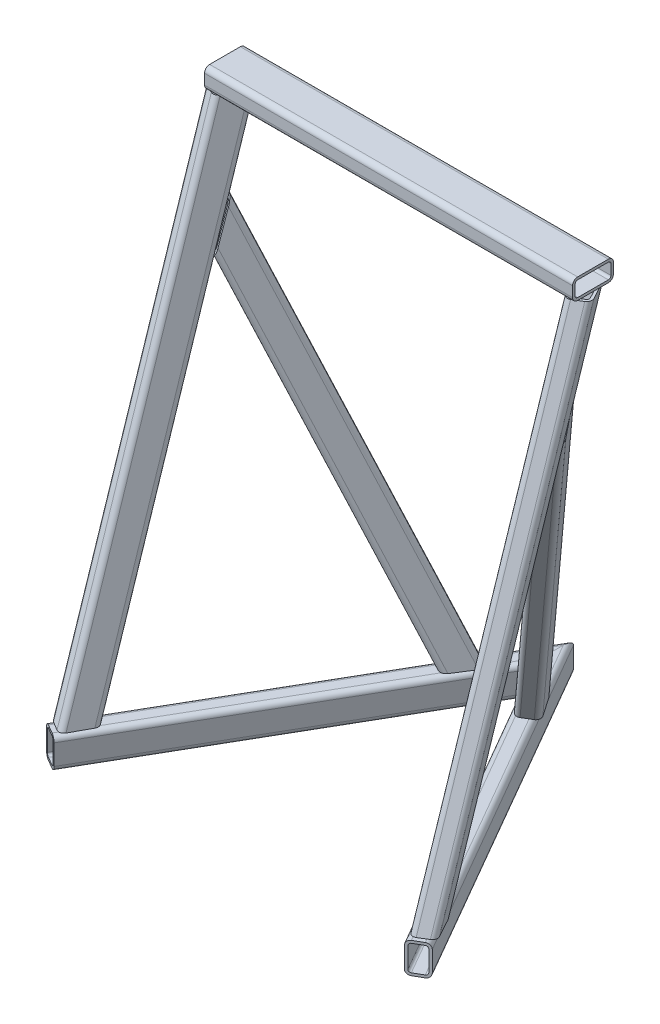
ISO-10303-21;
HEADER;
FILE_DESCRIPTION(('STEP AP214'),'2;1');
FILE_NAME('part.step','',(''),(''),'','','');
FILE_SCHEMA(('AUTOMOTIVE_DESIGN { 1 0 10303 214 1 1 1 1 }'));
ENDSEC;
DATA;
#1=APPLICATION_CONTEXT('core data for automotive mechanical design processes');
#2=APPLICATION_PROTOCOL_DEFINITION('international standard','automotive_design',2000,#1);
#3=PRODUCT_CONTEXT('',#1,'mechanical');
#4=PRODUCT('Part','Part','',(#3));
#5=PRODUCT_RELATED_PRODUCT_CATEGORY('part','',(#4));
#6=PRODUCT_DEFINITION_FORMATION('','',#4);
#7=PRODUCT_DEFINITION_CONTEXT('part definition',#1,'design');
#8=PRODUCT_DEFINITION('design','',#6,#7);
#9=PRODUCT_DEFINITION_SHAPE('','',#8);
#10=(LENGTH_UNIT() NAMED_UNIT(*) SI_UNIT(.MILLI.,.METRE.));
#11=(NAMED_UNIT(*) PLANE_ANGLE_UNIT() SI_UNIT($,.RADIAN.));
#12=(NAMED_UNIT(*) SI_UNIT($,.STERADIAN.) SOLID_ANGLE_UNIT());
#13=UNCERTAINTY_MEASURE_WITH_UNIT(LENGTH_MEASURE(1.E-05),#10,'distance_accuracy_value','');
#14=(GEOMETRIC_REPRESENTATION_CONTEXT(3) GLOBAL_UNCERTAINTY_ASSIGNED_CONTEXT((#13)) GLOBAL_UNIT_ASSIGNED_CONTEXT((#10,
#11,#12)) REPRESENTATION_CONTEXT('',''));
#15=CARTESIAN_POINT('',(0.,0.,0.));
#16=DIRECTION('',(0.,0.,1.));
#17=DIRECTION('',(1.,0.,0.));
#18=AXIS2_PLACEMENT_3D('',#15,#16,#17);
#19=CARTESIAN_POINT('',(77.8105998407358,-8.41079957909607,159.058346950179));
#20=DIRECTION('',(0.322473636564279,0.909233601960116,0.263258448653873));
#21=DIRECTION('',(-0.942479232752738,0.334264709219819,0.));
#22=AXIS2_PLACEMENT_3D('',#19,#20,#21);
#23=CYLINDRICAL_SURFACE('',#22,6.34999999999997);
#24=CARTESIAN_POINT('',(94.3063679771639,38.0999999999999,172.525030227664));
#25=DIRECTION('',(0.,1.,0.));
#26=DIRECTION('',(0.774643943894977,0.,0.632397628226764));
#27=AXIS2_PLACEMENT_3D('',#24,#25,#26);
#28=ELLIPSE('',#27,6.98390379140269,6.34999999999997);
#29=CARTESIAN_POINT('',(88.8099235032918,38.1,175.830436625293));
#30=VERTEX_POINT('',#29);
#31=CARTESIAN_POINT('',(98.202990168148,38.1,178.250162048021));
#32=VERTEX_POINT('',#31);
#33=EDGE_CURVE('E13',#30,#32,#28,.T.);
#34=ORIENTED_EDGE('',*,*,#33,.F.);
#35=DIRECTION('',(0.322473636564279,0.909233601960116,0.263258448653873));
#36=VECTOR('',#35,1.);
#37=CARTESIAN_POINT('',(72.6051176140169,-7.59041421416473,162.601286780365));
#38=LINE('',#37,#36);
#39=CARTESIAN_POINT('',(402.951261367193,923.840190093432,432.286629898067));
#40=VERTEX_POINT('',#39);
#41=EDGE_CURVE('E221',#30,#40,#38,.T.);
#42=ORIENTED_EDGE('',*,*,#41,.T.);
#43=CARTESIAN_POINT('',(408.434401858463,923.802678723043,428.970362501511));
#44=DIRECTION('',(-0.500000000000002,-0.267497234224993,-0.823677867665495));
#45=DIRECTION('',(0.0150928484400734,0.948265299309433,-0.317120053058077));
#46=AXIS2_PLACEMENT_3D('',#43,#44,#45);
#47=ELLIPSE('',#46,10.2205966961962,6.34999999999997);
#48=CARTESIAN_POINT('',(408.872186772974,914.050281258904,431.871796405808));
#49=VERTEX_POINT('',#48);
#50=EDGE_CURVE('E196',#49,#40,#47,.T.);
#51=ORIENTED_EDGE('',*,*,#50,.F.);
#52=DIRECTION('',(0.322473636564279,0.909233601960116,0.263258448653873));
#53=VECTOR('',#52,1.);
#54=CARTESIAN_POINT('',(80.8159864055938,-10.923691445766,164.055898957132));
#55=LINE('',#54,#53);
#56=EDGE_CURVE('E184',#32,#49,#55,.T.);
#57=ORIENTED_EDGE('',*,*,#56,.F.);
#58=EDGE_LOOP('',(#34,#42,#51,#57));
#59=FACE_BOUND('',#58,.T.);
#60=ADVANCED_FACE('F57',(#59),#23,.F.);
#61=CARTESIAN_POINT('',(101.637879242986,-14.2052272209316,149.884164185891));
#62=DIRECTION('',(-0.473289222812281,0.395731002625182,-0.787016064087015));
#63=DIRECTION('',(-0.85697386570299,0.,0.515359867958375));
#64=AXIS2_PLACEMENT_3D('',#61,#62,#63);
#65=PLANE('',#64);
#66=DIRECTION('',(0.85697386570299,0.,-0.515359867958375));
#67=VECTOR('',#66,1.);
#68=CARTESIAN_POINT('',(113.25342835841,38.1,169.199253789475));
#69=LINE('',#68,#67);
#70=CARTESIAN_POINT('',(120.188729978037,38.0999999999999,165.028559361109));
#71=VERTEX_POINT('',#70);
#72=EDGE_CURVE('E276',#32,#71,#69,.T.);
#73=ORIENTED_EDGE('',*,*,#72,.F.);
#74=ORIENTED_EDGE('',*,*,#56,.T.);
#75=DIRECTION('',(-0.855656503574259,0.00585373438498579,0.517511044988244));
#76=VECTOR('',#75,1.);
#77=CARTESIAN_POINT('',(313.448040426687,914.703098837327,489.5854343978));
#78=LINE('',#77,#76);
#79=CARTESIAN_POINT('',(430.804710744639,913.900236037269,418.606749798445));
#80=VERTEX_POINT('',#79);
#81=EDGE_CURVE('E235',#80,#49,#78,.T.);
#82=ORIENTED_EDGE('',*,*,#81,.F.);
#83=DIRECTION('',(0.322473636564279,0.909233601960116,0.263258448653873));
#84=VECTOR('',#83,1.);
#85=CARTESIAN_POINT('',(101.637879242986,-14.2052272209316,149.884164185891));
#86=LINE('',#85,#84);
#87=EDGE_CURVE('E209',#71,#80,#86,.T.);
#88=ORIENTED_EDGE('',*,*,#87,.F.);
#89=EDGE_LOOP('',(#73,#74,#82,#88));
#90=FACE_BOUND('',#89,.T.);
#91=ADVANCED_FACE('F324',(#90),#65,.T.);
#92=CARTESIAN_POINT('',(98.6324926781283,-11.6923353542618,144.886612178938));
#93=DIRECTION('',(0.322473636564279,0.909233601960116,0.263258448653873));
#94=DIRECTION('',(-0.942479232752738,0.334264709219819,0.));
#95=AXIS2_PLACEMENT_3D('',#92,#93,#94);
#96=CYLINDRICAL_SURFACE('',#95,6.34999999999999);
#97=CARTESIAN_POINT('',(116.292107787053,38.1,159.303427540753));
#98=DIRECTION('',(0.,1.,0.));
#99=DIRECTION('',(0.774643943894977,0.,0.632397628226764));
#100=AXIS2_PLACEMENT_3D('',#97,#98,#99);
#101=ELLIPSE('',#100,6.98390379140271,6.34999999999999);
#102=CARTESIAN_POINT('',(121.788552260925,38.1,155.998021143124));
#103=VERTEX_POINT('',#102);
#104=EDGE_CURVE('E274',#71,#103,#101,.T.);
#105=ORIENTED_EDGE('',*,*,#104,.F.);
#106=ORIENTED_EDGE('',*,*,#87,.T.);
#107=CARTESIAN_POINT('',(430.366925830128,923.652633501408,415.705315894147));
#108=DIRECTION('',(-0.500000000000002,-0.267497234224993,-0.823677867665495));
#109=DIRECTION('',(0.0150928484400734,0.948265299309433,-0.317120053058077));
#110=AXIS2_PLACEMENT_3D('',#107,#108,#109);
#111=ELLIPSE('',#110,10.2205966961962,6.34999999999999);
#112=CARTESIAN_POINT('',(435.850066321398,923.615122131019,412.389048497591));
#113=VERTEX_POINT('',#112);
#114=EDGE_CURVE('E238',#113,#80,#111,.T.);
#115=ORIENTED_EDGE('',*,*,#114,.F.);
#116=DIRECTION('',(0.322473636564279,0.909233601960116,0.263258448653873));
#117=VECTOR('',#116,1.);
#118=CARTESIAN_POINT('',(103.837974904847,-12.5127207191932,141.343672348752));
#119=LINE('',#118,#117);
#120=EDGE_CURVE('E211',#103,#113,#119,.T.);
#121=ORIENTED_EDGE('',*,*,#120,.F.);
#122=EDGE_LOOP('',(#105,#106,#115,#121));
#123=FACE_BOUND('',#122,.T.);
#124=ADVANCED_FACE('F329',(#123),#96,.F.);
#125=CARTESIAN_POINT('',(103.837974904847,-12.5127207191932,141.343672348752));
#126=DIRECTION('',(-0.819760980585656,0.129194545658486,0.557943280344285));
#127=DIRECTION('',(0.562658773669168,0.,0.826689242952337));
#128=AXIS2_PLACEMENT_3D('',#125,#126,#127);
#129=PLANE('',#128);
#130=DIRECTION('',(-0.562658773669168,0.,-0.826689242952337));
#131=VECTOR('',#130,1.);
#132=CARTESIAN_POINT('',(109.28928883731,38.0999999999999,137.633415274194));
#133=LINE('',#132,#131);
#134=CARTESIAN_POINT('',(90.6155747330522,38.0999999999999,110.196966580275));
#135=VERTEX_POINT('',#134);
#136=EDGE_CURVE('E272',#103,#135,#133,.T.);
#137=ORIENTED_EDGE('',*,*,#136,.F.);
#138=ORIENTED_EDGE('',*,*,#120,.T.);
#139=DIRECTION('',(0.0429864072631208,-0.957594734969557,0.284893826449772));
#140=VECTOR('',#139,1.);
#141=CARTESIAN_POINT('',(470.451542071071,152.808881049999,641.711465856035));
#142=LINE('',#141,#140);
#143=CARTESIAN_POINT('',(432.347787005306,1001.63430184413,389.17757726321));
#144=VERTEX_POINT('',#143);
#145=EDGE_CURVE('E241',#144,#113,#142,.T.);
#146=ORIENTED_EDGE('',*,*,#145,.F.);
#147=DIRECTION('',(0.322473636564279,0.909233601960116,0.263258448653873));
#148=VECTOR('',#147,1.);
#149=CARTESIAN_POINT('',(79.7948823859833,7.59041421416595,101.363256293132));
#150=LINE('',#149,#148);
#151=EDGE_CURVE('E213',#135,#144,#150,.T.);
#152=ORIENTED_EDGE('',*,*,#151,.F.);
#153=EDGE_LOOP('',(#137,#138,#146,#152));
#154=FACE_BOUND('',#153,.T.);
#155=ADVANCED_FACE('F347',(#154),#129,.T.);
#156=CARTESIAN_POINT('',(74.5894001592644,8.41079957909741,104.906196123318));
#157=DIRECTION('',(0.322473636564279,0.909233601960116,0.263258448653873));
#158=DIRECTION('',(-0.942479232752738,0.334264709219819,0.));
#159=AXIS2_PLACEMENT_3D('',#156,#157,#158);
#160=CYLINDRICAL_SURFACE('',#159,6.34999999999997);
#161=CARTESIAN_POINT('',(85.1191302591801,38.1,113.502372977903));
#162=DIRECTION('',(0.,1.,0.));
#163=DIRECTION('',(0.774643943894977,0.,0.632397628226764));
#164=AXIS2_PLACEMENT_3D('',#161,#162,#163);
#165=ELLIPSE('',#164,6.98390379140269,6.34999999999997);
#166=CARTESIAN_POINT('',(81.2225080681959,38.1,107.777241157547));
#167=VERTEX_POINT('',#166);
#168=EDGE_CURVE('E111',#135,#167,#165,.T.);
#169=ORIENTED_EDGE('',*,*,#168,.F.);
#170=ORIENTED_EDGE('',*,*,#151,.T.);
#171=CARTESIAN_POINT('',(426.864646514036,1001.67181321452,392.493844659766));
#172=DIRECTION('',(-0.500000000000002,-0.267497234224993,-0.823677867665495));
#173=DIRECTION('',(0.0150928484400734,0.948265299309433,-0.317120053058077));
#174=AXIS2_PLACEMENT_3D('',#171,#172,#173);
#175=ELLIPSE('',#174,10.2205966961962,6.34999999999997);
#176=CARTESIAN_POINT('',(426.426861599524,1011.42421067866,389.592410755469));
#177=VERTEX_POINT('',#176);
#178=EDGE_CURVE('E244',#177,#144,#175,.T.);
#179=ORIENTED_EDGE('',*,*,#178,.F.);
#180=DIRECTION('',(0.322473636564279,0.909233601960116,0.263258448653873));
#181=VECTOR('',#180,1.);
#182=CARTESIAN_POINT('',(71.5840135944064,10.9236914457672,99.9086441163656));
#183=LINE('',#182,#181);
#184=EDGE_CURVE('E215',#167,#177,#183,.T.);
#185=ORIENTED_EDGE('',*,*,#184,.F.);
#186=EDGE_LOOP('',(#169,#170,#179,#185));
#187=FACE_BOUND('',#186,.T.);
#188=ADVANCED_FACE('F350',(#187),#160,.F.);
#189=CARTESIAN_POINT('',(50.7621207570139,14.205227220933,114.080378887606));
#190=DIRECTION('',(0.473289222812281,-0.395731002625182,0.787016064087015));
#191=DIRECTION('',(0.85697386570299,0.,-0.515359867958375));
#192=AXIS2_PLACEMENT_3D('',#189,#190,#191);
#193=PLANE('',#192);
#194=DIRECTION('',(-0.85697386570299,0.,0.515359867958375));
#195=VECTOR('',#194,1.);
#196=CARTESIAN_POINT('',(56.0684911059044,38.1,122.904156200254));
#197=LINE('',#196,#195);
#198=CARTESIAN_POINT('',(59.2367682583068,38.1,120.998843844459));
#199=VERTEX_POINT('',#198);
#200=EDGE_CURVE('E114',#167,#199,#197,.T.);
#201=ORIENTED_EDGE('',*,*,#200,.F.);
#202=ORIENTED_EDGE('',*,*,#184,.T.);
#203=DIRECTION('',(0.855656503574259,-0.00585373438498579,-0.517511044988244));
#204=VECTOR('',#203,1.);
#205=CARTESIAN_POINT('',(278.379458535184,1012.43703553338,479.133208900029));
#206=LINE('',#205,#204);
#207=CARTESIAN_POINT('',(404.494337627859,1011.57425590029,402.857457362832));
#208=VERTEX_POINT('',#207);
#209=EDGE_CURVE('E203',#208,#177,#206,.T.);
#210=ORIENTED_EDGE('',*,*,#209,.F.);
#211=DIRECTION('',(0.322473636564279,0.909233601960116,0.263258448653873));
#212=VECTOR('',#211,1.);
#213=CARTESIAN_POINT('',(50.7621207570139,14.205227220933,114.080378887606));
#214=LINE('',#213,#212);
#215=EDGE_CURVE('E217',#199,#208,#214,.T.);
#216=ORIENTED_EDGE('',*,*,#215,.F.);
#217=EDGE_LOOP('',(#201,#202,#210,#216));
#218=FACE_BOUND('',#217,.T.);
#219=ADVANCED_FACE('F353',(#218),#193,.T.);
#220=CARTESIAN_POINT('',(53.7675073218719,11.692335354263,119.077930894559));
#221=DIRECTION('',(0.322473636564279,0.909233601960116,0.263258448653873));
#222=DIRECTION('',(-0.942479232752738,0.334264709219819,0.));
#223=AXIS2_PLACEMENT_3D('',#220,#221,#222);
#224=CYLINDRICAL_SURFACE('',#223,6.34999999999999);
#225=CARTESIAN_POINT('',(63.133390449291,38.0999999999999,126.723975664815));
#226=DIRECTION('',(0.,1.,0.));
#227=DIRECTION('',(0.774643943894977,0.,0.632397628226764));
#228=AXIS2_PLACEMENT_3D('',#225,#226,#227);
#229=ELLIPSE('',#228,6.98390379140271,6.34999999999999);
#230=CARTESIAN_POINT('',(57.6369459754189,38.1,130.029382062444));
#231=VERTEX_POINT('',#230);
#232=EDGE_CURVE('E118',#199,#231,#229,.T.);
#233=ORIENTED_EDGE('',*,*,#232,.F.);
#234=ORIENTED_EDGE('',*,*,#215,.T.);
#235=CARTESIAN_POINT('',(404.932122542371,1001.82185843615,405.75889126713));
#236=DIRECTION('',(-0.500000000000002,-0.267497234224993,-0.823677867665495));
#237=DIRECTION('',(0.0150928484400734,0.948265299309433,-0.317120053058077));
#238=AXIS2_PLACEMENT_3D('',#235,#236,#237);
#239=ELLIPSE('',#238,10.2205966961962,6.34999999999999);
#240=CARTESIAN_POINT('',(399.448982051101,1001.85936980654,409.075158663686));
#241=VERTEX_POINT('',#240);
#242=EDGE_CURVE('E200',#241,#208,#239,.T.);
#243=ORIENTED_EDGE('',*,*,#242,.F.);
#244=DIRECTION('',(0.322473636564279,0.909233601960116,0.263258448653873));
#245=VECTOR('',#244,1.);
#246=CARTESIAN_POINT('',(48.562025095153,12.5127207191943,122.620870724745));
#247=LINE('',#246,#245);
#248=EDGE_CURVE('E219',#231,#241,#247,.T.);
#249=ORIENTED_EDGE('',*,*,#248,.F.);
#250=EDGE_LOOP('',(#233,#234,#243,#249));
#251=FACE_BOUND('',#250,.T.);
#252=ADVANCED_FACE('F359',(#251),#224,.F.);
#253=CARTESIAN_POINT('',(48.562025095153,12.5127207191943,122.620870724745));
#254=DIRECTION('',(0.819760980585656,-0.129194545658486,-0.557943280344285));
#255=DIRECTION('',(-0.562658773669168,0.,-0.826689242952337));
#256=AXIS2_PLACEMENT_3D('',#253,#254,#255);
#257=PLANE('',#256);
#258=DIRECTION('',(0.562658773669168,0.,0.826689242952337));
#259=VECTOR('',#258,1.);
#260=CARTESIAN_POINT('',(51.3179388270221,38.0999999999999,120.745148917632));
#261=LINE('',#260,#259);
#262=EDGE_CURVE('E121',#231,#30,#261,.T.);
#263=ORIENTED_EDGE('',*,*,#262,.F.);
#264=ORIENTED_EDGE('',*,*,#248,.T.);
#265=DIRECTION('',(-0.0429864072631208,0.957594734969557,-0.284893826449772));
#266=VECTOR('',#265,1.);
#267=CARTESIAN_POINT('',(436.017549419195,187.232844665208,651.43454035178));
#268=LINE('',#267,#266);
#269=EDGE_CURVE('E249',#40,#241,#268,.T.);
#270=ORIENTED_EDGE('',*,*,#269,.F.);
#271=ORIENTED_EDGE('',*,*,#41,.F.);
#272=EDGE_LOOP('',(#263,#264,#270,#271));
#273=FACE_BOUND('',#272,.T.);
#274=ADVANCED_FACE('F361',(#273),#257,.T.);
#275=CARTESIAN_POINT('',(421.985993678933,626.173956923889,517.401855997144));
#276=DIRECTION('',(-0.500000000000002,-0.267497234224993,-0.823677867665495));
#277=DIRECTION('',(-0.854829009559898,0.,0.518909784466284));
#278=AXIS2_PLACEMENT_3D('',#275,#276,#277);
#279=PLANE('',#278);
#280=ORIENTED_EDGE('',*,*,#50,.T.);
#281=ORIENTED_EDGE('',*,*,#269,.T.);
#282=ORIENTED_EDGE('',*,*,#242,.T.);
#283=ORIENTED_EDGE('',*,*,#209,.T.);
#284=ORIENTED_EDGE('',*,*,#178,.T.);
#285=ORIENTED_EDGE('',*,*,#145,.T.);
#286=ORIENTED_EDGE('',*,*,#114,.T.);
#287=ORIENTED_EDGE('',*,*,#81,.T.);
#288=EDGE_LOOP('',(#280,#281,#282,#283,#284,#285,#286,#287));
#289=FACE_BOUND('',#288,.T.);
#290=DIRECTION('',(0.0429864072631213,-0.957594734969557,0.284893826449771));
#291=VECTOR('',#290,1.);
#292=CARTESIAN_POINT('',(475.96361941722,152.126752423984,638.586978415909));
#293=LINE('',#292,#291);
#294=CARTESIAN_POINT('',(437.830927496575,1001.59679047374,385.861309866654));
#295=VERTEX_POINT('',#294);
#296=CARTESIAN_POINT('',(441.333206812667,923.577610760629,409.072781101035));
#297=VERTEX_POINT('',#296);
#298=EDGE_CURVE('E191',#295,#297,#293,.T.);
#299=ORIENTED_EDGE('',*,*,#298,.F.);
#300=CARTESIAN_POINT('',(426.864646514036,1001.67181321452,392.493844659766));
#301=DIRECTION('',(-0.500000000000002,-0.267497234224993,-0.823677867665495));
#302=DIRECTION('',(0.0150928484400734,0.948265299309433,-0.317120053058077));
#303=AXIS2_PLACEMENT_3D('',#300,#301,#302);
#304=ELLIPSE('',#303,20.4411933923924,12.7);
#305=CARTESIAN_POINT('',(425.989076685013,1021.1766081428,386.690976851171));
#306=VERTEX_POINT('',#305);
#307=EDGE_CURVE('E251',#306,#295,#304,.T.);
#308=ORIENTED_EDGE('',*,*,#307,.F.);
#309=DIRECTION('',(0.855656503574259,-0.00585373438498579,-0.517511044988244));
#310=VECTOR('',#309,1.);
#311=CARTESIAN_POINT('',(277.026255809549,1022.19569557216,476.785430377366));
#312=LINE('',#311,#310);
#313=CARTESIAN_POINT('',(404.056552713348,1021.32665336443,399.956023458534));
#314=VERTEX_POINT('',#313);
#315=EDGE_CURVE('E263',#314,#306,#312,.T.);
#316=ORIENTED_EDGE('',*,*,#315,.F.);
#317=CARTESIAN_POINT('',(404.932122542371,1001.82185843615,405.75889126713));
#318=DIRECTION('',(-0.500000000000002,-0.267497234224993,-0.823677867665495));
#319=DIRECTION('',(0.0150928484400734,0.948265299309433,-0.317120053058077));
#320=AXIS2_PLACEMENT_3D('',#317,#318,#319);
#321=ELLIPSE('',#320,20.4411933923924,12.7);
#322=CARTESIAN_POINT('',(393.965841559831,1001.89688117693,412.391426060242));
#323=VERTEX_POINT('',#322);
#324=EDGE_CURVE('E260',#323,#314,#321,.T.);
#325=ORIENTED_EDGE('',*,*,#324,.F.);
#326=DIRECTION('',(-0.0429864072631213,0.957594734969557,-0.284893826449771));
#327=VECTOR('',#326,1.);
#328=CARTESIAN_POINT('',(430.505472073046,187.914973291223,654.559027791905));
#329=LINE('',#328,#327);
#330=CARTESIAN_POINT('',(397.468120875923,923.877701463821,435.602897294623));
#331=VERTEX_POINT('',#330);
#332=EDGE_CURVE('E257',#331,#323,#329,.T.);
#333=ORIENTED_EDGE('',*,*,#332,.F.);
#334=CARTESIAN_POINT('',(408.434401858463,923.802678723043,428.970362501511));
#335=DIRECTION('',(-0.500000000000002,-0.267497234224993,-0.823677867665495));
#336=DIRECTION('',(0.0150928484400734,0.948265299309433,-0.317120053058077));
#337=AXIS2_PLACEMENT_3D('',#334,#335,#336);
#338=ELLIPSE('',#337,20.4411933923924,12.7);
#339=CARTESIAN_POINT('',(409.309971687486,904.297883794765,434.773230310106));
#340=VERTEX_POINT('',#339);
#341=EDGE_CURVE('E254',#340,#331,#338,.T.);
#342=ORIENTED_EDGE('',*,*,#341,.F.);
#343=DIRECTION('',(-0.855656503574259,0.00585373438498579,0.517511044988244));
#344=VECTOR('',#343,1.);
#345=CARTESIAN_POINT('',(314.801243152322,904.944438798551,491.933212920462));
#346=LINE('',#345,#344);
#347=CARTESIAN_POINT('',(431.242495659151,904.14783857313,421.508183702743));
#348=VERTEX_POINT('',#347);
#349=EDGE_CURVE('E195',#348,#340,#346,.T.);
#350=ORIENTED_EDGE('',*,*,#349,.F.);
#351=CARTESIAN_POINT('',(430.366925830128,923.652633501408,415.705315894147));
#352=DIRECTION('',(-0.500000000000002,-0.267497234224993,-0.823677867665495));
#353=DIRECTION('',(0.0150928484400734,0.948265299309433,-0.317120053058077));
#354=AXIS2_PLACEMENT_3D('',#351,#352,#353);
#355=ELLIPSE('',#354,20.4411933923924,12.7);
#356=EDGE_CURVE('E179',#297,#348,#355,.T.);
#357=ORIENTED_EDGE('',*,*,#356,.F.);
#358=EDGE_LOOP('',(#299,#308,#316,#325,#333,#342,#350,#357));
#359=FACE_BOUND('',#358,.T.);
#360=ADVANCED_FACE('F189',(#289,#359),#279,.F.);
#361=CARTESIAN_POINT('',(98.6324926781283,-11.6923353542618,144.886612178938));
#362=DIRECTION('',(0.322473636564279,0.909233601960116,0.263258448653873));
#363=DIRECTION('',(-0.942479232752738,0.334264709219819,0.));
#364=AXIS2_PLACEMENT_3D('',#361,#362,#363);
#365=CYLINDRICAL_SURFACE('',#364,12.7);
#366=DIRECTION('',(0.322473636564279,0.909233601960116,0.263258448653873));
#367=VECTOR('',#366,1.);
#368=CARTESIAN_POINT('',(104.643265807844,-16.7181190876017,154.881716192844));
#369=LINE('',#368,#367);
#370=CARTESIAN_POINT('',(124.085352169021,38.1,170.753691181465));
#371=VERTEX_POINT('',#370);
#372=EDGE_CURVE('E201',#371,#348,#369,.T.);
#373=ORIENTED_EDGE('',*,*,#372,.F.);
#374=CARTESIAN_POINT('',(116.292107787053,38.1,159.303427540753));
#375=DIRECTION('',(0.,1.,0.));
#376=DIRECTION('',(0.774643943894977,0.,0.632397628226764));
#377=AXIS2_PLACEMENT_3D('',#374,#375,#376);
#378=ELLIPSE('',#377,13.9678075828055,12.7);
#379=CARTESIAN_POINT('',(127.284996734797,38.0999999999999,152.692614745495));
#380=VERTEX_POINT('',#379);
#381=EDGE_CURVE('E60',#371,#380,#378,.T.);
#382=ORIENTED_EDGE('',*,*,#381,.T.);
#383=DIRECTION('',(0.322473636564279,0.909233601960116,0.263258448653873));
#384=VECTOR('',#383,1.);
#385=CARTESIAN_POINT('',(109.043457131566,-13.3331060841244,137.800732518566));
#386=LINE('',#385,#384);
#387=EDGE_CURVE('E175',#380,#297,#386,.T.);
#388=ORIENTED_EDGE('',*,*,#387,.T.);
#389=ORIENTED_EDGE('',*,*,#356,.T.);
#390=EDGE_LOOP('',(#373,#382,#388,#389));
#391=FACE_BOUND('',#390,.T.);
#392=ADVANCED_FACE('F178',(#391),#365,.T.);
#393=CARTESIAN_POINT('',(104.643265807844,-16.7181190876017,154.881716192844));
#394=DIRECTION('',(-0.473289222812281,0.395731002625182,-0.787016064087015));
#395=DIRECTION('',(-0.85697386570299,0.,0.515359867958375));
#396=AXIS2_PLACEMENT_3D('',#393,#394,#395);
#397=PLANE('',#396);
#398=DIRECTION('',(0.322473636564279,0.909233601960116,0.263258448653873));
#399=VECTOR('',#398,1.);
#400=CARTESIAN_POINT('',(83.8213729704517,-13.4365833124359,169.053450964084));
#401=LINE('',#400,#399);
#402=CARTESIAN_POINT('',(102.099612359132,38.0999999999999,183.975293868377));
#403=VERTEX_POINT('',#402);
#404=EDGE_CURVE('E205',#403,#340,#401,.T.);
#405=ORIENTED_EDGE('',*,*,#404,.F.);
#406=DIRECTION('',(0.85697386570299,0.,-0.515359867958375));
#407=VECTOR('',#406,1.);
#408=CARTESIAN_POINT('',(116.816858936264,38.1,175.124757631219));
#409=LINE('',#408,#407);
#410=EDGE_CURVE('E66',#403,#371,#409,.T.);
#411=ORIENTED_EDGE('',*,*,#410,.T.);
#412=ORIENTED_EDGE('',*,*,#372,.T.);
#413=ORIENTED_EDGE('',*,*,#349,.T.);
#414=EDGE_LOOP('',(#405,#411,#412,#413));
#415=FACE_BOUND('',#414,.T.);
#416=ADVANCED_FACE('F296',(#415),#397,.F.);
#417=CARTESIAN_POINT('',(77.8105998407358,-8.41079957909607,159.058346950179));
#418=DIRECTION('',(0.322473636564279,0.909233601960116,0.263258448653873));
#419=DIRECTION('',(-0.942479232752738,0.334264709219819,0.));
#420=AXIS2_PLACEMENT_3D('',#417,#418,#419);
#421=CYLINDRICAL_SURFACE('',#420,12.7);
#422=DIRECTION('',(0.322473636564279,0.909233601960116,0.263258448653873));
#423=VECTOR('',#422,1.);
#424=CARTESIAN_POINT('',(67.3996353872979,-6.77002884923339,166.144226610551));
#425=LINE('',#424,#423);
#426=CARTESIAN_POINT('',(83.3134790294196,38.1,179.135843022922));
#427=VERTEX_POINT('',#426);
#428=EDGE_CURVE('E224',#427,#331,#425,.T.);
#429=ORIENTED_EDGE('',*,*,#428,.F.);
#430=CARTESIAN_POINT('',(94.3063679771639,38.0999999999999,172.525030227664));
#431=DIRECTION('',(0.,1.,0.));
#432=DIRECTION('',(0.774643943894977,0.,0.632397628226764));
#433=AXIS2_PLACEMENT_3D('',#430,#431,#432);
#434=ELLIPSE('',#433,13.9678075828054,12.7);
#435=EDGE_CURVE('E291',#427,#403,#434,.T.);
#436=ORIENTED_EDGE('',*,*,#435,.T.);
#437=ORIENTED_EDGE('',*,*,#404,.T.);
#438=ORIENTED_EDGE('',*,*,#341,.T.);
#439=EDGE_LOOP('',(#429,#436,#437,#438));
#440=FACE_BOUND('',#439,.T.);
#441=ADVANCED_FACE('F301',(#440),#421,.T.);
#442=CARTESIAN_POINT('',(43.356542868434,13.3331060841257,126.163810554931));
#443=DIRECTION('',(0.819760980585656,-0.129194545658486,-0.557943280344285));
#444=DIRECTION('',(-0.562658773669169,0.,-0.826689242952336));
#445=AXIS2_PLACEMENT_3D('',#442,#443,#444);
#446=PLANE('',#445);
#447=DIRECTION('',(0.322473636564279,0.909233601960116,0.263258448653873));
#448=VECTOR('',#447,1.);
#449=CARTESIAN_POINT('',(43.3565428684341,13.3331060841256,126.163810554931));
#450=LINE('',#449,#448);
#451=CARTESIAN_POINT('',(52.1405015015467,38.1,133.334788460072));
#452=VERTEX_POINT('',#451);
#453=EDGE_CURVE('E226',#452,#323,#450,.T.);
#454=ORIENTED_EDGE('',*,*,#453,.F.);
#455=DIRECTION('',(0.562658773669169,0.,0.826689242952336));
#456=VECTOR('',#455,1.);
#457=CARTESIAN_POINT('',(46.0240958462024,38.1,124.348228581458));
#458=LINE('',#457,#456);
#459=EDGE_CURVE('E288',#452,#427,#458,.T.);
#460=ORIENTED_EDGE('',*,*,#459,.T.);
#461=ORIENTED_EDGE('',*,*,#428,.T.);
#462=ORIENTED_EDGE('',*,*,#332,.T.);
#463=EDGE_LOOP('',(#454,#460,#461,#462));
#464=FACE_BOUND('',#463,.T.);
#465=ADVANCED_FACE('F304',(#464),#446,.F.);
#466=CARTESIAN_POINT('',(53.7675073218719,11.692335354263,119.077930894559));
#467=DIRECTION('',(0.322473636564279,0.909233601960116,0.263258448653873));
#468=DIRECTION('',(-0.942479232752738,0.334264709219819,0.));
#469=AXIS2_PLACEMENT_3D('',#466,#467,#468);
#470=CYLINDRICAL_SURFACE('',#469,12.7);
#471=DIRECTION('',(0.322473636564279,0.909233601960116,0.263258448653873));
#472=VECTOR('',#471,1.);
#473=CARTESIAN_POINT('',(47.7567341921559,16.7181190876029,109.082826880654));
#474=LINE('',#473,#472);
#475=CARTESIAN_POINT('',(55.3401460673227,38.0999999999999,115.273712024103));
#476=VERTEX_POINT('',#475);
#477=EDGE_CURVE('E228',#476,#314,#474,.T.);
#478=ORIENTED_EDGE('',*,*,#477,.F.);
#479=CARTESIAN_POINT('',(63.133390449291,38.0999999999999,126.723975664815));
#480=DIRECTION('',(0.,1.,0.));
#481=DIRECTION('',(0.774643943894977,0.,0.632397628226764));
#482=AXIS2_PLACEMENT_3D('',#479,#480,#481);
#483=ELLIPSE('',#482,13.9678075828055,12.7);
#484=EDGE_CURVE('E285',#476,#452,#483,.T.);
#485=ORIENTED_EDGE('',*,*,#484,.T.);
#486=ORIENTED_EDGE('',*,*,#453,.T.);
#487=ORIENTED_EDGE('',*,*,#324,.T.);
#488=EDGE_LOOP('',(#478,#485,#486,#487));
#489=FACE_BOUND('',#488,.T.);
#490=ADVANCED_FACE('F308',(#489),#470,.T.);
#491=CARTESIAN_POINT('',(47.7567341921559,16.7181190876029,109.082826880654));
#492=DIRECTION('',(0.473289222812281,-0.395731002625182,0.787016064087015));
#493=DIRECTION('',(0.85697386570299,0.,-0.515359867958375));
#494=AXIS2_PLACEMENT_3D('',#491,#492,#493);
#495=PLANE('',#494);
#496=DIRECTION('',(0.322473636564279,0.909233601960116,0.263258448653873));
#497=VECTOR('',#496,1.);
#498=CARTESIAN_POINT('',(68.5786270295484,13.4365833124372,94.9110921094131));
#499=LINE('',#498,#497);
#500=CARTESIAN_POINT('',(77.3258858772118,38.0999999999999,102.052109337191));
#501=VERTEX_POINT('',#500);
#502=EDGE_CURVE('E230',#501,#306,#499,.T.);
#503=ORIENTED_EDGE('',*,*,#502,.F.);
#504=DIRECTION('',(-0.85697386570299,0.,0.515359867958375));
#505=VECTOR('',#504,1.);
#506=CARTESIAN_POINT('',(52.5050605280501,38.1,116.97865235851));
#507=LINE('',#506,#505);
#508=EDGE_CURVE('E282',#501,#476,#507,.T.);
#509=ORIENTED_EDGE('',*,*,#508,.T.);
#510=ORIENTED_EDGE('',*,*,#477,.T.);
#511=ORIENTED_EDGE('',*,*,#315,.T.);
#512=EDGE_LOOP('',(#503,#509,#510,#511));
#513=FACE_BOUND('',#512,.T.);
#514=ADVANCED_FACE('F311',(#513),#495,.F.);
#515=CARTESIAN_POINT('',(74.5894001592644,8.41079957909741,104.906196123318));
#516=DIRECTION('',(0.322473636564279,0.909233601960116,0.263258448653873));
#517=DIRECTION('',(-0.942479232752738,0.334264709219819,0.));
#518=AXIS2_PLACEMENT_3D('',#515,#516,#517);
#519=CYLINDRICAL_SURFACE('',#518,12.7);
#520=DIRECTION('',(0.322473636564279,0.909233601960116,0.263258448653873));
#521=VECTOR('',#520,1.);
#522=CARTESIAN_POINT('',(85.0003646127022,6.77002884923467,97.8203164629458));
#523=LINE('',#522,#521);
#524=CARTESIAN_POINT('',(96.1120192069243,38.0999999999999,106.891560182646));
#525=VERTEX_POINT('',#524);
#526=EDGE_CURVE('E183',#525,#295,#523,.T.);
#527=ORIENTED_EDGE('',*,*,#526,.F.);
#528=CARTESIAN_POINT('',(85.1191302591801,38.1,113.502372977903));
#529=DIRECTION('',(0.,1.,0.));
#530=DIRECTION('',(0.774643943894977,0.,0.632397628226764));
#531=AXIS2_PLACEMENT_3D('',#528,#529,#530);
#532=ELLIPSE('',#531,13.9678075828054,12.7);
#533=EDGE_CURVE('E279',#525,#501,#532,.T.);
#534=ORIENTED_EDGE('',*,*,#533,.T.);
#535=ORIENTED_EDGE('',*,*,#502,.T.);
#536=ORIENTED_EDGE('',*,*,#307,.T.);
#537=EDGE_LOOP('',(#527,#534,#535,#536));
#538=FACE_BOUND('',#537,.T.);
#539=ADVANCED_FACE('F314',(#538),#519,.T.);
#540=CARTESIAN_POINT('',(109.043457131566,-13.3331060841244,137.800732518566));
#541=DIRECTION('',(-0.819760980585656,0.129194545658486,0.557943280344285));
#542=DIRECTION('',(0.562658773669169,0.,0.826689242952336));
#543=AXIS2_PLACEMENT_3D('',#540,#541,#542);
#544=PLANE('',#543);
#545=ORIENTED_EDGE('',*,*,#387,.F.);
#546=DIRECTION('',(-0.562658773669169,0.,-0.826689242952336));
#547=VECTOR('',#546,1.);
#548=CARTESIAN_POINT('',(114.58313181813,38.1,134.030335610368));
#549=LINE('',#548,#547);
#550=EDGE_CURVE('E268',#380,#525,#549,.T.);
#551=ORIENTED_EDGE('',*,*,#550,.T.);
#552=ORIENTED_EDGE('',*,*,#526,.T.);
#553=ORIENTED_EDGE('',*,*,#298,.T.);
#554=EDGE_LOOP('',(#545,#551,#552,#553));
#555=FACE_BOUND('',#554,.T.);
#556=ADVANCED_FACE('F198',(#555),#544,.F.);
#557=CARTESIAN_POINT('',(7.35949522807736,38.1,-1.11022302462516E-13));
#558=DIRECTION('',(0.,1.,0.));
#559=DIRECTION('',(0.,0.,1.));
#560=AXIS2_PLACEMENT_3D('',#557,#558,#559);
#561=PLANE('',#560);
#562=ORIENTED_EDGE('',*,*,#262,.T.);
#563=ORIENTED_EDGE('',*,*,#33,.T.);
#564=ORIENTED_EDGE('',*,*,#72,.T.);
#565=ORIENTED_EDGE('',*,*,#104,.T.);
#566=ORIENTED_EDGE('',*,*,#136,.T.);
#567=ORIENTED_EDGE('',*,*,#168,.T.);
#568=ORIENTED_EDGE('',*,*,#200,.T.);
#569=ORIENTED_EDGE('',*,*,#232,.T.);
#570=EDGE_LOOP('',(#562,#563,#564,#565,#566,#567,#568,#569));
#571=FACE_BOUND('',#570,.T.);
#572=ORIENTED_EDGE('',*,*,#381,.F.);
#573=ORIENTED_EDGE('',*,*,#410,.F.);
#574=ORIENTED_EDGE('',*,*,#435,.F.);
#575=ORIENTED_EDGE('',*,*,#459,.F.);
#576=ORIENTED_EDGE('',*,*,#484,.F.);
#577=ORIENTED_EDGE('',*,*,#508,.F.);
#578=ORIENTED_EDGE('',*,*,#533,.F.);
#579=ORIENTED_EDGE('',*,*,#550,.F.);
#580=EDGE_LOOP('',(#572,#573,#574,#575,#576,#577,#578,#579));
#581=FACE_BOUND('',#580,.T.);
#582=ADVANCED_FACE('F297',(#571,#581),#561,.F.);
#583=CLOSED_SHELL('',(#60,#91,#124,#155,#188,#219,#252,#274,#360,#392,#416,#441,#465,#490,#514,
#539,#556,#582));
#584=MANIFOLD_SOLID_BREP('B2',#583);
#585=CARTESIAN_POINT('',(-54.2080339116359,11.7381428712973,118.38010734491));
#586=DIRECTION('',(-0.322473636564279,0.909233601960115,0.263258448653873));
#587=DIRECTION('',(-0.942479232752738,-0.334264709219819,0.));
#588=AXIS2_PLACEMENT_3D('',#585,#586,#587);
#589=CYLINDRICAL_SURFACE('',#588,6.34999999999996);
#590=CARTESIAN_POINT('',(-63.5576707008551,38.1,126.012889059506));
#591=DIRECTION('',(0.,1.,0.));
#592=DIRECTION('',(-0.774643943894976,0.,0.632397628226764));
#593=AXIS2_PLACEMENT_3D('',#590,#591,#592);
#594=ELLIPSE('',#593,6.98390379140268,6.34999999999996);
#595=CARTESIAN_POINT('',(-57.9501570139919,38.1,129.150286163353));
#596=VERTEX_POINT('',#595);
#597=CARTESIAN_POINT('',(-59.822653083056,38.1,120.193990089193));
#598=VERTEX_POINT('',#597);
#599=EDGE_CURVE('E55',#596,#598,#594,.T.);
#600=ORIENTED_EDGE('',*,*,#599,.F.);
#601=DIRECTION('',(-0.322473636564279,0.909233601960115,0.263258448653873));
#602=VECTOR('',#601,1.);
#603=CARTESIAN_POINT('',(-48.9172954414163,12.6313094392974,121.776110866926));
#604=LINE('',#603,#602);
#605=CARTESIAN_POINT('',(-400.056738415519,1002.689857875,408.436521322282));
#606=VERTEX_POINT('',#605);
#607=EDGE_CURVE('E686',#596,#606,#604,.T.);
#608=ORIENTED_EDGE('',*,*,#607,.T.);
#609=CARTESIAN_POINT('',(-405.550296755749,1002.36855399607,405.20609426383));
#610=DIRECTION('',(0.499999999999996,-0.267497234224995,-0.823677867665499));
#611=DIRECTION('',(-0.0150928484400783,0.948265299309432,-0.317120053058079));
#612=AXIS2_PLACEMENT_3D('',#609,#610,#611);
#613=ELLIPSE('',#612,10.2205966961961,6.34999999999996);
#614=CARTESIAN_POINT('',(-405.272264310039,1012.11572934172,402.209381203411));
#615=VERTEX_POINT('',#614);
#616=EDGE_CURVE('E661',#615,#606,#613,.T.);
#617=ORIENTED_EDGE('',*,*,#616,.F.);
#618=DIRECTION('',(-0.322473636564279,0.909233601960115,0.263258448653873));
#619=VECTOR('',#618,1.);
#620=CARTESIAN_POINT('',(-51.3554070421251,14.2260960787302,113.281567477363));
#621=LINE('',#620,#619);
#622=EDGE_CURVE('E649',#598,#615,#621,.T.);
#623=ORIENTED_EDGE('',*,*,#622,.F.);
#624=EDGE_LOOP('',(#600,#608,#617,#623));
#625=FACE_BOUND('',#624,.T.);
#626=ADVANCED_FACE('F522',(#625),#589,.F.);
#627=CARTESIAN_POINT('',(-72.5183242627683,10.6534359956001,99.6975769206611));
#628=DIRECTION('',(-0.4492325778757,-0.391803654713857,0.802919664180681));
#629=DIRECTION('',(0.87269242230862,0.,0.488270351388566));
#630=AXIS2_PLACEMENT_3D('',#627,#628,#629);
#631=PLANE('',#630);
#632=DIRECTION('',(-0.87269242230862,0.,-0.488270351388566));
#633=VECTOR('',#632,1.);
#634=CARTESIAN_POINT('',(-78.2252987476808,38.0999999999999,109.897732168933));
#635=LINE('',#634,#633);
#636=CARTESIAN_POINT('',(-82.2526689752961,38.1000000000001,107.644423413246));
#637=VERTEX_POINT('',#636);
#638=EDGE_CURVE('E741',#598,#637,#635,.T.);
#639=ORIENTED_EDGE('',*,*,#638,.F.);
#640=ORIENTED_EDGE('',*,*,#622,.T.);
#641=DIRECTION('',(0.860914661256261,0.050352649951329,0.506251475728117));
#642=VECTOR('',#641,1.);
#643=CARTESIAN_POINT('',(-333.902939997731,1016.28993471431,444.177333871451));
#644=LINE('',#643,#642);
#645=CARTESIAN_POINT('',(-427.246459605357,1010.83051605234,389.287695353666));
#646=VERTEX_POINT('',#645);
#647=EDGE_CURVE('E700',#646,#615,#644,.T.);
#648=ORIENTED_EDGE('',*,*,#647,.F.);
#649=DIRECTION('',(-0.322473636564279,0.909233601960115,0.263258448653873));
#650=VECTOR('',#649,1.);
#651=CARTESIAN_POINT('',(-72.5183242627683,10.6534359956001,99.6975769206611));
#652=LINE('',#651,#650);
#653=EDGE_CURVE('E674',#637,#646,#652,.T.);
#654=ORIENTED_EDGE('',*,*,#653,.F.);
#655=EDGE_LOOP('',(#639,#640,#648,#654));
#656=FACE_BOUND('',#655,.T.);
#657=ADVANCED_FACE('F789',(#656),#631,.T.);
#658=CARTESIAN_POINT('',(-75.3709511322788,8.1654827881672,104.796116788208));
#659=DIRECTION('',(-0.322473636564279,0.909233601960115,0.263258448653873));
#660=DIRECTION('',(-0.942479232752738,-0.334264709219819,0.));
#661=AXIS2_PLACEMENT_3D('',#658,#659,#660);
#662=CYLINDRICAL_SURFACE('',#661,6.35000000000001);
#663=CARTESIAN_POINT('',(-85.9876865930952,38.1000000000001,113.463322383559));
#664=DIRECTION('',(0.,1.,0.));
#665=DIRECTION('',(-0.774643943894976,0.,0.632397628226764));
#666=AXIS2_PLACEMENT_3D('',#663,#664,#665);
#667=ELLIPSE('',#666,6.98390379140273,6.35000000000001);
#668=CARTESIAN_POINT('',(-91.5952002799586,38.1000000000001,110.325925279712));
#669=VERTEX_POINT('',#668);
#670=EDGE_CURVE('E739',#637,#669,#667,.T.);
#671=ORIENTED_EDGE('',*,*,#670,.F.);
#672=ORIENTED_EDGE('',*,*,#653,.T.);
#673=CARTESIAN_POINT('',(-427.524492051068,1001.08334070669,392.284408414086));
#674=DIRECTION('',(0.499999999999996,-0.267497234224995,-0.823677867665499));
#675=DIRECTION('',(-0.0150928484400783,0.948265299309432,-0.317120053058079));
#676=AXIS2_PLACEMENT_3D('',#673,#674,#675);
#677=ELLIPSE('',#676,10.2205966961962,6.35000000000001);
#678=CARTESIAN_POINT('',(-433.018050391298,1000.76203682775,389.053981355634));
#679=VERTEX_POINT('',#678);
#680=EDGE_CURVE('E703',#679,#646,#677,.T.);
#681=ORIENTED_EDGE('',*,*,#680,.F.);
#682=DIRECTION('',(-0.322473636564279,0.909233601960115,0.263258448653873));
#683=VECTOR('',#682,1.);
#684=CARTESIAN_POINT('',(-80.6616896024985,7.27231622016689,101.400113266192));
#685=LINE('',#684,#683);
#686=EDGE_CURVE('E676',#669,#679,#685,.T.);
#687=ORIENTED_EDGE('',*,*,#686,.F.);
#688=EDGE_LOOP('',(#671,#672,#681,#687));
#689=FACE_BOUND('',#688,.T.);
#690=ADVANCED_FACE('F794',(#689),#662,.F.);
#691=CARTESIAN_POINT('',(-80.6616896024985,7.27231622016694,101.400113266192));
#692=DIRECTION('',(0.833187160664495,0.140656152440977,0.534803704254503));
#693=DIRECTION('',(0.540173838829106,0.,-0.841553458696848));
#694=AXIS2_PLACEMENT_3D('',#691,#692,#693);
#695=PLANE('',#694);
#696=DIRECTION('',(-0.540173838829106,0.,0.841553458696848));
#697=VECTOR('',#696,1.);
#698=CARTESIAN_POINT('',(-84.3473938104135,38.1,99.0343443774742));
#699=LINE('',#698,#697);
#700=CARTESIAN_POINT('',(-121.475341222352,38.1,156.877117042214));
#701=VERTEX_POINT('',#700);
#702=EDGE_CURVE('E737',#669,#701,#699,.T.);
#703=ORIENTED_EDGE('',*,*,#702,.F.);
#704=ORIENTED_EDGE('',*,*,#686,.T.);
#705=DIRECTION('',(0.0272548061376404,0.955490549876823,-0.293760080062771));
#706=VECTOR('',#705,1.);
#707=CARTESIAN_POINT('',(-456.32541790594,183.659567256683,640.267441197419));
#708=LINE('',#707,#706);
#709=CARTESIAN_POINT('',(-435.242309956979,922.78463406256,413.027685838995));
#710=VERTEX_POINT('',#709);
#711=EDGE_CURVE('E706',#710,#679,#708,.T.);
#712=ORIENTED_EDGE('',*,*,#711,.F.);
#713=DIRECTION('',(-0.322473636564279,0.909233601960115,0.263258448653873));
#714=VECTOR('',#713,1.);
#715=CARTESIAN_POINT('',(-103.482704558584,-12.6313094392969,142.188432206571));
#716=LINE('',#715,#714);
#717=EDGE_CURVE('E678',#701,#710,#716,.T.);
#718=ORIENTED_EDGE('',*,*,#717,.F.);
#719=EDGE_LOOP('',(#703,#704,#712,#718));
#720=FACE_BOUND('',#719,.T.);
#721=ADVANCED_FACE('F812',(#720),#695,.T.);
#722=CARTESIAN_POINT('',(-98.1919660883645,-11.7381428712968,145.584435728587));
#723=DIRECTION('',(-0.322473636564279,0.909233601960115,0.263258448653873));
#724=DIRECTION('',(-0.942479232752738,-0.334264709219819,0.));
#725=AXIS2_PLACEMENT_3D('',#722,#723,#724);
#726=CYLINDRICAL_SURFACE('',#725,6.34999999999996);
#727=CARTESIAN_POINT('',(-115.867827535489,38.1,160.014514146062));
#728=DIRECTION('',(0.,1.,0.));
#729=DIRECTION('',(-0.774643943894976,0.,0.632397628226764));
#730=AXIS2_PLACEMENT_3D('',#727,#728,#729);
#731=ELLIPSE('',#730,6.98390379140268,6.34999999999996);
#732=CARTESIAN_POINT('',(-119.602845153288,38.1000000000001,165.833413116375));
#733=VERTEX_POINT('',#732);
#734=EDGE_CURVE('E576',#701,#733,#731,.T.);
#735=ORIENTED_EDGE('',*,*,#734,.F.);
#736=ORIENTED_EDGE('',*,*,#717,.T.);
#737=CARTESIAN_POINT('',(-429.74875161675,923.105937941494,416.258112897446));
#738=DIRECTION('',(0.499999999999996,-0.267497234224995,-0.823677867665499));
#739=DIRECTION('',(-0.0150928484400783,0.948265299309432,-0.317120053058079));
#740=AXIS2_PLACEMENT_3D('',#737,#738,#739);
#741=ELLIPSE('',#740,10.2205966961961,6.34999999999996);
#742=CARTESIAN_POINT('',(-430.02678406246,913.358762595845,419.254825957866));
#743=VERTEX_POINT('',#742);
#744=EDGE_CURVE('E709',#743,#710,#741,.T.);
#745=ORIENTED_EDGE('',*,*,#744,.F.);
#746=DIRECTION('',(-0.322473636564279,0.909233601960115,0.263258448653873));
#747=VECTOR('',#746,1.);
#748=CARTESIAN_POINT('',(-101.044592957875,-14.2260960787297,150.682975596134));
#749=LINE('',#748,#747);
#750=EDGE_CURVE('E680',#733,#743,#749,.T.);
#751=ORIENTED_EDGE('',*,*,#750,.F.);
#752=EDGE_LOOP('',(#735,#736,#745,#751));
#753=FACE_BOUND('',#752,.T.);
#754=ADVANCED_FACE('F815',(#753),#726,.F.);
#755=CARTESIAN_POINT('',(-79.881675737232,-10.6534359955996,164.266966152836));
#756=DIRECTION('',(0.4492325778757,0.391803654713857,-0.802919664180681));
#757=DIRECTION('',(-0.87269242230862,0.,-0.488270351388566));
#758=AXIS2_PLACEMENT_3D('',#755,#756,#757);
#759=PLANE('',#758);
#760=DIRECTION('',(0.87269242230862,0.,0.488270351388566));
#761=VECTOR('',#760,1.);
#762=CARTESIAN_POINT('',(-90.0189962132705,38.1,182.385540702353));
#763=LINE('',#762,#761);
#764=CARTESIAN_POINT('',(-97.1728292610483,38.1,178.382979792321));
#765=VERTEX_POINT('',#764);
#766=EDGE_CURVE('E579',#733,#765,#763,.T.);
#767=ORIENTED_EDGE('',*,*,#766,.F.);
#768=ORIENTED_EDGE('',*,*,#750,.T.);
#769=DIRECTION('',(-0.860914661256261,-0.050352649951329,-0.506251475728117));
#770=VECTOR('',#769,1.);
#771=CARTESIAN_POINT('',(-321.697363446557,919.694667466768,482.956760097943));
#772=LINE('',#771,#770);
#773=CARTESIAN_POINT('',(-408.052588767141,914.643975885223,432.176511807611));
#774=VERTEX_POINT('',#773);
#775=EDGE_CURVE('E668',#774,#743,#772,.T.);
#776=ORIENTED_EDGE('',*,*,#775,.F.);
#777=DIRECTION('',(-0.322473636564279,0.909233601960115,0.263258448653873));
#778=VECTOR('',#777,1.);
#779=CARTESIAN_POINT('',(-79.881675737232,-10.6534359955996,164.266966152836));
#780=LINE('',#779,#778);
#781=EDGE_CURVE('E682',#765,#774,#780,.T.);
#782=ORIENTED_EDGE('',*,*,#781,.F.);
#783=EDGE_LOOP('',(#767,#768,#776,#782));
#784=FACE_BOUND('',#783,.T.);
#785=ADVANCED_FACE('F818',(#784),#759,.T.);
#786=CARTESIAN_POINT('',(-77.0290488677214,-8.16548278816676,159.168426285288));
#787=DIRECTION('',(-0.322473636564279,0.909233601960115,0.263258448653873));
#788=DIRECTION('',(-0.942479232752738,-0.334264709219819,0.));
#789=AXIS2_PLACEMENT_3D('',#786,#787,#788);
#790=CYLINDRICAL_SURFACE('',#789,6.35000000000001);
#791=CARTESIAN_POINT('',(-93.4378116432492,38.1000000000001,172.564080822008));
#792=DIRECTION('',(0.,1.,0.));
#793=DIRECTION('',(-0.774643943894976,0.,0.632397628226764));
#794=AXIS2_PLACEMENT_3D('',#791,#792,#793);
#795=ELLIPSE('',#794,6.98390379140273,6.35000000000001);
#796=CARTESIAN_POINT('',(-87.8302979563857,38.1,175.701477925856));
#797=VERTEX_POINT('',#796);
#798=EDGE_CURVE('E583',#765,#797,#795,.T.);
#799=ORIENTED_EDGE('',*,*,#798,.F.);
#800=ORIENTED_EDGE('',*,*,#781,.T.);
#801=CARTESIAN_POINT('',(-407.774556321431,924.391151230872,429.179798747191));
#802=DIRECTION('',(0.499999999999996,-0.267497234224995,-0.823677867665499));
#803=DIRECTION('',(-0.0150928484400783,0.948265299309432,-0.317120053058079));
#804=AXIS2_PLACEMENT_3D('',#801,#802,#803);
#805=ELLIPSE('',#804,10.2205966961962,6.35000000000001);
#806=CARTESIAN_POINT('',(-402.280997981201,924.712455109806,432.410225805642));
#807=VERTEX_POINT('',#806);
#808=EDGE_CURVE('E665',#807,#774,#805,.T.);
#809=ORIENTED_EDGE('',*,*,#808,.F.);
#810=DIRECTION('',(-0.322473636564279,0.909233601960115,0.263258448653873));
#811=VECTOR('',#810,1.);
#812=CARTESIAN_POINT('',(-71.7383103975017,-7.27231622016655,162.564429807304));
#813=LINE('',#812,#811);
#814=EDGE_CURVE('E684',#797,#807,#813,.T.);
#815=ORIENTED_EDGE('',*,*,#814,.F.);
#816=EDGE_LOOP('',(#799,#800,#809,#815));
#817=FACE_BOUND('',#816,.T.);
#818=ADVANCED_FACE('F824',(#817),#790,.F.);
#819=CARTESIAN_POINT('',(-71.7383103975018,-7.27231622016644,162.564429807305));
#820=DIRECTION('',(-0.833187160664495,-0.140656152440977,-0.534803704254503));
#821=DIRECTION('',(-0.540173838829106,0.,0.841553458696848));
#822=AXIS2_PLACEMENT_3D('',#819,#820,#821);
#823=PLANE('',#822);
#824=DIRECTION('',(0.540173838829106,0.,-0.841553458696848));
#825=VECTOR('',#824,1.);
#826=CARTESIAN_POINT('',(-77.1629455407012,38.0999999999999,159.082481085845));
#827=LINE('',#826,#825);
#828=EDGE_CURVE('E586',#797,#596,#827,.T.);
#829=ORIENTED_EDGE('',*,*,#828,.F.);
#830=ORIENTED_EDGE('',*,*,#814,.T.);
#831=DIRECTION('',(-0.0272548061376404,-0.955490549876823,0.293760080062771));
#832=VECTOR('',#831,1.);
#833=CARTESIAN_POINT('',(-424.14545327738,158.195155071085,668.071565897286));
#834=LINE('',#833,#832);
#835=EDGE_CURVE('E714',#606,#807,#834,.T.);
#836=ORIENTED_EDGE('',*,*,#835,.F.);
#837=ORIENTED_EDGE('',*,*,#607,.F.);
#838=EDGE_LOOP('',(#829,#830,#836,#837));
#839=FACE_BOUND('',#838,.T.);
#840=ADVANCED_FACE('F826',(#839),#823,.T.);
#841=CARTESIAN_POINT('',(-416.214006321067,631.126043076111,519.297408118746));
#842=DIRECTION('',(0.499999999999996,-0.267497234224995,-0.823677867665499));
#843=DIRECTION('',(-0.854829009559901,0.,-0.518909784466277));
#844=AXIS2_PLACEMENT_3D('',#841,#842,#843);
#845=PLANE('',#844);
#846=ORIENTED_EDGE('',*,*,#616,.T.);
#847=ORIENTED_EDGE('',*,*,#835,.T.);
#848=ORIENTED_EDGE('',*,*,#808,.T.);
#849=ORIENTED_EDGE('',*,*,#775,.T.);
#850=ORIENTED_EDGE('',*,*,#744,.T.);
#851=ORIENTED_EDGE('',*,*,#711,.T.);
#852=ORIENTED_EDGE('',*,*,#680,.T.);
#853=ORIENTED_EDGE('',*,*,#647,.T.);
#854=EDGE_LOOP('',(#846,#847,#848,#849,#850,#851,#852,#853));
#855=FACE_BOUND('',#854,.T.);
#856=DIRECTION('',(0.0272548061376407,0.955490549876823,-0.293760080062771));
#857=VECTOR('',#856,1.);
#858=CARTESIAN_POINT('',(-461.83239220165,182.867930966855,637.181615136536));
#859=LINE('',#858,#857);
#860=CARTESIAN_POINT('',(-440.735868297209,922.463330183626,409.797258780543));
#861=VERTEX_POINT('',#860);
#862=CARTESIAN_POINT('',(-438.511608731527,1000.44073294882,385.823554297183));
#863=VERTEX_POINT('',#862);
#864=EDGE_CURVE('E656',#861,#863,#859,.T.);
#865=ORIENTED_EDGE('',*,*,#864,.F.);
#866=CARTESIAN_POINT('',(-429.74875161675,923.105937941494,416.258112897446));
#867=DIRECTION('',(0.499999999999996,-0.267497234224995,-0.823677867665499));
#868=DIRECTION('',(-0.0150928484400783,0.948265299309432,-0.317120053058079));
#869=AXIS2_PLACEMENT_3D('',#866,#867,#868);
#870=ELLIPSE('',#869,20.4411933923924,12.7);
#871=CARTESIAN_POINT('',(-430.30481650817,903.611587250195,422.251539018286));
#872=VERTEX_POINT('',#871);
#873=EDGE_CURVE('E716',#872,#861,#870,.T.);
#874=ORIENTED_EDGE('',*,*,#873,.F.);
#875=DIRECTION('',(-0.860914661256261,-0.050352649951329,-0.506251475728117));
#876=VECTOR('',#875,1.);
#877=CARTESIAN_POINT('',(-322.652877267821,909.907868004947,485.555087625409));
#878=LINE('',#877,#876);
#879=CARTESIAN_POINT('',(-408.330621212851,904.896800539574,435.173224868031));
#880=VERTEX_POINT('',#879);
#881=EDGE_CURVE('E728',#880,#872,#878,.T.);
#882=ORIENTED_EDGE('',*,*,#881,.F.);
#883=CARTESIAN_POINT('',(-407.774556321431,924.391151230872,429.179798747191));
#884=DIRECTION('',(0.499999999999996,-0.267497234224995,-0.823677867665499));
#885=DIRECTION('',(-0.0150928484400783,0.948265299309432,-0.317120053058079));
#886=AXIS2_PLACEMENT_3D('',#883,#884,#885);
#887=ELLIPSE('',#886,20.4411933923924,12.7);
#888=CARTESIAN_POINT('',(-396.787439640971,925.03375898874,435.640652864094));
#889=VERTEX_POINT('',#888);
#890=EDGE_CURVE('E725',#889,#880,#887,.T.);
#891=ORIENTED_EDGE('',*,*,#890,.F.);
#892=DIRECTION('',(-0.0272548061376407,-0.955490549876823,0.293760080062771));
#893=VECTOR('',#892,1.);
#894=CARTESIAN_POINT('',(-418.638478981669,158.986791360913,671.157391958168));
#895=LINE('',#894,#893);
#896=CARTESIAN_POINT('',(-394.563180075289,1003.01116175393,411.666948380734));
#897=VERTEX_POINT('',#896);
#898=EDGE_CURVE('E722',#897,#889,#895,.T.);
#899=ORIENTED_EDGE('',*,*,#898,.F.);
#900=CARTESIAN_POINT('',(-405.550296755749,1002.36855399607,405.20609426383));
#901=DIRECTION('',(0.499999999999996,-0.267497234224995,-0.823677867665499));
#902=DIRECTION('',(-0.0150928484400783,0.948265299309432,-0.317120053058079));
#903=AXIS2_PLACEMENT_3D('',#900,#901,#902);
#904=ELLIPSE('',#903,20.4411933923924,12.7);
#905=CARTESIAN_POINT('',(-404.994231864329,1021.86290468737,399.21266814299));
#906=VERTEX_POINT('',#905);
#907=EDGE_CURVE('E719',#906,#897,#904,.T.);
#908=ORIENTED_EDGE('',*,*,#907,.F.);
#909=DIRECTION('',(0.860914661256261,0.050352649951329,0.506251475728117));
#910=VECTOR('',#909,1.);
#911=CARTESIAN_POINT('',(-332.947426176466,1026.07673417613,441.579006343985));
#912=LINE('',#911,#910);
#913=CARTESIAN_POINT('',(-426.968427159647,1020.57769139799,386.290982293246));
#914=VERTEX_POINT('',#913);
#915=EDGE_CURVE('E660',#914,#906,#912,.T.);
#916=ORIENTED_EDGE('',*,*,#915,.F.);
#917=CARTESIAN_POINT('',(-427.524492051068,1001.08334070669,392.284408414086));
#918=DIRECTION('',(0.499999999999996,-0.267497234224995,-0.823677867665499));
#919=DIRECTION('',(-0.0150928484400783,0.948265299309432,-0.317120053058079));
#920=AXIS2_PLACEMENT_3D('',#917,#918,#919);
#921=ELLIPSE('',#920,20.4411933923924,12.7);
#922=EDGE_CURVE('E644',#863,#914,#921,.T.);
#923=ORIENTED_EDGE('',*,*,#922,.F.);
#924=EDGE_LOOP('',(#865,#874,#882,#891,#899,#908,#916,#923));
#925=FACE_BOUND('',#924,.T.);
#926=ADVANCED_FACE('F654',(#855,#925),#845,.F.);
#927=CARTESIAN_POINT('',(-75.3709511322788,8.1654827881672,104.796116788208));
#928=DIRECTION('',(-0.322473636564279,0.909233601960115,0.263258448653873));
#929=DIRECTION('',(-0.942479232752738,-0.334264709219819,0.));
#930=AXIS2_PLACEMENT_3D('',#927,#928,#929);
#931=CYLINDRICAL_SURFACE('',#930,12.7);
#932=DIRECTION('',(-0.322473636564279,0.909233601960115,0.263258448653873));
#933=VECTOR('',#932,1.);
#934=CARTESIAN_POINT('',(-69.6656973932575,13.1413892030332,94.5990370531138));
#935=LINE('',#934,#933);
#936=CARTESIAN_POINT('',(-78.5176513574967,38.1,101.825524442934));
#937=VERTEX_POINT('',#936);
#938=EDGE_CURVE('E666',#937,#914,#935,.T.);
#939=ORIENTED_EDGE('',*,*,#938,.F.);
#940=CARTESIAN_POINT('',(-85.9876865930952,38.1000000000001,113.463322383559));
#941=DIRECTION('',(0.,1.,0.));
#942=DIRECTION('',(-0.774643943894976,0.,0.632397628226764));
#943=AXIS2_PLACEMENT_3D('',#940,#941,#942);
#944=ELLIPSE('',#943,13.9678075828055,12.7);
#945=CARTESIAN_POINT('',(-97.2027139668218,38.1,107.188528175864));
#946=VERTEX_POINT('',#945);
#947=EDGE_CURVE('E525',#937,#946,#944,.T.);
#948=ORIENTED_EDGE('',*,*,#947,.T.);
#949=DIRECTION('',(-0.322473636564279,0.909233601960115,0.263258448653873));
#950=VECTOR('',#949,1.);
#951=CARTESIAN_POINT('',(-85.952428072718,6.37914965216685,98.0041097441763));
#952=LINE('',#951,#950);
#953=EDGE_CURVE('E640',#946,#863,#952,.T.);
#954=ORIENTED_EDGE('',*,*,#953,.T.);
#955=ORIENTED_EDGE('',*,*,#922,.T.);
#956=EDGE_LOOP('',(#939,#948,#954,#955));
#957=FACE_BOUND('',#956,.T.);
#958=ADVANCED_FACE('F643',(#957),#931,.T.);
#959=CARTESIAN_POINT('',(-69.6656973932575,13.1413892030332,94.5990370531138));
#960=DIRECTION('',(-0.4492325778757,-0.391803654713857,0.802919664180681));
#961=DIRECTION('',(0.87269242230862,0.,0.488270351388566));
#962=AXIS2_PLACEMENT_3D('',#959,#960,#961);
#963=PLANE('',#962);
#964=DIRECTION('',(-0.322473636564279,0.909233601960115,0.263258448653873));
#965=VECTOR('',#964,1.);
#966=CARTESIAN_POINT('',(-48.5027801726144,16.7140492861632,108.183027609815));
#967=LINE('',#966,#965);
#968=CARTESIAN_POINT('',(-56.0876354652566,38.1000000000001,114.37509111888));
#969=VERTEX_POINT('',#968);
#970=EDGE_CURVE('E670',#969,#906,#967,.T.);
#971=ORIENTED_EDGE('',*,*,#970,.F.);
#972=DIRECTION('',(-0.87269242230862,0.,-0.488270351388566));
#973=VECTOR('',#972,1.);
#974=CARTESIAN_POINT('',(-74.8553508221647,38.1,103.87457714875));
#975=LINE('',#974,#973);
#976=EDGE_CURVE('E531',#969,#937,#975,.T.);
#977=ORIENTED_EDGE('',*,*,#976,.T.);
#978=ORIENTED_EDGE('',*,*,#938,.T.);
#979=ORIENTED_EDGE('',*,*,#915,.T.);
#980=EDGE_LOOP('',(#971,#977,#978,#979));
#981=FACE_BOUND('',#980,.T.);
#982=ADVANCED_FACE('F761',(#981),#963,.F.);
#983=CARTESIAN_POINT('',(-54.2080339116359,11.7381428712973,118.38010734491));
#984=DIRECTION('',(-0.322473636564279,0.909233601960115,0.263258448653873));
#985=DIRECTION('',(-0.942479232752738,-0.334264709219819,0.));
#986=AXIS2_PLACEMENT_3D('',#983,#984,#985);
#987=CYLINDRICAL_SURFACE('',#986,12.7);
#988=DIRECTION('',(-0.322473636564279,0.909233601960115,0.263258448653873));
#989=VECTOR('',#988,1.);
#990=CARTESIAN_POINT('',(-43.6265569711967,13.5244760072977,125.172114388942));
#991=LINE('',#990,#989);
#992=CARTESIAN_POINT('',(-52.3426433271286,38.1,132.287683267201));
#993=VERTEX_POINT('',#992);
#994=EDGE_CURVE('E689',#993,#897,#991,.T.);
#995=ORIENTED_EDGE('',*,*,#994,.F.);
#996=CARTESIAN_POINT('',(-63.5576707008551,38.1,126.012889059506));
#997=DIRECTION('',(0.,1.,0.));
#998=DIRECTION('',(-0.774643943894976,0.,0.632397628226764));
#999=AXIS2_PLACEMENT_3D('',#996,#997,#998);
#1000=ELLIPSE('',#999,13.9678075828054,12.7);
#1001=EDGE_CURVE('E756',#993,#969,#1000,.T.);
#1002=ORIENTED_EDGE('',*,*,#1001,.T.);
#1003=ORIENTED_EDGE('',*,*,#970,.T.);
#1004=ORIENTED_EDGE('',*,*,#907,.T.);
#1005=EDGE_LOOP('',(#995,#1002,#1003,#1004));
#1006=FACE_BOUND('',#1005,.T.);
#1007=ADVANCED_FACE('F766',(#1006),#987,.T.);
#1008=CARTESIAN_POINT('',(-66.4475719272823,-6.37914965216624,165.960433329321));
#1009=DIRECTION('',(-0.833187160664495,-0.140656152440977,-0.534803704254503));
#1010=DIRECTION('',(-0.540173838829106,0.,0.841553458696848));
#1011=AXIS2_PLACEMENT_3D('',#1008,#1009,#1010);
#1012=PLANE('',#1011);
#1013=DIRECTION('',(-0.322473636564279,0.909233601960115,0.263258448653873));
#1014=VECTOR('',#1013,1.);
#1015=CARTESIAN_POINT('',(-66.4475719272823,-6.37914965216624,165.960433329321));
#1016=LINE('',#1015,#1014);
#1017=CARTESIAN_POINT('',(-82.2227842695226,38.1,178.838875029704));
#1018=VERTEX_POINT('',#1017);
#1019=EDGE_CURVE('E691',#1018,#889,#1016,.T.);
#1020=ORIENTED_EDGE('',*,*,#1019,.F.);
#1021=DIRECTION('',(0.540173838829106,0.,-0.841553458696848));
#1022=VECTOR('',#1021,1.);
#1023=CARTESIAN_POINT('',(-71.7654216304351,38.1,162.547027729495));
#1024=LINE('',#1023,#1022);
#1025=EDGE_CURVE('E753',#1018,#993,#1024,.T.);
#1026=ORIENTED_EDGE('',*,*,#1025,.T.);
#1027=ORIENTED_EDGE('',*,*,#994,.T.);
#1028=ORIENTED_EDGE('',*,*,#898,.T.);
#1029=EDGE_LOOP('',(#1020,#1026,#1027,#1028));
#1030=FACE_BOUND('',#1029,.T.);
#1031=ADVANCED_FACE('F769',(#1030),#1012,.F.);
#1032=CARTESIAN_POINT('',(-77.0290488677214,-8.16548278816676,159.168426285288));
#1033=DIRECTION('',(-0.322473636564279,0.909233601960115,0.263258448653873));
#1034=DIRECTION('',(-0.942479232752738,-0.334264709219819,0.));
#1035=AXIS2_PLACEMENT_3D('',#1032,#1033,#1034);
#1036=CYLINDRICAL_SURFACE('',#1035,12.7);
#1037=DIRECTION('',(-0.322473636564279,0.909233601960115,0.263258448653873));
#1038=VECTOR('',#1037,1.);
#1039=CARTESIAN_POINT('',(-82.7343026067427,-13.1413892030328,169.365506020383));
#1040=LINE('',#1039,#1038);
#1041=CARTESIAN_POINT('',(-100.907846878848,38.1,184.201878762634));
#1042=VERTEX_POINT('',#1041);
#1043=EDGE_CURVE('E693',#1042,#880,#1040,.T.);
#1044=ORIENTED_EDGE('',*,*,#1043,.F.);
#1045=CARTESIAN_POINT('',(-93.4378116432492,38.1000000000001,172.564080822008));
#1046=DIRECTION('',(0.,1.,0.));
#1047=DIRECTION('',(-0.774643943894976,0.,0.632397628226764));
#1048=AXIS2_PLACEMENT_3D('',#1045,#1046,#1047);
#1049=ELLIPSE('',#1048,13.9678075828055,12.7);
#1050=EDGE_CURVE('E750',#1042,#1018,#1049,.T.);
#1051=ORIENTED_EDGE('',*,*,#1050,.T.);
#1052=ORIENTED_EDGE('',*,*,#1019,.T.);
#1053=ORIENTED_EDGE('',*,*,#890,.T.);
#1054=EDGE_LOOP('',(#1044,#1051,#1052,#1053));
#1055=FACE_BOUND('',#1054,.T.);
#1056=ADVANCED_FACE('F773',(#1055),#1036,.T.);
#1057=CARTESIAN_POINT('',(-82.7343026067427,-13.1413892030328,169.365506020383));
#1058=DIRECTION('',(0.4492325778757,0.391803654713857,-0.802919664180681));
#1059=DIRECTION('',(-0.87269242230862,0.,-0.488270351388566));
#1060=AXIS2_PLACEMENT_3D('',#1057,#1058,#1059);
#1061=PLANE('',#1060);
#1062=DIRECTION('',(-0.322473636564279,0.909233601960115,0.263258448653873));
#1063=VECTOR('',#1062,1.);
#1064=CARTESIAN_POINT('',(-103.897219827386,-16.7140492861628,155.781515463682));
#1065=LINE('',#1064,#1063);
#1066=CARTESIAN_POINT('',(-123.337862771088,38.1,171.652312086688));
#1067=VERTEX_POINT('',#1066);
#1068=EDGE_CURVE('E695',#1067,#872,#1065,.T.);
#1069=ORIENTED_EDGE('',*,*,#1068,.F.);
#1070=DIRECTION('',(0.87269242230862,0.,0.488270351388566));
#1071=VECTOR('',#1070,1.);
#1072=CARTESIAN_POINT('',(-93.3889441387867,38.1,188.408695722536));
#1073=LINE('',#1072,#1071);
#1074=EDGE_CURVE('E747',#1067,#1042,#1073,.T.);
#1075=ORIENTED_EDGE('',*,*,#1074,.T.);
#1076=ORIENTED_EDGE('',*,*,#1043,.T.);
#1077=ORIENTED_EDGE('',*,*,#881,.T.);
#1078=EDGE_LOOP('',(#1069,#1075,#1076,#1077));
#1079=FACE_BOUND('',#1078,.T.);
#1080=ADVANCED_FACE('F776',(#1079),#1061,.F.);
#1081=CARTESIAN_POINT('',(-98.1919660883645,-11.7381428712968,145.584435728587));
#1082=DIRECTION('',(-0.322473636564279,0.909233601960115,0.263258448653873));
#1083=DIRECTION('',(-0.942479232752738,-0.334264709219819,0.));
#1084=AXIS2_PLACEMENT_3D('',#1081,#1082,#1083);
#1085=CYLINDRICAL_SURFACE('',#1084,12.7);
#1086=DIRECTION('',(-0.322473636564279,0.909233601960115,0.263258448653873));
#1087=VECTOR('',#1086,1.);
#1088=CARTESIAN_POINT('',(-108.773443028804,-13.5244760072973,138.792428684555));
#1089=LINE('',#1088,#1087);
#1090=CARTESIAN_POINT('',(-127.082854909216,38.1000000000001,153.739719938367));
#1091=VERTEX_POINT('',#1090);
#1092=EDGE_CURVE('E648',#1091,#861,#1089,.T.);
#1093=ORIENTED_EDGE('',*,*,#1092,.F.);
#1094=CARTESIAN_POINT('',(-115.867827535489,38.1,160.014514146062));
#1095=DIRECTION('',(0.,1.,0.));
#1096=DIRECTION('',(-0.774643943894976,0.,0.632397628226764));
#1097=AXIS2_PLACEMENT_3D('',#1094,#1095,#1096);
#1098=ELLIPSE('',#1097,13.9678075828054,12.7);
#1099=EDGE_CURVE('E744',#1091,#1067,#1098,.T.);
#1100=ORIENTED_EDGE('',*,*,#1099,.T.);
#1101=ORIENTED_EDGE('',*,*,#1068,.T.);
#1102=ORIENTED_EDGE('',*,*,#873,.T.);
#1103=EDGE_LOOP('',(#1093,#1100,#1101,#1102));
#1104=FACE_BOUND('',#1103,.T.);
#1105=ADVANCED_FACE('F779',(#1104),#1085,.T.);
#1106=CARTESIAN_POINT('',(-85.952428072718,6.37914965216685,98.0041097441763));
#1107=DIRECTION('',(0.833187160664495,0.140656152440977,0.534803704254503));
#1108=DIRECTION('',(0.540173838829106,0.,-0.841553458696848));
#1109=AXIS2_PLACEMENT_3D('',#1106,#1107,#1108);
#1110=PLANE('',#1109);
#1111=ORIENTED_EDGE('',*,*,#953,.F.);
#1112=DIRECTION('',(-0.540173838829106,0.,0.841553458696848));
#1113=VECTOR('',#1112,1.);
#1114=CARTESIAN_POINT('',(-89.7449177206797,38.1,95.5697977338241));
#1115=LINE('',#1114,#1113);
#1116=EDGE_CURVE('E733',#946,#1091,#1115,.T.);
#1117=ORIENTED_EDGE('',*,*,#1116,.T.);
#1118=ORIENTED_EDGE('',*,*,#1092,.T.);
#1119=ORIENTED_EDGE('',*,*,#864,.T.);
#1120=EDGE_LOOP('',(#1111,#1117,#1118,#1119));
#1121=FACE_BOUND('',#1120,.T.);
#1122=ADVANCED_FACE('F663',(#1121),#1110,.F.);
#1123=CARTESIAN_POINT('',(-238.594932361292,38.1,402.876215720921));
#1124=DIRECTION('',(0.,1.,0.));
#1125=DIRECTION('',(0.,0.,1.));
#1126=AXIS2_PLACEMENT_3D('',#1123,#1124,#1125);
#1127=PLANE('',#1126);
#1128=ORIENTED_EDGE('',*,*,#828,.T.);
#1129=ORIENTED_EDGE('',*,*,#599,.T.);
#1130=ORIENTED_EDGE('',*,*,#638,.T.);
#1131=ORIENTED_EDGE('',*,*,#670,.T.);
#1132=ORIENTED_EDGE('',*,*,#702,.T.);
#1133=ORIENTED_EDGE('',*,*,#734,.T.);
#1134=ORIENTED_EDGE('',*,*,#766,.T.);
#1135=ORIENTED_EDGE('',*,*,#798,.T.);
#1136=EDGE_LOOP('',(#1128,#1129,#1130,#1131,#1132,#1133,#1134,#1135));
#1137=FACE_BOUND('',#1136,.T.);
#1138=ORIENTED_EDGE('',*,*,#947,.F.);
#1139=ORIENTED_EDGE('',*,*,#976,.F.);
#1140=ORIENTED_EDGE('',*,*,#1001,.F.);
#1141=ORIENTED_EDGE('',*,*,#1025,.F.);
#1142=ORIENTED_EDGE('',*,*,#1050,.F.);
#1143=ORIENTED_EDGE('',*,*,#1074,.F.);
#1144=ORIENTED_EDGE('',*,*,#1099,.F.);
#1145=ORIENTED_EDGE('',*,*,#1116,.F.);
#1146=EDGE_LOOP('',(#1138,#1139,#1140,#1141,#1142,#1143,#1144,#1145));
#1147=FACE_BOUND('',#1146,.T.);
#1148=ADVANCED_FACE('F762',(#1137,#1147),#1127,.F.);
#1149=CLOSED_SHELL('',(#626,#657,#690,#721,#754,#785,#818,#840,#926,#958,#982,#1007,#1031,#1056,
#1080,#1105,#1122,#1148));
#1150=MANIFOLD_SOLID_BREP('B7',#1149);
#1151=CARTESIAN_POINT('',(-414.451496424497,-15.0246948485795,745.629567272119));
#1152=DIRECTION('',(0.,0.951101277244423,-0.308879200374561));
#1153=DIRECTION('',(0.,0.308879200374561,0.951101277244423));
#1154=AXIS2_PLACEMENT_3D('',#1151,#1152,#1153);
#1155=CYLINDRICAL_SURFACE('',#1154,6.34999999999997);
#1156=CARTESIAN_POINT('',(-414.451496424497,1219.2,344.803339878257));
#1157=DIRECTION('',(0.,-1.,0.));
#1158=DIRECTION('',(0.,0.,-1.));
#1159=AXIS2_PLACEMENT_3D('',#1156,#1157,#1158);
#1160=ELLIPSE('',#1159,6.67647089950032,6.34999999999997);
#1161=CARTESIAN_POINT('',(-411.276496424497,1219.2,339.021346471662));
#1162=VERTEX_POINT('',#1161);
#1163=CARTESIAN_POINT('',(-408.952235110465,1219.2,348.141575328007));
#1164=VERTEX_POINT('',#1163);
#1165=EDGE_CURVE('E520',#1162,#1164,#1160,.T.);
#1166=ORIENTED_EDGE('',*,*,#1165,.F.);
#1167=DIRECTION('',(0.,0.951101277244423,-0.308879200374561));
#1168=VECTOR('',#1167,1.);
#1169=CARTESIAN_POINT('',(-411.276496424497,-16.723302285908,740.399212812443));
#1170=LINE('',#1169,#1168);
#1171=CARTESIAN_POINT('',(-411.276496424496,38.1000000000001,722.594823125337));
#1172=VERTEX_POINT('',#1171);
#1173=EDGE_CURVE('E1128',#1172,#1162,#1170,.T.);
#1174=ORIENTED_EDGE('',*,*,#1173,.F.);
#1175=CARTESIAN_POINT('',(-414.451496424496,38.1000000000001,728.376816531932));
#1176=DIRECTION('',(0.,1.,0.));
#1177=DIRECTION('',(0.,0.,-1.));
#1178=AXIS2_PLACEMENT_3D('',#1175,#1176,#1177);
#1179=ELLIPSE('',#1178,6.67647089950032,6.34999999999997);
#1180=CARTESIAN_POINT('',(-408.952235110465,38.1000000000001,731.715051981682));
#1181=VERTEX_POINT('',#1180);
#1182=EDGE_CURVE('E1105',#1181,#1172,#1179,.T.);
#1183=ORIENTED_EDGE('',*,*,#1182,.F.);
#1184=DIRECTION('',(0.,0.951101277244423,-0.308879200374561));
#1185=VECTOR('',#1184,1.);
#1186=CARTESIAN_POINT('',(-408.952235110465,-14.0440033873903,748.64931382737));
#1187=LINE('',#1186,#1185);
#1188=EDGE_CURVE('E1149',#1181,#1164,#1187,.T.);
#1189=ORIENTED_EDGE('',*,*,#1188,.T.);
#1190=EDGE_LOOP('',(#1166,#1174,#1183,#1189));
#1191=FACE_BOUND('',#1190,.T.);
#1192=ADVANCED_FACE('F987',(#1191),#1155,.F.);
#1193=CARTESIAN_POINT('',(-433.273503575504,-20.6460613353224,728.320247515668));
#1194=DIRECTION('',(-0.499999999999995,0.267497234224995,0.823677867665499));
#1195=DIRECTION('',(0.854829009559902,0.,0.518909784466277));
#1196=AXIS2_PLACEMENT_3D('',#1193,#1194,#1195);
#1197=PLANE('',#1196);
#1198=DIRECTION('',(0.854829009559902,0.,0.518909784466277));
#1199=VECTOR('',#1198,1.);
#1200=CARTESIAN_POINT('',(-254.665556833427,1219.2,434.089422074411));
#1201=LINE('',#1200,#1199);
#1202=CARTESIAN_POINT('',(-433.273503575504,1219.2,325.668427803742));
#1203=VERTEX_POINT('',#1202);
#1204=EDGE_CURVE('E1204',#1203,#1162,#1201,.T.);
#1205=ORIENTED_EDGE('',*,*,#1204,.F.);
#1206=DIRECTION('',(0.,0.951101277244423,-0.308879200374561));
#1207=VECTOR('',#1206,1.);
#1208=CARTESIAN_POINT('',(-433.273503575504,-20.6460613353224,728.320247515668));
#1209=LINE('',#1208,#1207);
#1210=CARTESIAN_POINT('',(-433.273503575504,38.1000000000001,709.241904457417));
#1211=VERTEX_POINT('',#1210);
#1212=EDGE_CURVE('E1131',#1211,#1203,#1209,.T.);
#1213=ORIENTED_EDGE('',*,*,#1212,.F.);
#1214=DIRECTION('',(-0.854829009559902,0.,-0.518909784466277));
#1215=VECTOR('',#1214,1.);
#1216=CARTESIAN_POINT('',(-424.810748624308,38.1000000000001,714.379079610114));
#1217=LINE('',#1216,#1215);
#1218=EDGE_CURVE('E1165',#1172,#1211,#1217,.T.);
#1219=ORIENTED_EDGE('',*,*,#1218,.F.);
#1220=ORIENTED_EDGE('',*,*,#1173,.T.);
#1221=EDGE_LOOP('',(#1205,#1213,#1219,#1220));
#1222=FACE_BOUND('',#1221,.T.);
#1223=ADVANCED_FACE('F1248',(#1222),#1197,.T.);
#1224=CARTESIAN_POINT('',(-436.448503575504,-18.9474538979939,733.550601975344));
#1225=DIRECTION('',(0.,0.951101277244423,-0.308879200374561));
#1226=DIRECTION('',(0.,0.308879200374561,0.951101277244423));
#1227=AXIS2_PLACEMENT_3D('',#1224,#1225,#1226);
#1228=CYLINDRICAL_SURFACE('',#1227,6.34999999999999);
#1229=CARTESIAN_POINT('',(-436.448503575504,1219.2,331.450421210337));
#1230=DIRECTION('',(0.,-1.,0.));
#1231=DIRECTION('',(0.,0.,-1.));
#1232=AXIS2_PLACEMENT_3D('',#1229,#1230,#1231);
#1233=ELLIPSE('',#1232,6.67647089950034,6.34999999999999);
#1234=CARTESIAN_POINT('',(-441.947764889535,1219.2,328.112185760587));
#1235=VERTEX_POINT('',#1234);
#1236=EDGE_CURVE('E1202',#1235,#1203,#1233,.T.);
#1237=ORIENTED_EDGE('',*,*,#1236,.F.);
#1238=DIRECTION('',(0.,0.951101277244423,-0.308879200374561));
#1239=VECTOR('',#1238,1.);
#1240=CARTESIAN_POINT('',(-441.947764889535,-19.9281453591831,730.530855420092));
#1241=LINE('',#1240,#1239);
#1242=CARTESIAN_POINT('',(-441.947764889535,38.1000000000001,711.685662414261));
#1243=VERTEX_POINT('',#1242);
#1244=EDGE_CURVE('E1134',#1243,#1235,#1241,.T.);
#1245=ORIENTED_EDGE('',*,*,#1244,.F.);
#1246=CARTESIAN_POINT('',(-436.448503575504,38.1000000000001,715.023897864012));
#1247=DIRECTION('',(0.,1.,0.));
#1248=DIRECTION('',(0.,0.,-1.));
#1249=AXIS2_PLACEMENT_3D('',#1246,#1247,#1248);
#1250=ELLIPSE('',#1249,6.67647089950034,6.34999999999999);
#1251=EDGE_CURVE('E1167',#1211,#1243,#1250,.T.);
#1252=ORIENTED_EDGE('',*,*,#1251,.F.);
#1253=ORIENTED_EDGE('',*,*,#1212,.T.);
#1254=EDGE_LOOP('',(#1237,#1245,#1252,#1253));
#1255=FACE_BOUND('',#1254,.T.);
#1256=ADVANCED_FACE('F1253',(#1255),#1228,.F.);
#1257=CARTESIAN_POINT('',(-441.947764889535,-19.9281453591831,730.530855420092));
#1258=DIRECTION('',(0.866025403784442,0.154439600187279,0.475550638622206));
#1259=DIRECTION('',(0.481325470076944,0.,-0.87654195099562));
#1260=AXIS2_PLACEMENT_3D('',#1257,#1258,#1259);
#1261=PLANE('',#1260);
#1262=DIRECTION('',(0.481325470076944,0.,-0.87654195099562));
#1263=VECTOR('',#1262,1.);
#1264=CARTESIAN_POINT('',(-611.7289930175,1219.2,637.300828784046));
#1265=LINE('',#1264,#1263);
#1266=CARTESIAN_POINT('',(-467.347764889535,1219.2,374.368133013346));
#1267=VERTEX_POINT('',#1266);
#1268=EDGE_CURVE('E1200',#1267,#1235,#1265,.T.);
#1269=ORIENTED_EDGE('',*,*,#1268,.F.);
#1270=DIRECTION('',(0.,0.951101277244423,-0.308879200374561));
#1271=VECTOR('',#1270,1.);
#1272=CARTESIAN_POINT('',(-467.347764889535,-6.33928586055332,772.3736910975));
#1273=LINE('',#1272,#1271);
#1274=CARTESIAN_POINT('',(-467.347764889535,38.1000000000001,757.941609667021));
#1275=VERTEX_POINT('',#1274);
#1276=EDGE_CURVE('E1137',#1275,#1267,#1273,.T.);
#1277=ORIENTED_EDGE('',*,*,#1276,.F.);
#1278=DIRECTION('',(-0.481325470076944,0.,0.87654195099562));
#1279=VECTOR('',#1278,1.);
#1280=CARTESIAN_POINT('',(-449.898588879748,38.1000000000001,726.164910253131));
#1281=LINE('',#1280,#1279);
#1282=EDGE_CURVE('E1169',#1243,#1275,#1281,.T.);
#1283=ORIENTED_EDGE('',*,*,#1282,.F.);
#1284=ORIENTED_EDGE('',*,*,#1244,.T.);
#1285=EDGE_LOOP('',(#1269,#1277,#1283,#1284));
#1286=FACE_BOUND('',#1285,.T.);
#1287=ADVANCED_FACE('F1284',(#1286),#1261,.T.);
#1288=CARTESIAN_POINT('',(-461.848503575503,-5.35859439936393,775.393437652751));
#1289=DIRECTION('',(0.,0.951101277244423,-0.308879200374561));
#1290=DIRECTION('',(0.,0.308879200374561,0.951101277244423));
#1291=AXIS2_PLACEMENT_3D('',#1288,#1289,#1290);
#1292=CYLINDRICAL_SURFACE('',#1291,6.34999999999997);
#1293=CARTESIAN_POINT('',(-461.848503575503,1219.2,377.706368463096));
#1294=DIRECTION('',(0.,-1.,0.));
#1295=DIRECTION('',(0.,0.,-1.));
#1296=AXIS2_PLACEMENT_3D('',#1293,#1294,#1295);
#1297=ELLIPSE('',#1296,6.67647089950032,6.34999999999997);
#1298=CARTESIAN_POINT('',(-465.023503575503,1219.2,383.488361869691));
#1299=VERTEX_POINT('',#1298);
#1300=EDGE_CURVE('E1198',#1299,#1267,#1297,.T.);
#1301=ORIENTED_EDGE('',*,*,#1300,.F.);
#1302=DIRECTION('',(0.,0.951101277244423,-0.308879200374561));
#1303=VECTOR('',#1302,1.);
#1304=CARTESIAN_POINT('',(-465.023503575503,-3.65998696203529,780.623792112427));
#1305=LINE('',#1304,#1303);
#1306=CARTESIAN_POINT('',(-465.023503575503,38.1,767.061838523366));
#1307=VERTEX_POINT('',#1306);
#1308=EDGE_CURVE('E1140',#1307,#1299,#1305,.T.);
#1309=ORIENTED_EDGE('',*,*,#1308,.F.);
#1310=CARTESIAN_POINT('',(-461.848503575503,38.1000000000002,761.279845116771));
#1311=DIRECTION('',(0.,1.,0.));
#1312=DIRECTION('',(0.,0.,-1.));
#1313=AXIS2_PLACEMENT_3D('',#1310,#1311,#1312);
#1314=ELLIPSE('',#1313,6.67647089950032,6.34999999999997);
#1315=EDGE_CURVE('E1171',#1275,#1307,#1314,.T.);
#1316=ORIENTED_EDGE('',*,*,#1315,.F.);
#1317=ORIENTED_EDGE('',*,*,#1276,.T.);
#1318=EDGE_LOOP('',(#1301,#1309,#1316,#1317));
#1319=FACE_BOUND('',#1318,.T.);
#1320=ADVANCED_FACE('F1279',(#1319),#1292,.F.);
#1321=CARTESIAN_POINT('',(-443.026496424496,0.262772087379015,792.702757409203));
#1322=DIRECTION('',(0.499999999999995,-0.267497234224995,-0.823677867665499));
#1323=DIRECTION('',(-0.854829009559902,0.,-0.518909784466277));
#1324=AXIS2_PLACEMENT_3D('',#1321,#1322,#1323);
#1325=PLANE('',#1324);
#1326=DIRECTION('',(-0.854829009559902,0.,-0.518909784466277));
#1327=VECTOR('',#1326,1.);
#1328=CARTESIAN_POINT('',(-267.43060410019,1219.2,503.43385708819));
#1329=LINE('',#1328,#1327);
#1330=CARTESIAN_POINT('',(-443.026496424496,1219.2,396.841280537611));
#1331=VERTEX_POINT('',#1330);
#1332=EDGE_CURVE('E1196',#1331,#1299,#1329,.T.);
#1333=ORIENTED_EDGE('',*,*,#1332,.F.);
#1334=DIRECTION('',(0.,0.951101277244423,-0.308879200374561));
#1335=VECTOR('',#1334,1.);
#1336=CARTESIAN_POINT('',(-443.026496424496,0.262772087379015,792.702757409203));
#1337=LINE('',#1336,#1335);
#1338=CARTESIAN_POINT('',(-443.026496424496,38.1000000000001,780.414757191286));
#1339=VERTEX_POINT('',#1338);
#1340=EDGE_CURVE('E1143',#1339,#1331,#1337,.T.);
#1341=ORIENTED_EDGE('',*,*,#1340,.F.);
#1342=DIRECTION('',(0.854829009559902,0.,0.518909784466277));
#1343=VECTOR('',#1342,1.);
#1344=CARTESIAN_POINT('',(-437.575795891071,38.1000000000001,783.723514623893));
#1345=LINE('',#1344,#1343);
#1346=EDGE_CURVE('E1122',#1307,#1339,#1345,.T.);
#1347=ORIENTED_EDGE('',*,*,#1346,.F.);
#1348=ORIENTED_EDGE('',*,*,#1308,.T.);
#1349=EDGE_LOOP('',(#1333,#1341,#1347,#1348));
#1350=FACE_BOUND('',#1349,.T.);
#1351=ADVANCED_FACE('F1274',(#1350),#1325,.T.);
#1352=CARTESIAN_POINT('',(-439.851496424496,-1.43583534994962,787.472402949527));
#1353=DIRECTION('',(0.,0.951101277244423,-0.308879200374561));
#1354=DIRECTION('',(0.,0.308879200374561,0.951101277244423));
#1355=AXIS2_PLACEMENT_3D('',#1352,#1353,#1354);
#1356=CYLINDRICAL_SURFACE('',#1355,6.34999999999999);
#1357=CARTESIAN_POINT('',(-439.851496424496,1219.2,391.059287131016));
#1358=DIRECTION('',(0.,-1.,0.));
#1359=DIRECTION('',(0.,0.,-1.));
#1360=AXIS2_PLACEMENT_3D('',#1357,#1358,#1359);
#1361=ELLIPSE('',#1360,6.67647089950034,6.34999999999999);
#1362=CARTESIAN_POINT('',(-434.352235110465,1219.2,394.397522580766));
#1363=VERTEX_POINT('',#1362);
#1364=EDGE_CURVE('E1194',#1363,#1331,#1361,.T.);
#1365=ORIENTED_EDGE('',*,*,#1364,.F.);
#1366=DIRECTION('',(0.,0.951101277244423,-0.308879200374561));
#1367=VECTOR('',#1366,1.);
#1368=CARTESIAN_POINT('',(-434.352235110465,-0.455143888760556,790.492149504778));
#1369=LINE('',#1368,#1367);
#1370=CARTESIAN_POINT('',(-434.352235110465,38.1000000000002,777.970999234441));
#1371=VERTEX_POINT('',#1370);
#1372=EDGE_CURVE('E1146',#1371,#1363,#1369,.T.);
#1373=ORIENTED_EDGE('',*,*,#1372,.F.);
#1374=CARTESIAN_POINT('',(-439.851496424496,38.1000000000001,774.632763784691));
#1375=DIRECTION('',(0.,1.,0.));
#1376=DIRECTION('',(0.,0.,-1.));
#1377=AXIS2_PLACEMENT_3D('',#1374,#1375,#1376);
#1378=ELLIPSE('',#1377,6.67647089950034,6.34999999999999);
#1379=EDGE_CURVE('E1120',#1339,#1371,#1378,.T.);
#1380=ORIENTED_EDGE('',*,*,#1379,.F.);
#1381=ORIENTED_EDGE('',*,*,#1340,.T.);
#1382=EDGE_LOOP('',(#1365,#1373,#1380,#1381));
#1383=FACE_BOUND('',#1382,.T.);
#1384=ADVANCED_FACE('F1269',(#1383),#1356,.F.);
#1385=CARTESIAN_POINT('',(-434.352235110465,-0.455143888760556,790.492149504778));
#1386=DIRECTION('',(-0.866025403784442,-0.154439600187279,-0.475550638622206));
#1387=DIRECTION('',(-0.481325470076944,0.,0.87654195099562));
#1388=AXIS2_PLACEMENT_3D('',#1385,#1386,#1387);
#1389=PLANE('',#1388);
#1390=DIRECTION('',(-0.481325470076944,0.,0.87654195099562));
#1391=VECTOR('',#1390,1.);
#1392=CARTESIAN_POINT('',(-601.465337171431,1219.2,698.727240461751));
#1393=LINE('',#1392,#1391);
#1394=EDGE_CURVE('E1191',#1164,#1363,#1393,.T.);
#1395=ORIENTED_EDGE('',*,*,#1394,.F.);
#1396=ORIENTED_EDGE('',*,*,#1188,.F.);
#1397=DIRECTION('',(0.481325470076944,0.,-0.87654195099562));
#1398=VECTOR('',#1397,1.);
#1399=CARTESIAN_POINT('',(-439.634933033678,38.1000000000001,787.591321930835));
#1400=LINE('',#1399,#1398);
#1401=EDGE_CURVE('E1174',#1371,#1181,#1400,.T.);
#1402=ORIENTED_EDGE('',*,*,#1401,.F.);
#1403=ORIENTED_EDGE('',*,*,#1372,.T.);
#1404=EDGE_LOOP('',(#1395,#1396,#1402,#1403));
#1405=FACE_BOUND('',#1404,.T.);
#1406=ADVANCED_FACE('F1264',(#1405),#1389,.T.);
#1407=CARTESIAN_POINT('',(7.35949522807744,38.1000000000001,0.));
#1408=DIRECTION('',(0.,1.,0.));
#1409=DIRECTION('',(0.,0.,1.));
#1410=AXIS2_PLACEMENT_3D('',#1407,#1408,#1409);
#1411=PLANE('',#1410);
#1412=ORIENTED_EDGE('',*,*,#1182,.T.);
#1413=ORIENTED_EDGE('',*,*,#1218,.T.);
#1414=ORIENTED_EDGE('',*,*,#1251,.T.);
#1415=ORIENTED_EDGE('',*,*,#1282,.T.);
#1416=ORIENTED_EDGE('',*,*,#1315,.T.);
#1417=ORIENTED_EDGE('',*,*,#1346,.T.);
#1418=ORIENTED_EDGE('',*,*,#1379,.T.);
#1419=ORIENTED_EDGE('',*,*,#1401,.T.);
#1420=EDGE_LOOP('',(#1412,#1413,#1414,#1415,#1416,#1417,#1418,#1419));
#1421=FACE_BOUND('',#1420,.T.);
#1422=DIRECTION('',(-0.854829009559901,0.,-0.518909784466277));
#1423=VECTOR('',#1422,1.);
#1424=CARTESIAN_POINT('',(-421.391053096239,38.1000000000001,708.745624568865));
#1425=LINE('',#1424,#1423);
#1426=CARTESIAN_POINT('',(-408.101496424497,38.1000000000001,716.812829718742));
#1427=VERTEX_POINT('',#1426);
#1428=CARTESIAN_POINT('',(-430.098503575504,38.1000000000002,703.459911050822));
#1429=VERTEX_POINT('',#1428);
#1430=EDGE_CURVE('E1178',#1427,#1429,#1425,.T.);
#1431=ORIENTED_EDGE('',*,*,#1430,.F.);
#1432=CARTESIAN_POINT('',(-414.451496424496,38.1000000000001,728.376816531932));
#1433=DIRECTION('',(0.,1.,0.));
#1434=DIRECTION('',(0.,0.,-1.));
#1435=AXIS2_PLACEMENT_3D('',#1432,#1433,#1434);
#1436=ELLIPSE('',#1435,13.3529417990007,12.7);
#1437=CARTESIAN_POINT('',(-403.452973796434,38.1000000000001,735.053287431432));
#1438=VERTEX_POINT('',#1437);
#1439=EDGE_CURVE('E1181',#1438,#1427,#1436,.T.);
#1440=ORIENTED_EDGE('',*,*,#1439,.F.);
#1441=DIRECTION('',(0.481325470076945,0.,-0.87654195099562));
#1442=VECTOR('',#1441,1.);
#1443=CARTESIAN_POINT('',(-434.001300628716,38.1000000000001,790.684854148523));
#1444=LINE('',#1443,#1442);
#1445=CARTESIAN_POINT('',(-428.852973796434,38.1000000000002,781.309234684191));
#1446=VERTEX_POINT('',#1445);
#1447=EDGE_CURVE('E1184',#1446,#1438,#1444,.T.);
#1448=ORIENTED_EDGE('',*,*,#1447,.F.);
#1449=CARTESIAN_POINT('',(-439.851496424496,38.1000000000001,774.632763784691));
#1450=DIRECTION('',(0.,1.,0.));
#1451=DIRECTION('',(0.,0.,-1.));
#1452=AXIS2_PLACEMENT_3D('',#1449,#1450,#1451);
#1453=ELLIPSE('',#1452,13.3529417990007,12.7);
#1454=CARTESIAN_POINT('',(-446.201496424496,38.1000000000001,786.196750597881));
#1455=VERTEX_POINT('',#1454);
#1456=EDGE_CURVE('E1187',#1455,#1446,#1453,.T.);
#1457=ORIENTED_EDGE('',*,*,#1456,.F.);
#1458=DIRECTION('',(0.854829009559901,0.,0.518909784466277));
#1459=VECTOR('',#1458,1.);
#1460=CARTESIAN_POINT('',(-440.99549141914,38.1000000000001,789.356969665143));
#1461=LINE('',#1460,#1459);
#1462=CARTESIAN_POINT('',(-468.198503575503,38.1000000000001,772.843831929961));
#1463=VERTEX_POINT('',#1462);
#1464=EDGE_CURVE('E1101',#1463,#1455,#1461,.T.);
#1465=ORIENTED_EDGE('',*,*,#1464,.F.);
#1466=CARTESIAN_POINT('',(-461.848503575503,38.1000000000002,761.279845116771));
#1467=DIRECTION('',(0.,1.,0.));
#1468=DIRECTION('',(0.,0.,-1.));
#1469=AXIS2_PLACEMENT_3D('',#1466,#1467,#1468);
#1470=ELLIPSE('',#1469,13.3529417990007,12.7);
#1471=CARTESIAN_POINT('',(-472.847026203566,38.1000000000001,754.60337421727));
#1472=VERTEX_POINT('',#1471);
#1473=EDGE_CURVE('E1094',#1472,#1463,#1470,.T.);
#1474=ORIENTED_EDGE('',*,*,#1473,.F.);
#1475=DIRECTION('',(-0.481325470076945,0.,0.87654195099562));
#1476=VECTOR('',#1475,1.);
#1477=CARTESIAN_POINT('',(-455.53222128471,38.1000000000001,723.071378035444));
#1478=LINE('',#1477,#1476);
#1479=CARTESIAN_POINT('',(-447.447026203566,38.1000000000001,708.347426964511));
#1480=VERTEX_POINT('',#1479);
#1481=EDGE_CURVE('E1098',#1480,#1472,#1478,.T.);
#1482=ORIENTED_EDGE('',*,*,#1481,.F.);
#1483=CARTESIAN_POINT('',(-436.448503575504,38.1000000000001,715.023897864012));
#1484=DIRECTION('',(0.,1.,0.));
#1485=DIRECTION('',(0.,0.,-1.));
#1486=AXIS2_PLACEMENT_3D('',#1483,#1484,#1485);
#1487=ELLIPSE('',#1486,13.3529417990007,12.7);
#1488=EDGE_CURVE('E1176',#1429,#1480,#1487,.T.);
#1489=ORIENTED_EDGE('',*,*,#1488,.F.);
#1490=EDGE_LOOP('',(#1431,#1440,#1448,#1457,#1465,#1474,#1482,#1489));
#1491=FACE_BOUND('',#1490,.T.);
#1492=ADVANCED_FACE('F1096',(#1421,#1491),#1411,.F.);
#1493=CARTESIAN_POINT('',(-436.448503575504,-18.9474538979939,733.550601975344));
#1494=DIRECTION('',(0.,0.951101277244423,-0.308879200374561));
#1495=DIRECTION('',(0.,0.308879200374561,0.951101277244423));
#1496=AXIS2_PLACEMENT_3D('',#1493,#1494,#1495);
#1497=CYLINDRICAL_SURFACE('',#1496,12.7);
#1498=DIRECTION('',(0.,0.951101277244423,-0.308879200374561));
#1499=VECTOR('',#1498,1.);
#1500=CARTESIAN_POINT('',(-447.447026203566,-20.9088368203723,727.511108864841));
#1501=LINE('',#1500,#1499);
#1502=CARTESIAN_POINT('',(-447.447026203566,1219.2,324.773950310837));
#1503=VERTEX_POINT('',#1502);
#1504=EDGE_CURVE('E1115',#1480,#1503,#1501,.T.);
#1505=ORIENTED_EDGE('',*,*,#1504,.T.);
#1506=CARTESIAN_POINT('',(-436.448503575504,1219.2,331.450421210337));
#1507=DIRECTION('',(0.,-1.,0.));
#1508=DIRECTION('',(0.,0.,-1.));
#1509=AXIS2_PLACEMENT_3D('',#1506,#1507,#1508);
#1510=ELLIPSE('',#1509,13.3529417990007,12.7);
#1511=CARTESIAN_POINT('',(-430.098503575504,1219.2,319.886434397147));
#1512=VERTEX_POINT('',#1511);
#1513=EDGE_CURVE('E990',#1503,#1512,#1510,.T.);
#1514=ORIENTED_EDGE('',*,*,#1513,.T.);
#1515=DIRECTION('',(0.,0.951101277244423,-0.308879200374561));
#1516=VECTOR('',#1515,1.);
#1517=CARTESIAN_POINT('',(-430.098503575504,-22.3446687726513,723.089893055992));
#1518=LINE('',#1517,#1516);
#1519=EDGE_CURVE('E1121',#1429,#1512,#1518,.T.);
#1520=ORIENTED_EDGE('',*,*,#1519,.F.);
#1521=ORIENTED_EDGE('',*,*,#1488,.T.);
#1522=EDGE_LOOP('',(#1505,#1514,#1520,#1521));
#1523=FACE_BOUND('',#1522,.T.);
#1524=ADVANCED_FACE('F1227',(#1523),#1497,.T.);
#1525=CARTESIAN_POINT('',(-430.098503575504,-22.3446687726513,723.089893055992));
#1526=DIRECTION('',(-0.499999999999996,0.267497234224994,0.823677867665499));
#1527=DIRECTION('',(0.854829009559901,0.,0.518909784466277));
#1528=AXIS2_PLACEMENT_3D('',#1525,#1526,#1527);
#1529=PLANE('',#1528);
#1530=ORIENTED_EDGE('',*,*,#1519,.T.);
#1531=DIRECTION('',(0.854829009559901,0.,0.518909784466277));
#1532=VECTOR('',#1531,1.);
#1533=CARTESIAN_POINT('',(-251.245861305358,1219.2,428.455967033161));
#1534=LINE('',#1533,#1532);
#1535=CARTESIAN_POINT('',(-408.101496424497,1219.2,333.239353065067));
#1536=VERTEX_POINT('',#1535);
#1537=EDGE_CURVE('E1193',#1512,#1536,#1534,.T.);
#1538=ORIENTED_EDGE('',*,*,#1537,.T.);
#1539=DIRECTION('',(0.,0.951101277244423,-0.308879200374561));
#1540=VECTOR('',#1539,1.);
#1541=CARTESIAN_POINT('',(-408.101496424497,-18.421909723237,735.168858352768));
#1542=LINE('',#1541,#1540);
#1543=EDGE_CURVE('E1125',#1427,#1536,#1542,.T.);
#1544=ORIENTED_EDGE('',*,*,#1543,.F.);
#1545=ORIENTED_EDGE('',*,*,#1430,.T.);
#1546=EDGE_LOOP('',(#1530,#1538,#1544,#1545));
#1547=FACE_BOUND('',#1546,.T.);
#1548=ADVANCED_FACE('F1221',(#1547),#1529,.F.);
#1549=CARTESIAN_POINT('',(-414.451496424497,-15.0246948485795,745.629567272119));
#1550=DIRECTION('',(0.,0.951101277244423,-0.308879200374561));
#1551=DIRECTION('',(0.,0.308879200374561,0.951101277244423));
#1552=AXIS2_PLACEMENT_3D('',#1549,#1550,#1551);
#1553=CYLINDRICAL_SURFACE('',#1552,12.7);
#1554=ORIENTED_EDGE('',*,*,#1543,.T.);
#1555=CARTESIAN_POINT('',(-414.451496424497,1219.2,344.803339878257));
#1556=DIRECTION('',(0.,-1.,0.));
#1557=DIRECTION('',(0.,0.,-1.));
#1558=AXIS2_PLACEMENT_3D('',#1555,#1556,#1557);
#1559=ELLIPSE('',#1558,13.3529417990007,12.7);
#1560=CARTESIAN_POINT('',(-403.452973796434,1219.2,351.479810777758));
#1561=VERTEX_POINT('',#1560);
#1562=EDGE_CURVE('E1004',#1536,#1561,#1559,.T.);
#1563=ORIENTED_EDGE('',*,*,#1562,.T.);
#1564=DIRECTION('',(0.,0.951101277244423,-0.308879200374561));
#1565=VECTOR('',#1564,1.);
#1566=CARTESIAN_POINT('',(-403.452973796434,-13.0633119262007,751.669060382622));
#1567=LINE('',#1566,#1565);
#1568=EDGE_CURVE('E1153',#1438,#1561,#1567,.T.);
#1569=ORIENTED_EDGE('',*,*,#1568,.F.);
#1570=ORIENTED_EDGE('',*,*,#1439,.T.);
#1571=EDGE_LOOP('',(#1554,#1563,#1569,#1570));
#1572=FACE_BOUND('',#1571,.T.);
#1573=ADVANCED_FACE('F1231',(#1572),#1553,.T.);
#1574=CARTESIAN_POINT('',(-428.852973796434,0.525547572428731,793.511896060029));
#1575=DIRECTION('',(-0.866025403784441,-0.154439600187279,-0.475550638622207));
#1576=DIRECTION('',(-0.481325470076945,0.,0.87654195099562));
#1577=AXIS2_PLACEMENT_3D('',#1574,#1575,#1576);
#1578=PLANE('',#1577);
#1579=ORIENTED_EDGE('',*,*,#1568,.T.);
#1580=DIRECTION('',(-0.481325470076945,0.,0.87654195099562));
#1581=VECTOR('',#1580,1.);
#1582=CARTESIAN_POINT('',(-595.831704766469,1219.2,701.820772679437));
#1583=LINE('',#1582,#1581);
#1584=CARTESIAN_POINT('',(-428.852973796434,1219.2,397.735758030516));
#1585=VERTEX_POINT('',#1584);
#1586=EDGE_CURVE('E1214',#1561,#1585,#1583,.T.);
#1587=ORIENTED_EDGE('',*,*,#1586,.T.);
#1588=DIRECTION('',(0.,0.951101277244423,-0.308879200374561));
#1589=VECTOR('',#1588,1.);
#1590=CARTESIAN_POINT('',(-428.852973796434,0.525547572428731,793.511896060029));
#1591=LINE('',#1590,#1589);
#1592=EDGE_CURVE('E1156',#1446,#1585,#1591,.T.);
#1593=ORIENTED_EDGE('',*,*,#1592,.F.);
#1594=ORIENTED_EDGE('',*,*,#1447,.T.);
#1595=EDGE_LOOP('',(#1579,#1587,#1593,#1594));
#1596=FACE_BOUND('',#1595,.T.);
#1597=ADVANCED_FACE('F1233',(#1596),#1578,.F.);
#1598=CARTESIAN_POINT('',(-439.851496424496,-1.43583534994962,787.472402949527));
#1599=DIRECTION('',(0.,0.951101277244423,-0.308879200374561));
#1600=DIRECTION('',(0.,0.308879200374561,0.951101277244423));
#1601=AXIS2_PLACEMENT_3D('',#1598,#1599,#1600);
#1602=CYLINDRICAL_SURFACE('',#1601,12.7);
#1603=ORIENTED_EDGE('',*,*,#1592,.T.);
#1604=CARTESIAN_POINT('',(-439.851496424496,1219.2,391.059287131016));
#1605=DIRECTION('',(0.,-1.,0.));
#1606=DIRECTION('',(0.,0.,-1.));
#1607=AXIS2_PLACEMENT_3D('',#1604,#1605,#1606);
#1608=ELLIPSE('',#1607,13.3529417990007,12.7);
#1609=CARTESIAN_POINT('',(-446.201496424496,1219.2,402.623273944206));
#1610=VERTEX_POINT('',#1609);
#1611=EDGE_CURVE('E1211',#1585,#1610,#1608,.T.);
#1612=ORIENTED_EDGE('',*,*,#1611,.T.);
#1613=DIRECTION('',(0.,0.951101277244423,-0.308879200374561));
#1614=VECTOR('',#1613,1.);
#1615=CARTESIAN_POINT('',(-446.201496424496,1.96137952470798,797.933111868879));
#1616=LINE('',#1615,#1614);
#1617=EDGE_CURVE('E1159',#1455,#1610,#1616,.T.);
#1618=ORIENTED_EDGE('',*,*,#1617,.F.);
#1619=ORIENTED_EDGE('',*,*,#1456,.T.);
#1620=EDGE_LOOP('',(#1603,#1612,#1618,#1619));
#1621=FACE_BOUND('',#1620,.T.);
#1622=ADVANCED_FACE('F1236',(#1621),#1602,.T.);
#1623=CARTESIAN_POINT('',(-446.201496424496,1.96137952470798,797.933111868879));
#1624=DIRECTION('',(0.499999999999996,-0.267497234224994,-0.823677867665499));
#1625=DIRECTION('',(-0.854829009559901,0.,-0.518909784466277));
#1626=AXIS2_PLACEMENT_3D('',#1623,#1624,#1625);
#1627=PLANE('',#1626);
#1628=ORIENTED_EDGE('',*,*,#1617,.T.);
#1629=DIRECTION('',(-0.854829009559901,0.,-0.518909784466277));
#1630=VECTOR('',#1629,1.);
#1631=CARTESIAN_POINT('',(-270.850299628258,1219.2,509.067312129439));
#1632=LINE('',#1631,#1630);
#1633=CARTESIAN_POINT('',(-468.198503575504,1219.2,389.270355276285));
#1634=VERTEX_POINT('',#1633);
#1635=EDGE_CURVE('E1208',#1610,#1634,#1632,.T.);
#1636=ORIENTED_EDGE('',*,*,#1635,.T.);
#1637=DIRECTION('',(0.,0.951101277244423,-0.308879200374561));
#1638=VECTOR('',#1637,1.);
#1639=CARTESIAN_POINT('',(-468.198503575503,-1.96137952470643,785.854146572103));
#1640=LINE('',#1639,#1638);
#1641=EDGE_CURVE('E1114',#1463,#1634,#1640,.T.);
#1642=ORIENTED_EDGE('',*,*,#1641,.F.);
#1643=ORIENTED_EDGE('',*,*,#1464,.T.);
#1644=EDGE_LOOP('',(#1628,#1636,#1642,#1643));
#1645=FACE_BOUND('',#1644,.T.);
#1646=ADVANCED_FACE('F1238',(#1645),#1627,.F.);
#1647=CARTESIAN_POINT('',(-461.848503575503,-5.35859439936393,775.393437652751));
#1648=DIRECTION('',(0.,0.951101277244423,-0.308879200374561));
#1649=DIRECTION('',(0.,0.308879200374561,0.951101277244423));
#1650=AXIS2_PLACEMENT_3D('',#1647,#1648,#1649);
#1651=CYLINDRICAL_SURFACE('',#1650,12.7);
#1652=ORIENTED_EDGE('',*,*,#1641,.T.);
#1653=CARTESIAN_POINT('',(-461.848503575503,1219.2,377.706368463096));
#1654=DIRECTION('',(0.,-1.,0.));
#1655=DIRECTION('',(0.,0.,-1.));
#1656=AXIS2_PLACEMENT_3D('',#1653,#1654,#1655);
#1657=ELLIPSE('',#1656,13.3529417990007,12.7);
#1658=CARTESIAN_POINT('',(-472.847026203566,1219.2,371.029897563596));
#1659=VERTEX_POINT('',#1658);
#1660=EDGE_CURVE('E1111',#1634,#1659,#1657,.T.);
#1661=ORIENTED_EDGE('',*,*,#1660,.T.);
#1662=DIRECTION('',(0.,0.951101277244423,-0.308879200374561));
#1663=VECTOR('',#1662,1.);
#1664=CARTESIAN_POINT('',(-472.847026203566,-7.31997732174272,769.353944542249));
#1665=LINE('',#1664,#1663);
#1666=EDGE_CURVE('E1109',#1472,#1659,#1665,.T.);
#1667=ORIENTED_EDGE('',*,*,#1666,.F.);
#1668=ORIENTED_EDGE('',*,*,#1473,.T.);
#1669=EDGE_LOOP('',(#1652,#1661,#1667,#1668));
#1670=FACE_BOUND('',#1669,.T.);
#1671=ADVANCED_FACE('F1110',(#1670),#1651,.T.);
#1672=CARTESIAN_POINT('',(-447.447026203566,-20.9088368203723,727.511108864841));
#1673=DIRECTION('',(0.866025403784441,0.154439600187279,0.475550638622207));
#1674=DIRECTION('',(0.481325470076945,0.,-0.87654195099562));
#1675=AXIS2_PLACEMENT_3D('',#1672,#1673,#1674);
#1676=PLANE('',#1675);
#1677=ORIENTED_EDGE('',*,*,#1666,.T.);
#1678=DIRECTION('',(0.481325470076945,0.,-0.87654195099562));
#1679=VECTOR('',#1678,1.);
#1680=CARTESIAN_POINT('',(-617.362625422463,1219.2,634.207296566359));
#1681=LINE('',#1680,#1679);
#1682=EDGE_CURVE('E996',#1659,#1503,#1681,.T.);
#1683=ORIENTED_EDGE('',*,*,#1682,.T.);
#1684=ORIENTED_EDGE('',*,*,#1504,.F.);
#1685=ORIENTED_EDGE('',*,*,#1481,.T.);
#1686=EDGE_LOOP('',(#1677,#1683,#1684,#1685));
#1687=FACE_BOUND('',#1686,.T.);
#1688=ADVANCED_FACE('F1118',(#1687),#1676,.F.);
#1689=CARTESIAN_POINT('',(0.,1219.2,357.846814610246));
#1690=DIRECTION('',(0.,-1.,0.));
#1691=DIRECTION('',(0.,0.,-1.));
#1692=AXIS2_PLACEMENT_3D('',#1689,#1690,#1691);
#1693=PLANE('',#1692);
#1694=ORIENTED_EDGE('',*,*,#1394,.T.);
#1695=ORIENTED_EDGE('',*,*,#1364,.T.);
#1696=ORIENTED_EDGE('',*,*,#1332,.T.);
#1697=ORIENTED_EDGE('',*,*,#1300,.T.);
#1698=ORIENTED_EDGE('',*,*,#1268,.T.);
#1699=ORIENTED_EDGE('',*,*,#1236,.T.);
#1700=ORIENTED_EDGE('',*,*,#1204,.T.);
#1701=ORIENTED_EDGE('',*,*,#1165,.T.);
#1702=EDGE_LOOP('',(#1694,#1695,#1696,#1697,#1698,#1699,#1700,#1701));
#1703=FACE_BOUND('',#1702,.T.);
#1704=ORIENTED_EDGE('',*,*,#1660,.F.);
#1705=ORIENTED_EDGE('',*,*,#1635,.F.);
#1706=ORIENTED_EDGE('',*,*,#1611,.F.);
#1707=ORIENTED_EDGE('',*,*,#1586,.F.);
#1708=ORIENTED_EDGE('',*,*,#1562,.F.);
#1709=ORIENTED_EDGE('',*,*,#1537,.F.);
#1710=ORIENTED_EDGE('',*,*,#1513,.F.);
#1711=ORIENTED_EDGE('',*,*,#1682,.F.);
#1712=EDGE_LOOP('',(#1704,#1705,#1706,#1707,#1708,#1709,#1710,#1711));
#1713=FACE_BOUND('',#1712,.T.);
#1714=ADVANCED_FACE('F1225',(#1703,#1713),#1693,.F.);
#1715=CLOSED_SHELL('',(#1192,#1223,#1256,#1287,#1320,#1351,#1384,#1406,#1492,#1524,#1548,#1573,
#1597,#1622,#1646,#1671,#1688,#1714));
#1716=MANIFOLD_SOLID_BREP('B49',#1715);
#1717=CARTESIAN_POINT('',(439.851496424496,-1.43583534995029,787.472402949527));
#1718=DIRECTION('',(0.,0.951101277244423,-0.308879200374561));
#1719=DIRECTION('',(0.,0.308879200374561,0.951101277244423));
#1720=AXIS2_PLACEMENT_3D('',#1717,#1718,#1719);
#1721=CYLINDRICAL_SURFACE('',#1720,6.35);
#1722=CARTESIAN_POINT('',(439.851496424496,1219.2,391.059287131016));
#1723=DIRECTION('',(0.,-1.,0.));
#1724=DIRECTION('',(0.,0.,-1.));
#1725=AXIS2_PLACEMENT_3D('',#1722,#1723,#1724);
#1726=ELLIPSE('',#1725,6.67647089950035,6.35);
#1727=CARTESIAN_POINT('',(443.026496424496,1219.2,396.841280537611));
#1728=VERTEX_POINT('',#1727);
#1729=CARTESIAN_POINT('',(434.352235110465,1219.2,394.397522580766));
#1730=VERTEX_POINT('',#1729);
#1731=EDGE_CURVE('E985',#1728,#1730,#1726,.T.);
#1732=ORIENTED_EDGE('',*,*,#1731,.F.);
#1733=DIRECTION('',(0.,0.951101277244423,-0.308879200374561));
#1734=VECTOR('',#1733,1.);
#1735=CARTESIAN_POINT('',(443.026496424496,0.26277208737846,792.702757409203));
#1736=LINE('',#1735,#1734);
#1737=CARTESIAN_POINT('',(443.026496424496,38.0999999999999,780.414757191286));
#1738=VERTEX_POINT('',#1737);
#1739=EDGE_CURVE('E1593',#1738,#1728,#1736,.T.);
#1740=ORIENTED_EDGE('',*,*,#1739,.F.);
#1741=CARTESIAN_POINT('',(439.851496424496,38.0999999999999,774.632763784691));
#1742=DIRECTION('',(0.,1.,0.));
#1743=DIRECTION('',(0.,0.,-1.));
#1744=AXIS2_PLACEMENT_3D('',#1741,#1742,#1743);
#1745=ELLIPSE('',#1744,6.67647089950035,6.35);
#1746=CARTESIAN_POINT('',(434.352235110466,38.0999999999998,777.970999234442));
#1747=VERTEX_POINT('',#1746);
#1748=EDGE_CURVE('E1570',#1747,#1738,#1745,.T.);
#1749=ORIENTED_EDGE('',*,*,#1748,.F.);
#1750=DIRECTION('',(0.,0.951101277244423,-0.308879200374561));
#1751=VECTOR('',#1750,1.);
#1752=CARTESIAN_POINT('',(434.352235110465,-0.455143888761,790.492149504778));
#1753=LINE('',#1752,#1751);
#1754=EDGE_CURVE('E1614',#1747,#1730,#1753,.T.);
#1755=ORIENTED_EDGE('',*,*,#1754,.T.);
#1756=EDGE_LOOP('',(#1732,#1740,#1749,#1755));
#1757=FACE_BOUND('',#1756,.T.);
#1758=ADVANCED_FACE('F1452',(#1757),#1721,.F.);
#1759=CARTESIAN_POINT('',(465.023503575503,-3.65998696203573,780.623792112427));
#1760=DIRECTION('',(-0.500000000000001,-0.267497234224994,-0.823677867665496));
#1761=DIRECTION('',(-0.854829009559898,0.,0.518909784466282));
#1762=AXIS2_PLACEMENT_3D('',#1759,#1760,#1761);
#1763=PLANE('',#1762);
#1764=DIRECTION('',(-0.854829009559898,0.,0.518909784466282));
#1765=VECTOR('',#1764,1.);
#1766=CARTESIAN_POINT('',(288.86251211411,1219.2,490.423972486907));
#1767=LINE('',#1766,#1765);
#1768=CARTESIAN_POINT('',(465.023503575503,1219.2,383.48836186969));
#1769=VERTEX_POINT('',#1768);
#1770=EDGE_CURVE('E1669',#1769,#1728,#1767,.T.);
#1771=ORIENTED_EDGE('',*,*,#1770,.F.);
#1772=DIRECTION('',(0.,0.951101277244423,-0.308879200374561));
#1773=VECTOR('',#1772,1.);
#1774=CARTESIAN_POINT('',(465.023503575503,-3.65998696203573,780.623792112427));
#1775=LINE('',#1774,#1773);
#1776=CARTESIAN_POINT('',(465.023503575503,38.0999999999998,767.061838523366));
#1777=VERTEX_POINT('',#1776);
#1778=EDGE_CURVE('E1596',#1777,#1769,#1775,.T.);
#1779=ORIENTED_EDGE('',*,*,#1778,.F.);
#1780=DIRECTION('',(0.854829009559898,0.,-0.518909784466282));
#1781=VECTOR('',#1780,1.);
#1782=CARTESIAN_POINT('',(459.007703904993,38.0999999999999,770.713630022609));
#1783=LINE('',#1782,#1781);
#1784=EDGE_CURVE('E1630',#1738,#1777,#1783,.T.);
#1785=ORIENTED_EDGE('',*,*,#1784,.F.);
#1786=ORIENTED_EDGE('',*,*,#1739,.T.);
#1787=EDGE_LOOP('',(#1771,#1779,#1785,#1786));
#1788=FACE_BOUND('',#1787,.T.);
#1789=ADVANCED_FACE('F1713',(#1788),#1763,.T.);
#1790=CARTESIAN_POINT('',(461.848503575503,-5.35859439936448,775.393437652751));
#1791=DIRECTION('',(0.,0.951101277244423,-0.308879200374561));
#1792=DIRECTION('',(0.,0.308879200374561,0.951101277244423));
#1793=AXIS2_PLACEMENT_3D('',#1790,#1791,#1792);
#1794=CYLINDRICAL_SURFACE('',#1793,6.34999999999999);
#1795=CARTESIAN_POINT('',(461.848503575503,1219.2,377.706368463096));
#1796=DIRECTION('',(0.,-1.,0.));
#1797=DIRECTION('',(0.,0.,-1.));
#1798=AXIS2_PLACEMENT_3D('',#1795,#1796,#1797);
#1799=ELLIPSE('',#1798,6.67647089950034,6.34999999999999);
#1800=CARTESIAN_POINT('',(467.347764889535,1219.2,374.368133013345));
#1801=VERTEX_POINT('',#1800);
#1802=EDGE_CURVE('E1667',#1801,#1769,#1799,.T.);
#1803=ORIENTED_EDGE('',*,*,#1802,.F.);
#1804=DIRECTION('',(0.,0.951101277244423,-0.308879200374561));
#1805=VECTOR('',#1804,1.);
#1806=CARTESIAN_POINT('',(467.347764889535,-6.33928586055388,772.3736910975));
#1807=LINE('',#1806,#1805);
#1808=CARTESIAN_POINT('',(467.347764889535,38.0999999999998,757.941609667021));
#1809=VERTEX_POINT('',#1808);
#1810=EDGE_CURVE('E1599',#1809,#1801,#1807,.T.);
#1811=ORIENTED_EDGE('',*,*,#1810,.F.);
#1812=CARTESIAN_POINT('',(461.848503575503,38.0999999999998,761.279845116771));
#1813=DIRECTION('',(0.,1.,0.));
#1814=DIRECTION('',(0.,0.,-1.));
#1815=AXIS2_PLACEMENT_3D('',#1812,#1813,#1814);
#1816=ELLIPSE('',#1815,6.67647089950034,6.34999999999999);
#1817=EDGE_CURVE('E1632',#1777,#1809,#1816,.T.);
#1818=ORIENTED_EDGE('',*,*,#1817,.F.);
#1819=ORIENTED_EDGE('',*,*,#1778,.T.);
#1820=EDGE_LOOP('',(#1803,#1811,#1818,#1819));
#1821=FACE_BOUND('',#1820,.T.);
#1822=ADVANCED_FACE('F1718',(#1821),#1794,.F.);
#1823=CARTESIAN_POINT('',(467.347764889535,-6.3392858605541,772.3736910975));
#1824=DIRECTION('',(-0.866025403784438,0.154439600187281,0.475550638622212));
#1825=DIRECTION('',(0.48132547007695,0.,0.876541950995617));
#1826=AXIS2_PLACEMENT_3D('',#1823,#1824,#1825);
#1827=PLANE('',#1826);
#1828=DIRECTION('',(0.48132547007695,0.,0.876541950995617));
#1829=VECTOR('',#1828,1.);
#1830=CARTESIAN_POINT('',(635.267092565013,1219.2,680.166068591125));
#1831=LINE('',#1830,#1829);
#1832=CARTESIAN_POINT('',(441.947764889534,1219.2,328.112185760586));
#1833=VERTEX_POINT('',#1832);
#1834=EDGE_CURVE('E1665',#1833,#1801,#1831,.T.);
#1835=ORIENTED_EDGE('',*,*,#1834,.F.);
#1836=DIRECTION('',(0.,0.951101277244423,-0.308879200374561));
#1837=VECTOR('',#1836,1.);
#1838=CARTESIAN_POINT('',(441.947764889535,-19.9281453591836,730.530855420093));
#1839=LINE('',#1838,#1837);
#1840=CARTESIAN_POINT('',(441.947764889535,38.0999999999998,711.685662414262));
#1841=VERTEX_POINT('',#1840);
#1842=EDGE_CURVE('E1602',#1841,#1833,#1839,.T.);
#1843=ORIENTED_EDGE('',*,*,#1842,.F.);
#1844=DIRECTION('',(-0.48132547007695,0.,-0.876541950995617));
#1845=VECTOR('',#1844,1.);
#1846=CARTESIAN_POINT('',(473.436688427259,38.0999999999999,769.030150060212));
#1847=LINE('',#1846,#1845);
#1848=EDGE_CURVE('E1634',#1809,#1841,#1847,.T.);
#1849=ORIENTED_EDGE('',*,*,#1848,.F.);
#1850=ORIENTED_EDGE('',*,*,#1810,.T.);
#1851=EDGE_LOOP('',(#1835,#1843,#1849,#1850));
#1852=FACE_BOUND('',#1851,.T.);
#1853=ADVANCED_FACE('F1749',(#1852),#1827,.T.);
#1854=CARTESIAN_POINT('',(436.448503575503,-18.9474538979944,733.550601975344));
#1855=DIRECTION('',(0.,0.951101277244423,-0.308879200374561));
#1856=DIRECTION('',(0.,0.308879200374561,0.951101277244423));
#1857=AXIS2_PLACEMENT_3D('',#1854,#1855,#1856);
#1858=CYLINDRICAL_SURFACE('',#1857,6.35);
#1859=CARTESIAN_POINT('',(436.448503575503,1219.2,331.450421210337));
#1860=DIRECTION('',(0.,-1.,0.));
#1861=DIRECTION('',(0.,0.,-1.));
#1862=AXIS2_PLACEMENT_3D('',#1859,#1860,#1861);
#1863=ELLIPSE('',#1862,6.67647089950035,6.35);
#1864=CARTESIAN_POINT('',(433.273503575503,1219.2,325.668427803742));
#1865=VERTEX_POINT('',#1864);
#1866=EDGE_CURVE('E1663',#1865,#1833,#1863,.T.);
#1867=ORIENTED_EDGE('',*,*,#1866,.F.);
#1868=DIRECTION('',(0.,0.951101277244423,-0.308879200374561));
#1869=VECTOR('',#1868,1.);
#1870=CARTESIAN_POINT('',(433.273503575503,-20.646061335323,728.320247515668));
#1871=LINE('',#1870,#1869);
#1872=CARTESIAN_POINT('',(433.273503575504,38.0999999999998,709.241904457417));
#1873=VERTEX_POINT('',#1872);
#1874=EDGE_CURVE('E1605',#1873,#1865,#1871,.T.);
#1875=ORIENTED_EDGE('',*,*,#1874,.F.);
#1876=CARTESIAN_POINT('',(436.448503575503,38.0999999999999,715.023897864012));
#1877=DIRECTION('',(0.,1.,0.));
#1878=DIRECTION('',(0.,0.,-1.));
#1879=AXIS2_PLACEMENT_3D('',#1876,#1877,#1878);
#1880=ELLIPSE('',#1879,6.67647089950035,6.35);
#1881=EDGE_CURVE('E1636',#1841,#1873,#1880,.T.);
#1882=ORIENTED_EDGE('',*,*,#1881,.F.);
#1883=ORIENTED_EDGE('',*,*,#1842,.T.);
#1884=EDGE_LOOP('',(#1867,#1875,#1882,#1883));
#1885=FACE_BOUND('',#1884,.T.);
#1886=ADVANCED_FACE('F1744',(#1885),#1858,.F.);
#1887=CARTESIAN_POINT('',(411.276496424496,-16.7233022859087,740.399212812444));
#1888=DIRECTION('',(0.500000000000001,0.267497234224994,0.823677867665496));
#1889=DIRECTION('',(0.854829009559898,0.,-0.518909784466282));
#1890=AXIS2_PLACEMENT_3D('',#1887,#1888,#1889);
#1891=PLANE('',#1890);
#1892=DIRECTION('',(0.854829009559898,0.,-0.518909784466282));
#1893=VECTOR('',#1892,1.);
#1894=CARTESIAN_POINT('',(233.233648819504,1219.2,447.099306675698));
#1895=LINE('',#1894,#1893);
#1896=CARTESIAN_POINT('',(411.276496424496,1219.2,339.021346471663));
#1897=VERTEX_POINT('',#1896);
#1898=EDGE_CURVE('E1661',#1897,#1865,#1895,.T.);
#1899=ORIENTED_EDGE('',*,*,#1898,.F.);
#1900=DIRECTION('',(0.,0.951101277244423,-0.308879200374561));
#1901=VECTOR('',#1900,1.);
#1902=CARTESIAN_POINT('',(411.276496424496,-16.7233022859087,740.399212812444));
#1903=LINE('',#1902,#1901);
#1904=CARTESIAN_POINT('',(411.276496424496,38.0999999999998,722.594823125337));
#1905=VERTEX_POINT('',#1904);
#1906=EDGE_CURVE('E1608',#1905,#1897,#1903,.T.);
#1907=ORIENTED_EDGE('',*,*,#1906,.F.);
#1908=DIRECTION('',(-0.854829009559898,0.,0.518909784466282));
#1909=VECTOR('',#1908,1.);
#1910=CARTESIAN_POINT('',(403.378840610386,38.0999999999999,727.3889642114));
#1911=LINE('',#1910,#1909);
#1912=EDGE_CURVE('E1587',#1873,#1905,#1911,.T.);
#1913=ORIENTED_EDGE('',*,*,#1912,.F.);
#1914=ORIENTED_EDGE('',*,*,#1874,.T.);
#1915=EDGE_LOOP('',(#1899,#1907,#1913,#1914));
#1916=FACE_BOUND('',#1915,.T.);
#1917=ADVANCED_FACE('F1739',(#1916),#1891,.T.);
#1918=CARTESIAN_POINT('',(414.451496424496,-15.0246948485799,745.62956727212));
#1919=DIRECTION('',(0.,0.951101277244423,-0.308879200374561));
#1920=DIRECTION('',(0.,0.308879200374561,0.951101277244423));
#1921=AXIS2_PLACEMENT_3D('',#1918,#1919,#1920);
#1922=CYLINDRICAL_SURFACE('',#1921,6.34999999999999);
#1923=CARTESIAN_POINT('',(414.451496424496,1219.2,344.803339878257));
#1924=DIRECTION('',(0.,-1.,0.));
#1925=DIRECTION('',(0.,0.,-1.));
#1926=AXIS2_PLACEMENT_3D('',#1923,#1924,#1925);
#1927=ELLIPSE('',#1926,6.67647089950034,6.34999999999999);
#1928=CARTESIAN_POINT('',(408.952235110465,1219.2,348.141575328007));
#1929=VERTEX_POINT('',#1928);
#1930=EDGE_CURVE('E1659',#1929,#1897,#1927,.T.);
#1931=ORIENTED_EDGE('',*,*,#1930,.F.);
#1932=DIRECTION('',(0.,0.951101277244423,-0.308879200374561));
#1933=VECTOR('',#1932,1.);
#1934=CARTESIAN_POINT('',(408.952235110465,-14.0440033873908,748.649313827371));
#1935=LINE('',#1934,#1933);
#1936=CARTESIAN_POINT('',(408.952235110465,38.0999999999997,731.715051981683));
#1937=VERTEX_POINT('',#1936);
#1938=EDGE_CURVE('E1611',#1937,#1929,#1935,.T.);
#1939=ORIENTED_EDGE('',*,*,#1938,.F.);
#1940=CARTESIAN_POINT('',(414.451496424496,38.0999999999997,728.376816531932));
#1941=DIRECTION('',(0.,1.,0.));
#1942=DIRECTION('',(0.,0.,-1.));
#1943=AXIS2_PLACEMENT_3D('',#1940,#1941,#1942);
#1944=ELLIPSE('',#1943,6.67647089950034,6.34999999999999);
#1945=EDGE_CURVE('E1585',#1905,#1937,#1944,.T.);
#1946=ORIENTED_EDGE('',*,*,#1945,.F.);
#1947=ORIENTED_EDGE('',*,*,#1906,.T.);
#1948=EDGE_LOOP('',(#1931,#1939,#1946,#1947));
#1949=FACE_BOUND('',#1948,.T.);
#1950=ADVANCED_FACE('F1734',(#1949),#1922,.F.);
#1951=CARTESIAN_POINT('',(408.952235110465,-14.0440033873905,748.649313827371));
#1952=DIRECTION('',(0.866025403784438,-0.154439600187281,-0.475550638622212));
#1953=DIRECTION('',(-0.48132547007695,0.,-0.876541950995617));
#1954=AXIS2_PLACEMENT_3D('',#1951,#1952,#1953);
#1955=PLANE('',#1954);
#1956=DIRECTION('',(-0.48132547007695,0.,-0.876541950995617));
#1957=VECTOR('',#1956,1.);
#1958=CARTESIAN_POINT('',(577.927237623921,1219.2,655.862000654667));
#1959=LINE('',#1958,#1957);
#1960=EDGE_CURVE('E1656',#1730,#1929,#1959,.T.);
#1961=ORIENTED_EDGE('',*,*,#1960,.F.);
#1962=ORIENTED_EDGE('',*,*,#1754,.F.);
#1963=DIRECTION('',(0.48132547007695,0.,0.876541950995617));
#1964=VECTOR('',#1963,1.);
#1965=CARTESIAN_POINT('',(416.096833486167,38.0999999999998,744.726082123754));
#1966=LINE('',#1965,#1964);
#1967=EDGE_CURVE('E1639',#1937,#1747,#1966,.T.);
#1968=ORIENTED_EDGE('',*,*,#1967,.F.);
#1969=ORIENTED_EDGE('',*,*,#1938,.T.);
#1970=EDGE_LOOP('',(#1961,#1962,#1968,#1969));
#1971=FACE_BOUND('',#1970,.T.);
#1972=ADVANCED_FACE('F1729',(#1971),#1955,.T.);
#1973=CARTESIAN_POINT('',(7.35949522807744,38.0999999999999,0.));
#1974=DIRECTION('',(0.,1.,0.));
#1975=DIRECTION('',(0.,0.,1.));
#1976=AXIS2_PLACEMENT_3D('',#1973,#1974,#1975);
#1977=PLANE('',#1976);
#1978=ORIENTED_EDGE('',*,*,#1748,.T.);
#1979=ORIENTED_EDGE('',*,*,#1784,.T.);
#1980=ORIENTED_EDGE('',*,*,#1817,.T.);
#1981=ORIENTED_EDGE('',*,*,#1848,.T.);
#1982=ORIENTED_EDGE('',*,*,#1881,.T.);
#1983=ORIENTED_EDGE('',*,*,#1912,.T.);
#1984=ORIENTED_EDGE('',*,*,#1945,.T.);
#1985=ORIENTED_EDGE('',*,*,#1967,.T.);
#1986=EDGE_LOOP('',(#1978,#1979,#1980,#1981,#1982,#1983,#1984,#1985));
#1987=FACE_BOUND('',#1986,.T.);
#1988=DIRECTION('',(0.854829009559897,0.,-0.518909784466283));
#1989=VECTOR('',#1988,1.);
#1990=CARTESIAN_POINT('',(462.427399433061,38.0999999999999,776.347085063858));
#1991=LINE('',#1990,#1989);
#1992=CARTESIAN_POINT('',(446.201496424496,38.0999999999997,786.196750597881));
#1993=VERTEX_POINT('',#1992);
#1994=CARTESIAN_POINT('',(468.198503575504,38.0999999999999,772.84383192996));
#1995=VERTEX_POINT('',#1994);
#1996=EDGE_CURVE('E1643',#1993,#1995,#1991,.T.);
#1997=ORIENTED_EDGE('',*,*,#1996,.F.);
#1998=CARTESIAN_POINT('',(439.851496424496,38.0999999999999,774.632763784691));
#1999=DIRECTION('',(0.,1.,0.));
#2000=DIRECTION('',(0.,0.,-1.));
#2001=AXIS2_PLACEMENT_3D('',#1998,#1999,#2000);
#2002=ELLIPSE('',#2001,13.3529417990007,12.7);
#2003=CARTESIAN_POINT('',(428.852973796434,38.0999999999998,781.309234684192));
#2004=VERTEX_POINT('',#2003);
#2005=EDGE_CURVE('E1646',#2004,#1993,#2002,.T.);
#2006=ORIENTED_EDGE('',*,*,#2005,.F.);
#2007=DIRECTION('',(0.48132547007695,0.,0.876541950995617));
#2008=VECTOR('',#2007,1.);
#2009=CARTESIAN_POINT('',(410.463201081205,38.0999999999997,747.819614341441));
#2010=LINE('',#2009,#2008);
#2011=CARTESIAN_POINT('',(403.452973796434,38.0999999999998,735.053287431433));
#2012=VERTEX_POINT('',#2011);
#2013=EDGE_CURVE('E1649',#2012,#2004,#2010,.T.);
#2014=ORIENTED_EDGE('',*,*,#2013,.F.);
#2015=CARTESIAN_POINT('',(414.451496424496,38.0999999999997,728.376816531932));
#2016=DIRECTION('',(0.,1.,0.));
#2017=DIRECTION('',(0.,0.,-1.));
#2018=AXIS2_PLACEMENT_3D('',#2015,#2016,#2017);
#2019=ELLIPSE('',#2018,13.3529417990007,12.7);
#2020=CARTESIAN_POINT('',(408.101496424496,38.0999999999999,716.812829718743));
#2021=VERTEX_POINT('',#2020);
#2022=EDGE_CURVE('E1652',#2021,#2012,#2019,.T.);
#2023=ORIENTED_EDGE('',*,*,#2022,.F.);
#2024=DIRECTION('',(-0.854829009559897,0.,0.518909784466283));
#2025=VECTOR('',#2024,1.);
#2026=CARTESIAN_POINT('',(399.959145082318,38.0999999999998,721.75550917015));
#2027=LINE('',#2026,#2025);
#2028=CARTESIAN_POINT('',(430.098503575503,38.0999999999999,703.459911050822));
#2029=VERTEX_POINT('',#2028);
#2030=EDGE_CURVE('E1566',#2029,#2021,#2027,.T.);
#2031=ORIENTED_EDGE('',*,*,#2030,.F.);
#2032=CARTESIAN_POINT('',(436.448503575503,38.0999999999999,715.023897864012));
#2033=DIRECTION('',(0.,1.,0.));
#2034=DIRECTION('',(0.,0.,-1.));
#2035=AXIS2_PLACEMENT_3D('',#2032,#2033,#2034);
#2036=ELLIPSE('',#2035,13.3529417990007,12.7);
#2037=CARTESIAN_POINT('',(447.447026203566,38.0999999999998,708.347426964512));
#2038=VERTEX_POINT('',#2037);
#2039=EDGE_CURVE('E1559',#2038,#2029,#2036,.T.);
#2040=ORIENTED_EDGE('',*,*,#2039,.F.);
#2041=DIRECTION('',(-0.48132547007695,0.,-0.876541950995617));
#2042=VECTOR('',#2041,1.);
#2043=CARTESIAN_POINT('',(479.070320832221,38.0999999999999,765.936617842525));
#2044=LINE('',#2043,#2042);
#2045=CARTESIAN_POINT('',(472.847026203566,38.0999999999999,754.603374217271));
#2046=VERTEX_POINT('',#2045);
#2047=EDGE_CURVE('E1563',#2046,#2038,#2044,.T.);
#2048=ORIENTED_EDGE('',*,*,#2047,.F.);
#2049=CARTESIAN_POINT('',(461.848503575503,38.0999999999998,761.279845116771));
#2050=DIRECTION('',(0.,1.,0.));
#2051=DIRECTION('',(0.,0.,-1.));
#2052=AXIS2_PLACEMENT_3D('',#2049,#2050,#2051);
#2053=ELLIPSE('',#2052,13.3529417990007,12.7);
#2054=EDGE_CURVE('E1641',#1995,#2046,#2053,.T.);
#2055=ORIENTED_EDGE('',*,*,#2054,.F.);
#2056=EDGE_LOOP('',(#1997,#2006,#2014,#2023,#2031,#2040,#2048,#2055));
#2057=FACE_BOUND('',#2056,.T.);
#2058=ADVANCED_FACE('F1561',(#1987,#2057),#1977,.F.);
#2059=CARTESIAN_POINT('',(461.848503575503,-5.35859439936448,775.393437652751));
#2060=DIRECTION('',(0.,0.951101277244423,-0.308879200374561));
#2061=DIRECTION('',(0.,0.308879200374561,0.951101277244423));
#2062=AXIS2_PLACEMENT_3D('',#2059,#2060,#2061);
#2063=CYLINDRICAL_SURFACE('',#2062,12.7);
#2064=DIRECTION('',(0.,0.951101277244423,-0.308879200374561));
#2065=VECTOR('',#2064,1.);
#2066=CARTESIAN_POINT('',(472.847026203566,-7.31997732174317,769.353944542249));
#2067=LINE('',#2066,#2065);
#2068=CARTESIAN_POINT('',(472.847026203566,1219.2,371.029897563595));
#2069=VERTEX_POINT('',#2068);
#2070=EDGE_CURVE('E1580',#2046,#2069,#2067,.T.);
#2071=ORIENTED_EDGE('',*,*,#2070,.T.);
#2072=CARTESIAN_POINT('',(461.848503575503,1219.2,377.706368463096));
#2073=DIRECTION('',(0.,-1.,0.));
#2074=DIRECTION('',(0.,0.,-1.));
#2075=AXIS2_PLACEMENT_3D('',#2072,#2073,#2074);
#2076=ELLIPSE('',#2075,13.3529417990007,12.7);
#2077=CARTESIAN_POINT('',(468.198503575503,1219.2,389.270355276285));
#2078=VERTEX_POINT('',#2077);
#2079=EDGE_CURVE('E1455',#2069,#2078,#2076,.T.);
#2080=ORIENTED_EDGE('',*,*,#2079,.T.);
#2081=DIRECTION('',(0.,0.951101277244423,-0.308879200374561));
#2082=VECTOR('',#2081,1.);
#2083=CARTESIAN_POINT('',(468.198503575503,-1.9613795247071,785.854146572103));
#2084=LINE('',#2083,#2082);
#2085=EDGE_CURVE('E1586',#1995,#2078,#2084,.T.);
#2086=ORIENTED_EDGE('',*,*,#2085,.F.);
#2087=ORIENTED_EDGE('',*,*,#2054,.T.);
#2088=EDGE_LOOP('',(#2071,#2080,#2086,#2087));
#2089=FACE_BOUND('',#2088,.T.);
#2090=ADVANCED_FACE('F1692',(#2089),#2063,.T.);
#2091=CARTESIAN_POINT('',(468.198503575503,-1.9613795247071,785.854146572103));
#2092=DIRECTION('',(-0.500000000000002,-0.267497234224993,-0.823677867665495));
#2093=DIRECTION('',(-0.854829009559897,0.,0.518909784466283));
#2094=AXIS2_PLACEMENT_3D('',#2091,#2092,#2093);
#2095=PLANE('',#2094);
#2096=ORIENTED_EDGE('',*,*,#2085,.T.);
#2097=DIRECTION('',(-0.854829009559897,0.,0.518909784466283));
#2098=VECTOR('',#2097,1.);
#2099=CARTESIAN_POINT('',(292.282207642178,1219.2,496.057427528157));
#2100=LINE('',#2099,#2098);
#2101=CARTESIAN_POINT('',(446.201496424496,1219.2,402.623273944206));
#2102=VERTEX_POINT('',#2101);
#2103=EDGE_CURVE('E1658',#2078,#2102,#2100,.T.);
#2104=ORIENTED_EDGE('',*,*,#2103,.T.);
#2105=DIRECTION('',(0.,0.951101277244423,-0.308879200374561));
#2106=VECTOR('',#2105,1.);
#2107=CARTESIAN_POINT('',(446.201496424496,1.96137952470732,797.933111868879));
#2108=LINE('',#2107,#2106);
#2109=EDGE_CURVE('E1590',#1993,#2102,#2108,.T.);
#2110=ORIENTED_EDGE('',*,*,#2109,.F.);
#2111=ORIENTED_EDGE('',*,*,#1996,.T.);
#2112=EDGE_LOOP('',(#2096,#2104,#2110,#2111));
#2113=FACE_BOUND('',#2112,.T.);
#2114=ADVANCED_FACE('F1686',(#2113),#2095,.F.);
#2115=CARTESIAN_POINT('',(439.851496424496,-1.43583534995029,787.472402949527));
#2116=DIRECTION('',(0.,0.951101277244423,-0.308879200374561));
#2117=DIRECTION('',(0.,0.308879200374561,0.951101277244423));
#2118=AXIS2_PLACEMENT_3D('',#2115,#2116,#2117);
#2119=CYLINDRICAL_SURFACE('',#2118,12.7);
#2120=ORIENTED_EDGE('',*,*,#2109,.T.);
#2121=CARTESIAN_POINT('',(439.851496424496,1219.2,391.059287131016));
#2122=DIRECTION('',(0.,-1.,0.));
#2123=DIRECTION('',(0.,0.,-1.));
#2124=AXIS2_PLACEMENT_3D('',#2121,#2122,#2123);
#2125=ELLIPSE('',#2124,13.3529417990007,12.7);
#2126=CARTESIAN_POINT('',(428.852973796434,1219.2,397.735758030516));
#2127=VERTEX_POINT('',#2126);
#2128=EDGE_CURVE('E1469',#2102,#2127,#2125,.T.);
#2129=ORIENTED_EDGE('',*,*,#2128,.T.);
#2130=DIRECTION('',(0.,0.951101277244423,-0.308879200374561));
#2131=VECTOR('',#2130,1.);
#2132=CARTESIAN_POINT('',(428.852973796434,0.525547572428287,793.511896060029));
#2133=LINE('',#2132,#2131);
#2134=EDGE_CURVE('E1618',#2004,#2127,#2133,.T.);
#2135=ORIENTED_EDGE('',*,*,#2134,.F.);
#2136=ORIENTED_EDGE('',*,*,#2005,.T.);
#2137=EDGE_LOOP('',(#2120,#2129,#2135,#2136));
#2138=FACE_BOUND('',#2137,.T.);
#2139=ADVANCED_FACE('F1696',(#2138),#2119,.T.);
#2140=CARTESIAN_POINT('',(403.452973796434,-13.0633119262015,751.669060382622));
#2141=DIRECTION('',(0.866025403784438,-0.154439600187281,-0.475550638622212));
#2142=DIRECTION('',(-0.48132547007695,0.,-0.876541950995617));
#2143=AXIS2_PLACEMENT_3D('',#2140,#2141,#2142);
#2144=PLANE('',#2143);
#2145=ORIENTED_EDGE('',*,*,#2134,.T.);
#2146=DIRECTION('',(-0.48132547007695,0.,-0.876541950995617));
#2147=VECTOR('',#2146,1.);
#2148=CARTESIAN_POINT('',(572.293605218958,1219.2,658.955532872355));
#2149=LINE('',#2148,#2147);
#2150=CARTESIAN_POINT('',(403.452973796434,1219.2,351.479810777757));
#2151=VERTEX_POINT('',#2150);
#2152=EDGE_CURVE('E1679',#2127,#2151,#2149,.T.);
#2153=ORIENTED_EDGE('',*,*,#2152,.T.);
#2154=DIRECTION('',(0.,0.951101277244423,-0.308879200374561));
#2155=VECTOR('',#2154,1.);
#2156=CARTESIAN_POINT('',(403.452973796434,-13.0633119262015,751.669060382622));
#2157=LINE('',#2156,#2155);
#2158=EDGE_CURVE('E1621',#2012,#2151,#2157,.T.);
#2159=ORIENTED_EDGE('',*,*,#2158,.F.);
#2160=ORIENTED_EDGE('',*,*,#2013,.T.);
#2161=EDGE_LOOP('',(#2145,#2153,#2159,#2160));
#2162=FACE_BOUND('',#2161,.T.);
#2163=ADVANCED_FACE('F1698',(#2162),#2144,.F.);
#2164=CARTESIAN_POINT('',(414.451496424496,-15.0246948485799,745.62956727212));
#2165=DIRECTION('',(0.,0.951101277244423,-0.308879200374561));
#2166=DIRECTION('',(0.,0.308879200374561,0.951101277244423));
#2167=AXIS2_PLACEMENT_3D('',#2164,#2165,#2166);
#2168=CYLINDRICAL_SURFACE('',#2167,12.7);
#2169=ORIENTED_EDGE('',*,*,#2158,.T.);
#2170=CARTESIAN_POINT('',(414.451496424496,1219.2,344.803339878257));
#2171=DIRECTION('',(0.,-1.,0.));
#2172=DIRECTION('',(0.,0.,-1.));
#2173=AXIS2_PLACEMENT_3D('',#2170,#2171,#2172);
#2174=ELLIPSE('',#2173,13.3529417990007,12.7);
#2175=CARTESIAN_POINT('',(408.101496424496,1219.2,333.239353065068));
#2176=VERTEX_POINT('',#2175);
#2177=EDGE_CURVE('E1676',#2151,#2176,#2174,.T.);
#2178=ORIENTED_EDGE('',*,*,#2177,.T.);
#2179=DIRECTION('',(0.,0.951101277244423,-0.308879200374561));
#2180=VECTOR('',#2179,1.);
#2181=CARTESIAN_POINT('',(408.101496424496,-18.4219097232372,735.168858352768));
#2182=LINE('',#2181,#2180);
#2183=EDGE_CURVE('E1624',#2021,#2176,#2182,.T.);
#2184=ORIENTED_EDGE('',*,*,#2183,.F.);
#2185=ORIENTED_EDGE('',*,*,#2022,.T.);
#2186=EDGE_LOOP('',(#2169,#2178,#2184,#2185));
#2187=FACE_BOUND('',#2186,.T.);
#2188=ADVANCED_FACE('F1701',(#2187),#2168,.T.);
#2189=CARTESIAN_POINT('',(408.101496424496,-18.4219097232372,735.168858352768));
#2190=DIRECTION('',(0.500000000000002,0.267497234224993,0.823677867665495));
#2191=DIRECTION('',(0.854829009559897,0.,-0.518909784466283));
#2192=AXIS2_PLACEMENT_3D('',#2189,#2190,#2191);
#2193=PLANE('',#2192);
#2194=ORIENTED_EDGE('',*,*,#2183,.T.);
#2195=DIRECTION('',(0.854829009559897,0.,-0.518909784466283));
#2196=VECTOR('',#2195,1.);
#2197=CARTESIAN_POINT('',(229.813953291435,1219.2,441.465851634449));
#2198=LINE('',#2197,#2196);
#2199=CARTESIAN_POINT('',(430.098503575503,1219.2,319.886434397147));
#2200=VERTEX_POINT('',#2199);
#2201=EDGE_CURVE('E1673',#2176,#2200,#2198,.T.);
#2202=ORIENTED_EDGE('',*,*,#2201,.T.);
#2203=DIRECTION('',(0.,0.951101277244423,-0.308879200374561));
#2204=VECTOR('',#2203,1.);
#2205=CARTESIAN_POINT('',(430.098503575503,-22.3446687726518,723.089893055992));
#2206=LINE('',#2205,#2204);
#2207=EDGE_CURVE('E1579',#2029,#2200,#2206,.T.);
#2208=ORIENTED_EDGE('',*,*,#2207,.F.);
#2209=ORIENTED_EDGE('',*,*,#2030,.T.);
#2210=EDGE_LOOP('',(#2194,#2202,#2208,#2209));
#2211=FACE_BOUND('',#2210,.T.);
#2212=ADVANCED_FACE('F1703',(#2211),#2193,.F.);
#2213=CARTESIAN_POINT('',(436.448503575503,-18.9474538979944,733.550601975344));
#2214=DIRECTION('',(0.,0.951101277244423,-0.308879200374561));
#2215=DIRECTION('',(0.,0.308879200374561,0.951101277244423));
#2216=AXIS2_PLACEMENT_3D('',#2213,#2214,#2215);
#2217=CYLINDRICAL_SURFACE('',#2216,12.7);
#2218=ORIENTED_EDGE('',*,*,#2207,.T.);
#2219=CARTESIAN_POINT('',(436.448503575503,1219.2,331.450421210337));
#2220=DIRECTION('',(0.,-1.,0.));
#2221=DIRECTION('',(0.,0.,-1.));
#2222=AXIS2_PLACEMENT_3D('',#2219,#2220,#2221);
#2223=ELLIPSE('',#2222,13.3529417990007,12.7);
#2224=CARTESIAN_POINT('',(447.447026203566,1219.2,324.773950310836));
#2225=VERTEX_POINT('',#2224);
#2226=EDGE_CURVE('E1576',#2200,#2225,#2223,.T.);
#2227=ORIENTED_EDGE('',*,*,#2226,.T.);
#2228=DIRECTION('',(0.,0.951101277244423,-0.308879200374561));
#2229=VECTOR('',#2228,1.);
#2230=CARTESIAN_POINT('',(447.447026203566,-20.908836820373,727.511108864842));
#2231=LINE('',#2230,#2229);
#2232=EDGE_CURVE('E1574',#2038,#2225,#2231,.T.);
#2233=ORIENTED_EDGE('',*,*,#2232,.F.);
#2234=ORIENTED_EDGE('',*,*,#2039,.T.);
#2235=EDGE_LOOP('',(#2218,#2227,#2233,#2234));
#2236=FACE_BOUND('',#2235,.T.);
#2237=ADVANCED_FACE('F1575',(#2236),#2217,.T.);
#2238=CARTESIAN_POINT('',(472.847026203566,-7.31997732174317,769.353944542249));
#2239=DIRECTION('',(-0.866025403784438,0.154439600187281,0.475550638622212));
#2240=DIRECTION('',(0.48132547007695,0.,0.876541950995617));
#2241=AXIS2_PLACEMENT_3D('',#2238,#2239,#2240);
#2242=PLANE('',#2241);
#2243=ORIENTED_EDGE('',*,*,#2232,.T.);
#2244=DIRECTION('',(0.48132547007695,0.,0.876541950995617));
#2245=VECTOR('',#2244,1.);
#2246=CARTESIAN_POINT('',(640.900724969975,1219.2,677.072536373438));
#2247=LINE('',#2246,#2245);
#2248=EDGE_CURVE('E1461',#2225,#2069,#2247,.T.);
#2249=ORIENTED_EDGE('',*,*,#2248,.T.);
#2250=ORIENTED_EDGE('',*,*,#2070,.F.);
#2251=ORIENTED_EDGE('',*,*,#2047,.T.);
#2252=EDGE_LOOP('',(#2243,#2249,#2250,#2251));
#2253=FACE_BOUND('',#2252,.T.);
#2254=ADVANCED_FACE('F1583',(#2253),#2242,.F.);
#2255=CARTESIAN_POINT('',(0.,1219.2,357.846814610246));
#2256=DIRECTION('',(0.,-1.,0.));
#2257=DIRECTION('',(0.,0.,-1.));
#2258=AXIS2_PLACEMENT_3D('',#2255,#2256,#2257);
#2259=PLANE('',#2258);
#2260=ORIENTED_EDGE('',*,*,#1960,.T.);
#2261=ORIENTED_EDGE('',*,*,#1930,.T.);
#2262=ORIENTED_EDGE('',*,*,#1898,.T.);
#2263=ORIENTED_EDGE('',*,*,#1866,.T.);
#2264=ORIENTED_EDGE('',*,*,#1834,.T.);
#2265=ORIENTED_EDGE('',*,*,#1802,.T.);
#2266=ORIENTED_EDGE('',*,*,#1770,.T.);
#2267=ORIENTED_EDGE('',*,*,#1731,.T.);
#2268=EDGE_LOOP('',(#2260,#2261,#2262,#2263,#2264,#2265,#2266,#2267));
#2269=FACE_BOUND('',#2268,.T.);
#2270=ORIENTED_EDGE('',*,*,#2226,.F.);
#2271=ORIENTED_EDGE('',*,*,#2201,.F.);
#2272=ORIENTED_EDGE('',*,*,#2177,.F.);
#2273=ORIENTED_EDGE('',*,*,#2152,.F.);
#2274=ORIENTED_EDGE('',*,*,#2128,.F.);
#2275=ORIENTED_EDGE('',*,*,#2103,.F.);
#2276=ORIENTED_EDGE('',*,*,#2079,.F.);
#2277=ORIENTED_EDGE('',*,*,#2248,.F.);
#2278=EDGE_LOOP('',(#2270,#2271,#2272,#2273,#2274,#2275,#2276,#2277));
#2279=FACE_BOUND('',#2278,.T.);
#2280=ADVANCED_FACE('F1690',(#2269,#2279),#2259,.F.);
#2281=CLOSED_SHELL('',(#1758,#1789,#1822,#1853,#1886,#1917,#1950,#1972,#2058,#2090,#2114,#2139,
#2163,#2188,#2212,#2237,#2254,#2280));
#2282=MANIFOLD_SOLID_BREP('B514',#2281);
#2283=CARTESIAN_POINT('',(-457.2,1231.9,395.946814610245));
#2284=DIRECTION('',(1.,0.,0.));
#2285=DIRECTION('',(0.,0.,-1.));
#2286=AXIS2_PLACEMENT_3D('',#2283,#2284,#2285);
#2287=CYLINDRICAL_SURFACE('',#2286,12.7);
#2288=CARTESIAN_POINT('',(457.2,1231.9,395.946814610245));
#2289=DIRECTION('',(-1.,0.,0.));
#2290=DIRECTION('',(0.,0.,1.));
#2291=AXIS2_PLACEMENT_3D('',#2288,#2289,#2290);
#2292=CIRCLE('',#2291,12.7);
#2293=CARTESIAN_POINT('',(457.2,1219.2,395.946814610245));
#2294=VERTEX_POINT('',#2293);
#2295=CARTESIAN_POINT('',(457.2,1231.9,408.646814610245));
#2296=VERTEX_POINT('',#2295);
#2297=EDGE_CURVE('E2089',#2294,#2296,#2292,.T.);
#2298=ORIENTED_EDGE('',*,*,#2297,.T.);
#2299=DIRECTION('',(1.,0.,0.));
#2300=VECTOR('',#2299,1.);
#2301=CARTESIAN_POINT('',(-457.2,1231.9,408.646814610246));
#2302=LINE('',#2301,#2300);
#2303=CARTESIAN_POINT('',(-457.2,1231.9,408.646814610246));
#2304=VERTEX_POINT('',#2303);
#2305=EDGE_CURVE('E1450',#2304,#2296,#2302,.T.);
#2306=ORIENTED_EDGE('',*,*,#2305,.F.);
#2307=CARTESIAN_POINT('',(-457.2,1231.9,395.946814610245));
#2308=DIRECTION('',(-1.,0.,0.));
#2309=DIRECTION('',(0.,0.,1.));
#2310=AXIS2_PLACEMENT_3D('',#2307,#2308,#2309);
#2311=CIRCLE('',#2310,12.7);
#2312=CARTESIAN_POINT('',(-457.2,1219.2,395.946814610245));
#2313=VERTEX_POINT('',#2312);
#2314=EDGE_CURVE('E2167',#2313,#2304,#2311,.T.);
#2315=ORIENTED_EDGE('',*,*,#2314,.F.);
#2316=DIRECTION('',(1.,0.,0.));
#2317=VECTOR('',#2316,1.);
#2318=CARTESIAN_POINT('',(-457.2,1219.2,395.946814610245));
#2319=LINE('',#2318,#2317);
#2320=EDGE_CURVE('E2104',#2313,#2294,#2319,.T.);
#2321=ORIENTED_EDGE('',*,*,#2320,.T.);
#2322=EDGE_LOOP('',(#2298,#2306,#2315,#2321));
#2323=FACE_BOUND('',#2322,.T.);
#2324=ADVANCED_FACE('F1917',(#2323),#2287,.T.);
#2325=CARTESIAN_POINT('',(-457.2,1231.9,408.646814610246));
#2326=DIRECTION('',(0.,0.,-1.));
#2327=DIRECTION('',(-1.,0.,0.));
#2328=AXIS2_PLACEMENT_3D('',#2325,#2326,#2327);
#2329=PLANE('',#2328);
#2330=DIRECTION('',(0.,1.,0.));
#2331=VECTOR('',#2330,1.);
#2332=CARTESIAN_POINT('',(457.2,1231.9,408.646814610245));
#2333=LINE('',#2332,#2331);
#2334=CARTESIAN_POINT('',(457.2,1257.299956,408.646814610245));
#2335=VERTEX_POINT('',#2334);
#2336=EDGE_CURVE('E2092',#2296,#2335,#2333,.T.);
#2337=ORIENTED_EDGE('',*,*,#2336,.T.);
#2338=DIRECTION('',(1.,0.,0.));
#2339=VECTOR('',#2338,1.);
#2340=CARTESIAN_POINT('',(-457.2,1257.299956,408.646814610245));
#2341=LINE('',#2340,#2339);
#2342=CARTESIAN_POINT('',(-457.2,1257.299956,408.646814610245));
#2343=VERTEX_POINT('',#2342);
#2344=EDGE_CURVE('E1927',#2343,#2335,#2341,.T.);
#2345=ORIENTED_EDGE('',*,*,#2344,.F.);
#2346=DIRECTION('',(0.,1.,0.));
#2347=VECTOR('',#2346,1.);
#2348=CARTESIAN_POINT('',(-457.2,1231.9,408.646814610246));
#2349=LINE('',#2348,#2347);
#2350=EDGE_CURVE('E2169',#2304,#2343,#2349,.T.);
#2351=ORIENTED_EDGE('',*,*,#2350,.F.);
#2352=ORIENTED_EDGE('',*,*,#2305,.T.);
#2353=EDGE_LOOP('',(#2337,#2345,#2351,#2352));
#2354=FACE_BOUND('',#2353,.T.);
#2355=ADVANCED_FACE('F2204',(#2354),#2329,.F.);
#2356=CARTESIAN_POINT('',(-457.2,1257.299956,395.946814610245));
#2357=DIRECTION('',(1.,0.,0.));
#2358=DIRECTION('',(0.,0.,-1.));
#2359=AXIS2_PLACEMENT_3D('',#2356,#2357,#2358);
#2360=CYLINDRICAL_SURFACE('',#2359,12.7);
#2361=CARTESIAN_POINT('',(457.2,1257.299956,395.946814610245));
#2362=DIRECTION('',(-1.,0.,0.));
#2363=DIRECTION('',(0.,0.,1.));
#2364=AXIS2_PLACEMENT_3D('',#2361,#2362,#2363);
#2365=CIRCLE('',#2364,12.7);
#2366=CARTESIAN_POINT('',(457.2,1269.999956,395.946814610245));
#2367=VERTEX_POINT('',#2366);
#2368=EDGE_CURVE('E2094',#2335,#2367,#2365,.T.);
#2369=ORIENTED_EDGE('',*,*,#2368,.T.);
#2370=DIRECTION('',(1.,0.,0.));
#2371=VECTOR('',#2370,1.);
#2372=CARTESIAN_POINT('',(-457.2,1269.999956,395.946814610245));
#2373=LINE('',#2372,#2371);
#2374=CARTESIAN_POINT('',(-457.2,1269.999956,395.946814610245));
#2375=VERTEX_POINT('',#2374);
#2376=EDGE_CURVE('E2111',#2375,#2367,#2373,.T.);
#2377=ORIENTED_EDGE('',*,*,#2376,.F.);
#2378=CARTESIAN_POINT('',(-457.2,1257.299956,395.946814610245));
#2379=DIRECTION('',(-1.,0.,0.));
#2380=DIRECTION('',(0.,0.,1.));
#2381=AXIS2_PLACEMENT_3D('',#2378,#2379,#2380);
#2382=CIRCLE('',#2381,12.7);
#2383=EDGE_CURVE('E2171',#2343,#2375,#2382,.T.);
#2384=ORIENTED_EDGE('',*,*,#2383,.F.);
#2385=ORIENTED_EDGE('',*,*,#2344,.T.);
#2386=EDGE_LOOP('',(#2369,#2377,#2384,#2385));
#2387=FACE_BOUND('',#2386,.T.);
#2388=ADVANCED_FACE('F2209',(#2387),#2360,.T.);
#2389=CARTESIAN_POINT('',(-457.2,1269.999956,319.746814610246));
#2390=DIRECTION('',(0.,-1.,0.));
#2391=DIRECTION('',(0.,0.,-1.));
#2392=AXIS2_PLACEMENT_3D('',#2389,#2390,#2391);
#2393=PLANE('',#2392);
#2394=DIRECTION('',(0.,0.,-1.));
#2395=VECTOR('',#2394,1.);
#2396=CARTESIAN_POINT('',(457.2,1269.999956,319.746814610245));
#2397=LINE('',#2396,#2395);
#2398=CARTESIAN_POINT('',(457.2,1269.999956,319.746814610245));
#2399=VERTEX_POINT('',#2398);
#2400=EDGE_CURVE('E2096',#2367,#2399,#2397,.T.);
#2401=ORIENTED_EDGE('',*,*,#2400,.T.);
#2402=DIRECTION('',(1.,0.,0.));
#2403=VECTOR('',#2402,1.);
#2404=CARTESIAN_POINT('',(-457.2,1269.999956,319.746814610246));
#2405=LINE('',#2404,#2403);
#2406=CARTESIAN_POINT('',(-457.2,1269.999956,319.746814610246));
#2407=VERTEX_POINT('',#2406);
#2408=EDGE_CURVE('E2108',#2407,#2399,#2405,.T.);
#2409=ORIENTED_EDGE('',*,*,#2408,.F.);
#2410=DIRECTION('',(0.,0.,-1.));
#2411=VECTOR('',#2410,1.);
#2412=CARTESIAN_POINT('',(-457.2,1269.999956,319.746814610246));
#2413=LINE('',#2412,#2411);
#2414=EDGE_CURVE('E2173',#2375,#2407,#2413,.T.);
#2415=ORIENTED_EDGE('',*,*,#2414,.F.);
#2416=ORIENTED_EDGE('',*,*,#2376,.T.);
#2417=EDGE_LOOP('',(#2401,#2409,#2415,#2416));
#2418=FACE_BOUND('',#2417,.T.);
#2419=ADVANCED_FACE('F2179',(#2418),#2393,.F.);
#2420=CARTESIAN_POINT('',(-457.2,1257.299956,319.746814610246));
#2421=DIRECTION('',(1.,0.,0.));
#2422=DIRECTION('',(0.,0.,-1.));
#2423=AXIS2_PLACEMENT_3D('',#2420,#2421,#2422);
#2424=CYLINDRICAL_SURFACE('',#2423,12.7);
#2425=CARTESIAN_POINT('',(457.2,1257.299956,319.746814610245));
#2426=DIRECTION('',(-1.,0.,0.));
#2427=DIRECTION('',(0.,0.,1.));
#2428=AXIS2_PLACEMENT_3D('',#2425,#2426,#2427);
#2429=CIRCLE('',#2428,12.7);
#2430=CARTESIAN_POINT('',(457.2,1257.299956,307.046814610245));
#2431=VERTEX_POINT('',#2430);
#2432=EDGE_CURVE('E2098',#2399,#2431,#2429,.T.);
#2433=ORIENTED_EDGE('',*,*,#2432,.T.);
#2434=DIRECTION('',(1.,0.,0.));
#2435=VECTOR('',#2434,1.);
#2436=CARTESIAN_POINT('',(-457.2,1257.299956,307.046814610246));
#2437=LINE('',#2436,#2435);
#2438=CARTESIAN_POINT('',(-457.2,1257.299956,307.046814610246));
#2439=VERTEX_POINT('',#2438);
#2440=EDGE_CURVE('E2056',#2439,#2431,#2437,.T.);
#2441=ORIENTED_EDGE('',*,*,#2440,.F.);
#2442=CARTESIAN_POINT('',(-457.2,1257.299956,319.746814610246));
#2443=DIRECTION('',(-1.,0.,0.));
#2444=DIRECTION('',(0.,0.,1.));
#2445=AXIS2_PLACEMENT_3D('',#2442,#2443,#2444);
#2446=CIRCLE('',#2445,12.7);
#2447=EDGE_CURVE('E2047',#2407,#2439,#2446,.T.);
#2448=ORIENTED_EDGE('',*,*,#2447,.F.);
#2449=ORIENTED_EDGE('',*,*,#2408,.T.);
#2450=EDGE_LOOP('',(#2433,#2441,#2448,#2449));
#2451=FACE_BOUND('',#2450,.T.);
#2452=ADVANCED_FACE('F2183',(#2451),#2424,.T.);
#2453=CARTESIAN_POINT('',(-457.2,1257.299956,307.046814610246));
#2454=DIRECTION('',(0.,0.,1.));
#2455=DIRECTION('',(1.,0.,0.));
#2456=AXIS2_PLACEMENT_3D('',#2453,#2454,#2455);
#2457=PLANE('',#2456);
#2458=DIRECTION('',(0.,-1.,0.));
#2459=VECTOR('',#2458,1.);
#2460=CARTESIAN_POINT('',(457.2,1257.299956,307.046814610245));
#2461=LINE('',#2460,#2459);
#2462=CARTESIAN_POINT('',(457.2,1231.9,307.046814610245));
#2463=VERTEX_POINT('',#2462);
#2464=EDGE_CURVE('E2055',#2431,#2463,#2461,.T.);
#2465=ORIENTED_EDGE('',*,*,#2464,.T.);
#2466=DIRECTION('',(1.,0.,0.));
#2467=VECTOR('',#2466,1.);
#2468=CARTESIAN_POINT('',(-457.2,1231.9,307.046814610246));
#2469=LINE('',#2468,#2467);
#2470=CARTESIAN_POINT('',(-457.2,1231.9,307.046814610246));
#2471=VERTEX_POINT('',#2470);
#2472=EDGE_CURVE('E2052',#2471,#2463,#2469,.T.);
#2473=ORIENTED_EDGE('',*,*,#2472,.F.);
#2474=DIRECTION('',(0.,-1.,0.));
#2475=VECTOR('',#2474,1.);
#2476=CARTESIAN_POINT('',(-457.2,1257.299956,307.046814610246));
#2477=LINE('',#2476,#2475);
#2478=EDGE_CURVE('E2041',#2439,#2471,#2477,.T.);
#2479=ORIENTED_EDGE('',*,*,#2478,.F.);
#2480=ORIENTED_EDGE('',*,*,#2440,.T.);
#2481=EDGE_LOOP('',(#2465,#2473,#2479,#2480));
#2482=FACE_BOUND('',#2481,.T.);
#2483=ADVANCED_FACE('F2053',(#2482),#2457,.F.);
#2484=CARTESIAN_POINT('',(-457.2,1231.9,319.746814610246));
#2485=DIRECTION('',(1.,0.,0.));
#2486=DIRECTION('',(0.,0.,-1.));
#2487=AXIS2_PLACEMENT_3D('',#2484,#2485,#2486);
#2488=CYLINDRICAL_SURFACE('',#2487,12.7);
#2489=CARTESIAN_POINT('',(457.2,1231.9,319.746814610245));
#2490=DIRECTION('',(-1.,0.,0.));
#2491=DIRECTION('',(0.,0.,1.));
#2492=AXIS2_PLACEMENT_3D('',#2489,#2490,#2491);
#2493=CIRCLE('',#2492,12.7);
#2494=CARTESIAN_POINT('',(457.2,1219.2,319.746814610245));
#2495=VERTEX_POINT('',#2494);
#2496=EDGE_CURVE('E1989',#2463,#2495,#2493,.T.);
#2497=ORIENTED_EDGE('',*,*,#2496,.T.);
#2498=DIRECTION('',(1.,0.,0.));
#2499=VECTOR('',#2498,1.);
#2500=CARTESIAN_POINT('',(-457.2,1219.2,319.746814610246));
#2501=LINE('',#2500,#2499);
#2502=CARTESIAN_POINT('',(-457.2,1219.2,319.746814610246));
#2503=VERTEX_POINT('',#2502);
#2504=EDGE_CURVE('E2057',#2503,#2495,#2501,.T.);
#2505=ORIENTED_EDGE('',*,*,#2504,.F.);
#2506=CARTESIAN_POINT('',(-457.2,1231.9,319.746814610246));
#2507=DIRECTION('',(-1.,0.,0.));
#2508=DIRECTION('',(0.,0.,1.));
#2509=AXIS2_PLACEMENT_3D('',#2506,#2507,#2508);
#2510=CIRCLE('',#2509,12.7);
#2511=EDGE_CURVE('E2045',#2471,#2503,#2510,.T.);
#2512=ORIENTED_EDGE('',*,*,#2511,.F.);
#2513=ORIENTED_EDGE('',*,*,#2472,.T.);
#2514=EDGE_LOOP('',(#2497,#2505,#2512,#2513));
#2515=FACE_BOUND('',#2514,.T.);
#2516=ADVANCED_FACE('F2059',(#2515),#2488,.T.);
#2517=CARTESIAN_POINT('',(-457.2,1257.299956,395.946814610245));
#2518=DIRECTION('',(1.,0.,0.));
#2519=DIRECTION('',(0.,0.,-1.));
#2520=AXIS2_PLACEMENT_3D('',#2517,#2518,#2519);
#2521=CYLINDRICAL_SURFACE('',#2520,6.34999999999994);
#2522=CARTESIAN_POINT('',(457.2,1257.299956,395.946814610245));
#2523=DIRECTION('',(-1.,0.,0.));
#2524=DIRECTION('',(0.,0.,1.));
#2525=AXIS2_PLACEMENT_3D('',#2522,#2523,#2524);
#2526=CIRCLE('',#2525,6.34999999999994);
#2527=CARTESIAN_POINT('',(457.2,1257.299956,402.296814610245));
#2528=VERTEX_POINT('',#2527);
#2529=CARTESIAN_POINT('',(457.2,1263.649956,395.946814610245));
#2530=VERTEX_POINT('',#2529);
#2531=EDGE_CURVE('E2065',#2528,#2530,#2526,.T.);
#2532=ORIENTED_EDGE('',*,*,#2531,.F.);
#2533=DIRECTION('',(1.,0.,0.));
#2534=VECTOR('',#2533,1.);
#2535=CARTESIAN_POINT('',(-457.2,1257.299956,402.296814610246));
#2536=LINE('',#2535,#2534);
#2537=CARTESIAN_POINT('',(-457.2,1257.299956,402.296814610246));
#2538=VERTEX_POINT('',#2537);
#2539=EDGE_CURVE('E1921',#2538,#2528,#2536,.T.);
#2540=ORIENTED_EDGE('',*,*,#2539,.F.);
#2541=CARTESIAN_POINT('',(-457.2,1257.299956,395.946814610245));
#2542=DIRECTION('',(-1.,0.,0.));
#2543=DIRECTION('',(0.,0.,1.));
#2544=AXIS2_PLACEMENT_3D('',#2541,#2542,#2543);
#2545=CIRCLE('',#2544,6.34999999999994);
#2546=CARTESIAN_POINT('',(-457.2,1263.649956,395.946814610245));
#2547=VERTEX_POINT('',#2546);
#2548=EDGE_CURVE('E2103',#2538,#2547,#2545,.T.);
#2549=ORIENTED_EDGE('',*,*,#2548,.T.);
#2550=DIRECTION('',(1.,0.,0.));
#2551=VECTOR('',#2550,1.);
#2552=CARTESIAN_POINT('',(-457.2,1263.649956,395.946814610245));
#2553=LINE('',#2552,#2551);
#2554=EDGE_CURVE('E2061',#2547,#2530,#2553,.T.);
#2555=ORIENTED_EDGE('',*,*,#2554,.T.);
#2556=EDGE_LOOP('',(#2532,#2540,#2549,#2555));
#2557=FACE_BOUND('',#2556,.T.);
#2558=ADVANCED_FACE('F1919',(#2557),#2521,.F.);
#2559=CARTESIAN_POINT('',(-457.2,1231.9,402.296814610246));
#2560=DIRECTION('',(0.,0.,-1.));
#2561=DIRECTION('',(-1.,0.,0.));
#2562=AXIS2_PLACEMENT_3D('',#2559,#2560,#2561);
#2563=PLANE('',#2562);
#2564=DIRECTION('',(0.,1.,0.));
#2565=VECTOR('',#2564,1.);
#2566=CARTESIAN_POINT('',(457.2,1231.9,402.296814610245));
#2567=LINE('',#2566,#2565);
#2568=CARTESIAN_POINT('',(457.2,1231.9,402.296814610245));
#2569=VERTEX_POINT('',#2568);
#2570=EDGE_CURVE('E2068',#2569,#2528,#2567,.T.);
#2571=ORIENTED_EDGE('',*,*,#2570,.F.);
#2572=DIRECTION('',(1.,0.,0.));
#2573=VECTOR('',#2572,1.);
#2574=CARTESIAN_POINT('',(-457.2,1231.9,402.296814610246));
#2575=LINE('',#2574,#2573);
#2576=CARTESIAN_POINT('',(-457.2,1231.9,402.296814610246));
#2577=VERTEX_POINT('',#2576);
#2578=EDGE_CURVE('E2126',#2577,#2569,#2575,.T.);
#2579=ORIENTED_EDGE('',*,*,#2578,.F.);
#2580=DIRECTION('',(0.,1.,0.));
#2581=VECTOR('',#2580,1.);
#2582=CARTESIAN_POINT('',(-457.2,1231.9,402.296814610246));
#2583=LINE('',#2582,#2581);
#2584=EDGE_CURVE('E2135',#2577,#2538,#2583,.T.);
#2585=ORIENTED_EDGE('',*,*,#2584,.T.);
#2586=ORIENTED_EDGE('',*,*,#2539,.T.);
#2587=EDGE_LOOP('',(#2571,#2579,#2585,#2586));
#2588=FACE_BOUND('',#2587,.T.);
#2589=ADVANCED_FACE('F2133',(#2588),#2563,.T.);
#2590=CARTESIAN_POINT('',(-457.2,1231.9,395.946814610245));
#2591=DIRECTION('',(1.,0.,0.));
#2592=DIRECTION('',(0.,0.,-1.));
#2593=AXIS2_PLACEMENT_3D('',#2590,#2591,#2592);
#2594=CYLINDRICAL_SURFACE('',#2593,6.34999999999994);
#2595=CARTESIAN_POINT('',(457.2,1231.9,395.946814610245));
#2596=DIRECTION('',(-1.,0.,0.));
#2597=DIRECTION('',(0.,0.,1.));
#2598=AXIS2_PLACEMENT_3D('',#2595,#2596,#2597);
#2599=CIRCLE('',#2598,6.34999999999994);
#2600=CARTESIAN_POINT('',(457.2,1225.55,395.946814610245));
#2601=VERTEX_POINT('',#2600);
#2602=EDGE_CURVE('E2071',#2601,#2569,#2599,.T.);
#2603=ORIENTED_EDGE('',*,*,#2602,.F.);
#2604=DIRECTION('',(1.,0.,0.));
#2605=VECTOR('',#2604,1.);
#2606=CARTESIAN_POINT('',(-457.2,1225.55,395.946814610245));
#2607=LINE('',#2606,#2605);
#2608=CARTESIAN_POINT('',(-457.2,1225.55,395.946814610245));
#2609=VERTEX_POINT('',#2608);
#2610=EDGE_CURVE('E2125',#2609,#2601,#2607,.T.);
#2611=ORIENTED_EDGE('',*,*,#2610,.F.);
#2612=CARTESIAN_POINT('',(-457.2,1231.9,395.946814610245));
#2613=DIRECTION('',(-1.,0.,0.));
#2614=DIRECTION('',(0.,0.,1.));
#2615=AXIS2_PLACEMENT_3D('',#2612,#2613,#2614);
#2616=CIRCLE('',#2615,6.34999999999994);
#2617=EDGE_CURVE('E2143',#2609,#2577,#2616,.T.);
#2618=ORIENTED_EDGE('',*,*,#2617,.T.);
#2619=ORIENTED_EDGE('',*,*,#2578,.T.);
#2620=EDGE_LOOP('',(#2603,#2611,#2618,#2619));
#2621=FACE_BOUND('',#2620,.T.);
#2622=ADVANCED_FACE('F2141',(#2621),#2594,.F.);
#2623=CARTESIAN_POINT('',(-457.2,1225.55,395.946814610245));
#2624=DIRECTION('',(0.,1.,0.));
#2625=DIRECTION('',(0.,0.,1.));
#2626=AXIS2_PLACEMENT_3D('',#2623,#2624,#2625);
#2627=PLANE('',#2626);
#2628=DIRECTION('',(0.,0.,1.));
#2629=VECTOR('',#2628,1.);
#2630=CARTESIAN_POINT('',(457.2,1225.55,395.946814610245));
#2631=LINE('',#2630,#2629);
#2632=CARTESIAN_POINT('',(457.2,1225.55,319.746814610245));
#2633=VERTEX_POINT('',#2632);
#2634=EDGE_CURVE('E2074',#2633,#2601,#2631,.T.);
#2635=ORIENTED_EDGE('',*,*,#2634,.F.);
#2636=DIRECTION('',(1.,0.,0.));
#2637=VECTOR('',#2636,1.);
#2638=CARTESIAN_POINT('',(-457.2,1225.55,319.746814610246));
#2639=LINE('',#2638,#2637);
#2640=CARTESIAN_POINT('',(-457.2,1225.55,319.746814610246));
#2641=VERTEX_POINT('',#2640);
#2642=EDGE_CURVE('E2123',#2641,#2633,#2639,.T.);
#2643=ORIENTED_EDGE('',*,*,#2642,.F.);
#2644=DIRECTION('',(0.,0.,1.));
#2645=VECTOR('',#2644,1.);
#2646=CARTESIAN_POINT('',(-457.2,1225.55,395.946814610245));
#2647=LINE('',#2646,#2645);
#2648=EDGE_CURVE('E2149',#2641,#2609,#2647,.T.);
#2649=ORIENTED_EDGE('',*,*,#2648,.T.);
#2650=ORIENTED_EDGE('',*,*,#2610,.T.);
#2651=EDGE_LOOP('',(#2635,#2643,#2649,#2650));
#2652=FACE_BOUND('',#2651,.T.);
#2653=ADVANCED_FACE('F2152',(#2652),#2627,.T.);
#2654=CARTESIAN_POINT('',(-457.2,1231.9,319.746814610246));
#2655=DIRECTION('',(1.,0.,0.));
#2656=DIRECTION('',(0.,0.,-1.));
#2657=AXIS2_PLACEMENT_3D('',#2654,#2655,#2656);
#2658=CYLINDRICAL_SURFACE('',#2657,6.34999999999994);
#2659=CARTESIAN_POINT('',(457.2,1231.9,319.746814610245));
#2660=DIRECTION('',(-1.,0.,0.));
#2661=DIRECTION('',(0.,0.,1.));
#2662=AXIS2_PLACEMENT_3D('',#2659,#2660,#2661);
#2663=CIRCLE('',#2662,6.34999999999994);
#2664=CARTESIAN_POINT('',(457.2,1231.9,313.396814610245));
#2665=VERTEX_POINT('',#2664);
#2666=EDGE_CURVE('E2077',#2665,#2633,#2663,.T.);
#2667=ORIENTED_EDGE('',*,*,#2666,.F.);
#2668=DIRECTION('',(1.,0.,0.));
#2669=VECTOR('',#2668,1.);
#2670=CARTESIAN_POINT('',(-457.2,1231.9,313.396814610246));
#2671=LINE('',#2670,#2669);
#2672=CARTESIAN_POINT('',(-457.2,1231.9,313.396814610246));
#2673=VERTEX_POINT('',#2672);
#2674=EDGE_CURVE('E2121',#2673,#2665,#2671,.T.);
#2675=ORIENTED_EDGE('',*,*,#2674,.F.);
#2676=CARTESIAN_POINT('',(-457.2,1231.9,319.746814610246));
#2677=DIRECTION('',(-1.,0.,0.));
#2678=DIRECTION('',(0.,0.,1.));
#2679=AXIS2_PLACEMENT_3D('',#2676,#2677,#2678);
#2680=CIRCLE('',#2679,6.34999999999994);
#2681=EDGE_CURVE('E2153',#2673,#2641,#2680,.T.);
#2682=ORIENTED_EDGE('',*,*,#2681,.T.);
#2683=ORIENTED_EDGE('',*,*,#2642,.T.);
#2684=EDGE_LOOP('',(#2667,#2675,#2682,#2683));
#2685=FACE_BOUND('',#2684,.T.);
#2686=ADVANCED_FACE('F2220',(#2685),#2658,.F.);
#2687=CARTESIAN_POINT('',(-457.2,1257.299956,313.396814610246));
#2688=DIRECTION('',(0.,0.,1.));
#2689=DIRECTION('',(1.,0.,0.));
#2690=AXIS2_PLACEMENT_3D('',#2687,#2688,#2689);
#2691=PLANE('',#2690);
#2692=DIRECTION('',(0.,-1.,0.));
#2693=VECTOR('',#2692,1.);
#2694=CARTESIAN_POINT('',(457.2,1257.299956,313.396814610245));
#2695=LINE('',#2694,#2693);
#2696=CARTESIAN_POINT('',(457.2,1257.299956,313.396814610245));
#2697=VERTEX_POINT('',#2696);
#2698=EDGE_CURVE('E2080',#2697,#2665,#2695,.T.);
#2699=ORIENTED_EDGE('',*,*,#2698,.F.);
#2700=DIRECTION('',(1.,0.,0.));
#2701=VECTOR('',#2700,1.);
#2702=CARTESIAN_POINT('',(-457.2,1257.299956,313.396814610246));
#2703=LINE('',#2702,#2701);
#2704=CARTESIAN_POINT('',(-457.2,1257.299956,313.396814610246));
#2705=VERTEX_POINT('',#2704);
#2706=EDGE_CURVE('E2119',#2705,#2697,#2703,.T.);
#2707=ORIENTED_EDGE('',*,*,#2706,.F.);
#2708=DIRECTION('',(0.,-1.,0.));
#2709=VECTOR('',#2708,1.);
#2710=CARTESIAN_POINT('',(-457.2,1257.299956,313.396814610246));
#2711=LINE('',#2710,#2709);
#2712=EDGE_CURVE('E2155',#2705,#2673,#2711,.T.);
#2713=ORIENTED_EDGE('',*,*,#2712,.T.);
#2714=ORIENTED_EDGE('',*,*,#2674,.T.);
#2715=EDGE_LOOP('',(#2699,#2707,#2713,#2714));
#2716=FACE_BOUND('',#2715,.T.);
#2717=ADVANCED_FACE('F2216',(#2716),#2691,.T.);
#2718=CARTESIAN_POINT('',(-457.2,1257.299956,319.746814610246));
#2719=DIRECTION('',(1.,0.,0.));
#2720=DIRECTION('',(0.,0.,-1.));
#2721=AXIS2_PLACEMENT_3D('',#2718,#2719,#2720);
#2722=CYLINDRICAL_SURFACE('',#2721,6.34999999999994);
#2723=CARTESIAN_POINT('',(457.2,1257.299956,319.746814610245));
#2724=DIRECTION('',(-1.,0.,0.));
#2725=DIRECTION('',(0.,0.,1.));
#2726=AXIS2_PLACEMENT_3D('',#2723,#2724,#2725);
#2727=CIRCLE('',#2726,6.34999999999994);
#2728=CARTESIAN_POINT('',(457.2,1263.649956,319.746814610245));
#2729=VERTEX_POINT('',#2728);
#2730=EDGE_CURVE('E2083',#2729,#2697,#2727,.T.);
#2731=ORIENTED_EDGE('',*,*,#2730,.F.);
#2732=DIRECTION('',(1.,0.,0.));
#2733=VECTOR('',#2732,1.);
#2734=CARTESIAN_POINT('',(-457.2,1263.649956,319.746814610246));
#2735=LINE('',#2734,#2733);
#2736=CARTESIAN_POINT('',(-457.2,1263.649956,319.746814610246));
#2737=VERTEX_POINT('',#2736);
#2738=EDGE_CURVE('E2117',#2737,#2729,#2735,.T.);
#2739=ORIENTED_EDGE('',*,*,#2738,.F.);
#2740=CARTESIAN_POINT('',(-457.2,1257.299956,319.746814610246));
#2741=DIRECTION('',(-1.,0.,0.));
#2742=DIRECTION('',(0.,0.,1.));
#2743=AXIS2_PLACEMENT_3D('',#2740,#2741,#2742);
#2744=CIRCLE('',#2743,6.34999999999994);
#2745=EDGE_CURVE('E2161',#2737,#2705,#2744,.T.);
#2746=ORIENTED_EDGE('',*,*,#2745,.T.);
#2747=ORIENTED_EDGE('',*,*,#2706,.T.);
#2748=EDGE_LOOP('',(#2731,#2739,#2746,#2747));
#2749=FACE_BOUND('',#2748,.T.);
#2750=ADVANCED_FACE('F2198',(#2749),#2722,.F.);
#2751=CARTESIAN_POINT('',(-457.2,1263.649956,319.746814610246));
#2752=DIRECTION('',(0.,-1.,0.));
#2753=DIRECTION('',(0.,0.,-1.));
#2754=AXIS2_PLACEMENT_3D('',#2751,#2752,#2753);
#2755=PLANE('',#2754);
#2756=DIRECTION('',(0.,0.,-1.));
#2757=VECTOR('',#2756,1.);
#2758=CARTESIAN_POINT('',(457.2,1263.649956,319.746814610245));
#2759=LINE('',#2758,#2757);
#2760=EDGE_CURVE('E2086',#2530,#2729,#2759,.T.);
#2761=ORIENTED_EDGE('',*,*,#2760,.F.);
#2762=ORIENTED_EDGE('',*,*,#2554,.F.);
#2763=DIRECTION('',(0.,0.,-1.));
#2764=VECTOR('',#2763,1.);
#2765=CARTESIAN_POINT('',(-457.2,1263.649956,319.746814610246));
#2766=LINE('',#2765,#2764);
#2767=EDGE_CURVE('E2164',#2547,#2737,#2766,.T.);
#2768=ORIENTED_EDGE('',*,*,#2767,.T.);
#2769=ORIENTED_EDGE('',*,*,#2738,.T.);
#2770=EDGE_LOOP('',(#2761,#2762,#2768,#2769));
#2771=FACE_BOUND('',#2770,.T.);
#2772=ADVANCED_FACE('F2191',(#2771),#2755,.T.);
#2773=CARTESIAN_POINT('',(-457.2,1219.2,395.946814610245));
#2774=DIRECTION('',(0.,1.,0.));
#2775=DIRECTION('',(0.,0.,1.));
#2776=AXIS2_PLACEMENT_3D('',#2773,#2774,#2775);
#2777=PLANE('',#2776);
#2778=DIRECTION('',(0.,0.,1.));
#2779=VECTOR('',#2778,1.);
#2780=CARTESIAN_POINT('',(457.2,1219.2,395.946814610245));
#2781=LINE('',#2780,#2779);
#2782=EDGE_CURVE('E1995',#2495,#2294,#2781,.T.);
#2783=ORIENTED_EDGE('',*,*,#2782,.T.);
#2784=ORIENTED_EDGE('',*,*,#2320,.F.);
#2785=DIRECTION('',(0.,0.,1.));
#2786=VECTOR('',#2785,1.);
#2787=CARTESIAN_POINT('',(-457.2,1219.2,395.946814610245));
#2788=LINE('',#2787,#2786);
#2789=EDGE_CURVE('E1936',#2503,#2313,#2788,.T.);
#2790=ORIENTED_EDGE('',*,*,#2789,.F.);
#2791=ORIENTED_EDGE('',*,*,#2504,.T.);
#2792=EDGE_LOOP('',(#2783,#2784,#2790,#2791));
#2793=FACE_BOUND('',#2792,.T.);
#2794=ADVANCED_FACE('F2189',(#2793),#2777,.F.);
#2795=CARTESIAN_POINT('',(-457.2,1231.9,395.946814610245));
#2796=DIRECTION('',(-1.,0.,0.));
#2797=DIRECTION('',(0.,0.,1.));
#2798=AXIS2_PLACEMENT_3D('',#2795,#2796,#2797);
#2799=PLANE('',#2798);
#2800=ORIENTED_EDGE('',*,*,#2548,.F.);
#2801=ORIENTED_EDGE('',*,*,#2584,.F.);
#2802=ORIENTED_EDGE('',*,*,#2617,.F.);
#2803=ORIENTED_EDGE('',*,*,#2648,.F.);
#2804=ORIENTED_EDGE('',*,*,#2681,.F.);
#2805=ORIENTED_EDGE('',*,*,#2712,.F.);
#2806=ORIENTED_EDGE('',*,*,#2745,.F.);
#2807=ORIENTED_EDGE('',*,*,#2767,.F.);
#2808=EDGE_LOOP('',(#2800,#2801,#2802,#2803,#2804,#2805,#2806,#2807));
#2809=FACE_BOUND('',#2808,.T.);
#2810=ORIENTED_EDGE('',*,*,#2314,.T.);
#2811=ORIENTED_EDGE('',*,*,#2350,.T.);
#2812=ORIENTED_EDGE('',*,*,#2383,.T.);
#2813=ORIENTED_EDGE('',*,*,#2414,.T.);
#2814=ORIENTED_EDGE('',*,*,#2447,.T.);
#2815=ORIENTED_EDGE('',*,*,#2478,.T.);
#2816=ORIENTED_EDGE('',*,*,#2511,.T.);
#2817=ORIENTED_EDGE('',*,*,#2789,.T.);
#2818=EDGE_LOOP('',(#2810,#2811,#2812,#2813,#2814,#2815,#2816,#2817));
#2819=FACE_BOUND('',#2818,.T.);
#2820=ADVANCED_FACE('F2043',(#2809,#2819),#2799,.T.);
#2821=CARTESIAN_POINT('',(457.2,1231.9,395.946814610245));
#2822=DIRECTION('',(-1.,0.,0.));
#2823=DIRECTION('',(0.,0.,1.));
#2824=AXIS2_PLACEMENT_3D('',#2821,#2822,#2823);
#2825=PLANE('',#2824);
#2826=ORIENTED_EDGE('',*,*,#2531,.T.);
#2827=ORIENTED_EDGE('',*,*,#2760,.T.);
#2828=ORIENTED_EDGE('',*,*,#2730,.T.);
#2829=ORIENTED_EDGE('',*,*,#2698,.T.);
#2830=ORIENTED_EDGE('',*,*,#2666,.T.);
#2831=ORIENTED_EDGE('',*,*,#2634,.T.);
#2832=ORIENTED_EDGE('',*,*,#2602,.T.);
#2833=ORIENTED_EDGE('',*,*,#2570,.T.);
#2834=EDGE_LOOP('',(#2826,#2827,#2828,#2829,#2830,#2831,#2832,#2833));
#2835=FACE_BOUND('',#2834,.T.);
#2836=ORIENTED_EDGE('',*,*,#2297,.F.);
#2837=ORIENTED_EDGE('',*,*,#2782,.F.);
#2838=ORIENTED_EDGE('',*,*,#2496,.F.);
#2839=ORIENTED_EDGE('',*,*,#2464,.F.);
#2840=ORIENTED_EDGE('',*,*,#2432,.F.);
#2841=ORIENTED_EDGE('',*,*,#2400,.F.);
#2842=ORIENTED_EDGE('',*,*,#2368,.F.);
#2843=ORIENTED_EDGE('',*,*,#2336,.F.);
#2844=EDGE_LOOP('',(#2836,#2837,#2838,#2839,#2840,#2841,#2842,#2843));
#2845=FACE_BOUND('',#2844,.T.);
#2846=ADVANCED_FACE('F2138',(#2835,#2845),#2825,.F.);
#2847=CLOSED_SHELL('',(#2324,#2355,#2388,#2419,#2452,#2483,#2516,#2558,#2589,#2622,#2653,#2686,
#2717,#2750,#2772,#2794,#2820,#2846));
#2848=MANIFOLD_SOLID_BREP('B979',#2847);
#2849=CARTESIAN_POINT('',(-10.9985035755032,25.4,6.34998900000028));
#2850=DIRECTION('',(0.5,0.,0.866025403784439));
#2851=DIRECTION('',(0.866025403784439,0.,-0.5));
#2852=AXIS2_PLACEMENT_3D('',#2849,#2850,#2851);
#2853=CYLINDRICAL_SURFACE('',#2852,12.7);
#2854=CARTESIAN_POINT('',(0.,25.4,25.3999559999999));
#2855=DIRECTION('',(-1.,0.,0.));
#2856=DIRECTION('',(0.,0.,1.));
#2857=AXIS2_PLACEMENT_3D('',#2854,#2855,#2856);
#2858=ELLIPSE('',#2857,25.4,12.7);
#2859=CARTESIAN_POINT('',(0.,25.4,50.7999559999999));
#2860=VERTEX_POINT('',#2859);
#2861=CARTESIAN_POINT('',(0.,38.1,25.3999559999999));
#2862=VERTEX_POINT('',#2861);
#2863=EDGE_CURVE('E2529',#2860,#2862,#2858,.T.);
#2864=ORIENTED_EDGE('',*,*,#2863,.F.);
#2865=DIRECTION('',(0.5,0.,0.866025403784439));
#2866=VECTOR('',#2865,1.);
#2867=CARTESIAN_POINT('',(-21.9970262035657,25.4,12.6999890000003));
#2868=LINE('',#2867,#2866);
#2869=CARTESIAN_POINT('',(435.202973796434,25.4,804.593618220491));
#2870=VERTEX_POINT('',#2869);
#2871=EDGE_CURVE('E2525',#2860,#2870,#2868,.T.);
#2872=ORIENTED_EDGE('',*,*,#2871,.T.);
#2873=CARTESIAN_POINT('',(446.201496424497,25.4,798.243618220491));
#2874=DIRECTION('',(-0.5,0.,-0.866025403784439));
#2875=DIRECTION('',(-0.866025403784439,0.,0.5));
#2876=AXIS2_PLACEMENT_3D('',#2873,#2874,#2875);
#2877=CIRCLE('',#2876,12.7);
#2878=CARTESIAN_POINT('',(446.201496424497,38.1,798.243618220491));
#2879=VERTEX_POINT('',#2878);
#2880=EDGE_CURVE('E2580',#2870,#2879,#2877,.T.);
#2881=ORIENTED_EDGE('',*,*,#2880,.T.);
#2882=DIRECTION('',(0.5,0.,0.866025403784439));
#2883=VECTOR('',#2882,1.);
#2884=CARTESIAN_POINT('',(-10.9985035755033,38.1,6.34998900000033));
#2885=LINE('',#2884,#2883);
#2886=EDGE_CURVE('E2577',#2862,#2879,#2885,.T.);
#2887=ORIENTED_EDGE('',*,*,#2886,.F.);
#2888=EDGE_LOOP('',(#2864,#2872,#2881,#2887));
#2889=FACE_BOUND('',#2888,.T.);
#2890=ADVANCED_FACE('F2400',(#2889),#2853,.T.);
#2891=CARTESIAN_POINT('',(-10.9985035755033,38.1,6.34998900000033));
#2892=DIRECTION('',(0.,-1.,0.));
#2893=DIRECTION('',(0.,0.,-1.));
#2894=AXIS2_PLACEMENT_3D('',#2891,#2892,#2893);
#2895=PLANE('',#2894);
#2896=DIRECTION('',(0.,0.,-1.));
#2897=VECTOR('',#2896,1.);
#2898=CARTESIAN_POINT('',(0.,38.1,6.34998900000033));
#2899=LINE('',#2898,#2897);
#2900=CARTESIAN_POINT('',(0.,38.1,-25.3999560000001));
#2901=VERTEX_POINT('',#2900);
#2902=EDGE_CURVE('E2547',#2862,#2901,#2899,.T.);
#2903=ORIENTED_EDGE('',*,*,#2902,.F.);
#2904=ORIENTED_EDGE('',*,*,#2886,.T.);
#2905=DIRECTION('',(0.866025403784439,0.,-0.5));
#2906=VECTOR('',#2905,1.);
#2907=CARTESIAN_POINT('',(446.201496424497,38.1,798.243618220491));
#2908=LINE('',#2907,#2906);
#2909=CARTESIAN_POINT('',(468.198503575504,38.1,785.543640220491));
#2910=VERTEX_POINT('',#2909);
#2911=EDGE_CURVE('E2579',#2879,#2910,#2908,.T.);
#2912=ORIENTED_EDGE('',*,*,#2911,.T.);
#2913=DIRECTION('',(0.5,0.,0.866025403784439));
#2914=VECTOR('',#2913,1.);
#2915=CARTESIAN_POINT('',(10.9985035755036,38.1,-6.34998899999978));
#2916=LINE('',#2915,#2914);
#2917=EDGE_CURVE('E2581',#2901,#2910,#2916,.T.);
#2918=ORIENTED_EDGE('',*,*,#2917,.F.);
#2919=EDGE_LOOP('',(#2903,#2904,#2912,#2918));
#2920=FACE_BOUND('',#2919,.T.);
#2921=ADVANCED_FACE('F2652',(#2920),#2895,.F.);
#2922=CARTESIAN_POINT('',(10.9985035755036,25.4,-6.34998899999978));
#2923=DIRECTION('',(0.5,0.,0.866025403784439));
#2924=DIRECTION('',(0.866025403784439,0.,-0.5));
#2925=AXIS2_PLACEMENT_3D('',#2922,#2923,#2924);
#2926=CYLINDRICAL_SURFACE('',#2925,12.7);
#2927=CARTESIAN_POINT('',(0.,25.4,-25.3999560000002));
#2928=DIRECTION('',(-1.,0.,0.));
#2929=DIRECTION('',(0.,0.,1.));
#2930=AXIS2_PLACEMENT_3D('',#2927,#2928,#2929);
#2931=ELLIPSE('',#2930,25.4,12.7);
#2932=CARTESIAN_POINT('',(0.,25.4,-50.7999560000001));
#2933=VERTEX_POINT('',#2932);
#2934=EDGE_CURVE('E2544',#2901,#2933,#2931,.T.);
#2935=ORIENTED_EDGE('',*,*,#2934,.F.);
#2936=ORIENTED_EDGE('',*,*,#2917,.T.);
#2937=CARTESIAN_POINT('',(468.198503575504,25.4,785.543640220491));
#2938=DIRECTION('',(-0.5,0.,-0.866025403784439));
#2939=DIRECTION('',(-0.866025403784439,0.,0.5));
#2940=AXIS2_PLACEMENT_3D('',#2937,#2938,#2939);
#2941=CIRCLE('',#2940,12.7);
#2942=CARTESIAN_POINT('',(479.197026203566,25.4,779.193640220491));
#2943=VERTEX_POINT('',#2942);
#2944=EDGE_CURVE('E2583',#2910,#2943,#2941,.T.);
#2945=ORIENTED_EDGE('',*,*,#2944,.T.);
#2946=DIRECTION('',(0.5,0.,0.866025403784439));
#2947=VECTOR('',#2946,1.);
#2948=CARTESIAN_POINT('',(21.9970262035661,25.4,-12.6999889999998));
#2949=LINE('',#2948,#2947);
#2950=EDGE_CURVE('E2584',#2933,#2943,#2949,.T.);
#2951=ORIENTED_EDGE('',*,*,#2950,.F.);
#2952=EDGE_LOOP('',(#2935,#2936,#2945,#2951));
#2953=FACE_BOUND('',#2952,.T.);
#2954=ADVANCED_FACE('F2654',(#2953),#2926,.T.);
#2955=CARTESIAN_POINT('',(21.9970262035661,-25.4,-12.6999889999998));
#2956=DIRECTION('',(-0.866025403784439,0.,0.5));
#2957=DIRECTION('',(0.5,0.,0.866025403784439));
#2958=AXIS2_PLACEMENT_3D('',#2955,#2956,#2957);
#2959=PLANE('',#2958);
#2960=DIRECTION('',(0.,-1.,0.));
#2961=VECTOR('',#2960,1.);
#2962=CARTESIAN_POINT('',(0.,-25.4,-50.7999560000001));
#2963=LINE('',#2962,#2961);
#2964=CARTESIAN_POINT('',(0.,-25.4,-50.7999560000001));
#2965=VERTEX_POINT('',#2964);
#2966=EDGE_CURVE('E2539',#2933,#2965,#2963,.T.);
#2967=ORIENTED_EDGE('',*,*,#2966,.F.);
#2968=ORIENTED_EDGE('',*,*,#2950,.T.);
#2969=DIRECTION('',(0.,-1.,0.));
#2970=VECTOR('',#2969,1.);
#2971=CARTESIAN_POINT('',(479.197026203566,-25.4,779.193640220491));
#2972=LINE('',#2971,#2970);
#2973=CARTESIAN_POINT('',(479.197026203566,-25.4,779.193640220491));
#2974=VERTEX_POINT('',#2973);
#2975=EDGE_CURVE('E2586',#2943,#2974,#2972,.T.);
#2976=ORIENTED_EDGE('',*,*,#2975,.T.);
#2977=DIRECTION('',(0.5,0.,0.866025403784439));
#2978=VECTOR('',#2977,1.);
#2979=CARTESIAN_POINT('',(21.9970262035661,-25.4,-12.6999889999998));
#2980=LINE('',#2979,#2978);
#2981=EDGE_CURVE('E2587',#2965,#2974,#2980,.T.);
#2982=ORIENTED_EDGE('',*,*,#2981,.F.);
#2983=EDGE_LOOP('',(#2967,#2968,#2976,#2982));
#2984=FACE_BOUND('',#2983,.T.);
#2985=ADVANCED_FACE('F2658',(#2984),#2959,.F.);
#2986=CARTESIAN_POINT('',(10.9985035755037,-25.4,-6.34998899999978));
#2987=DIRECTION('',(0.5,0.,0.866025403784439));
#2988=DIRECTION('',(0.866025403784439,0.,-0.5));
#2989=AXIS2_PLACEMENT_3D('',#2986,#2987,#2988);
#2990=CYLINDRICAL_SURFACE('',#2989,12.7);
#2991=CARTESIAN_POINT('',(0.,-25.4,-25.3999560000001));
#2992=DIRECTION('',(-1.,0.,0.));
#2993=DIRECTION('',(0.,0.,1.));
#2994=AXIS2_PLACEMENT_3D('',#2991,#2992,#2993);
#2995=ELLIPSE('',#2994,25.4,12.7);
#2996=CARTESIAN_POINT('',(0.,-38.1,-25.3999560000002));
#2997=VERTEX_POINT('',#2996);
#2998=EDGE_CURVE('E2535',#2965,#2997,#2995,.T.);
#2999=ORIENTED_EDGE('',*,*,#2998,.F.);
#3000=ORIENTED_EDGE('',*,*,#2981,.T.);
#3001=CARTESIAN_POINT('',(468.198503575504,-25.4,785.543640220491));
#3002=DIRECTION('',(-0.5,0.,-0.866025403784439));
#3003=DIRECTION('',(-0.866025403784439,0.,0.5));
#3004=AXIS2_PLACEMENT_3D('',#3001,#3002,#3003);
#3005=CIRCLE('',#3004,12.7);
#3006=CARTESIAN_POINT('',(468.198503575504,-38.1,785.543640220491));
#3007=VERTEX_POINT('',#3006);
#3008=EDGE_CURVE('E2589',#2974,#3007,#3005,.T.);
#3009=ORIENTED_EDGE('',*,*,#3008,.T.);
#3010=DIRECTION('',(0.5,0.,0.866025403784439));
#3011=VECTOR('',#3010,1.);
#3012=CARTESIAN_POINT('',(10.9985035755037,-38.1,-6.34998899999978));
#3013=LINE('',#3012,#3011);
#3014=EDGE_CURVE('E2590',#2997,#3007,#3013,.T.);
#3015=ORIENTED_EDGE('',*,*,#3014,.F.);
#3016=EDGE_LOOP('',(#2999,#3000,#3009,#3015));
#3017=FACE_BOUND('',#3016,.T.);
#3018=ADVANCED_FACE('F2662',(#3017),#2990,.T.);
#3019=CARTESIAN_POINT('',(10.9985035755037,-38.1,-6.34998899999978));
#3020=DIRECTION('',(0.,1.,0.));
#3021=DIRECTION('',(0.,0.,1.));
#3022=AXIS2_PLACEMENT_3D('',#3019,#3020,#3021);
#3023=PLANE('',#3022);
#3024=DIRECTION('',(0.,0.,1.));
#3025=VECTOR('',#3024,1.);
#3026=CARTESIAN_POINT('',(0.,-38.1,-6.34998899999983));
#3027=LINE('',#3026,#3025);
#3028=CARTESIAN_POINT('',(0.,-38.1,25.3999559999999));
#3029=VERTEX_POINT('',#3028);
#3030=EDGE_CURVE('E2410',#2997,#3029,#3027,.T.);
#3031=ORIENTED_EDGE('',*,*,#3030,.F.);
#3032=ORIENTED_EDGE('',*,*,#3014,.T.);
#3033=DIRECTION('',(-0.866025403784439,0.,0.5));
#3034=VECTOR('',#3033,1.);
#3035=CARTESIAN_POINT('',(468.198503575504,-38.1,785.543640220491));
#3036=LINE('',#3035,#3034);
#3037=CARTESIAN_POINT('',(446.201496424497,-38.1,798.243618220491));
#3038=VERTEX_POINT('',#3037);
#3039=EDGE_CURVE('E2592',#3007,#3038,#3036,.T.);
#3040=ORIENTED_EDGE('',*,*,#3039,.T.);
#3041=DIRECTION('',(0.5,0.,0.866025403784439));
#3042=VECTOR('',#3041,1.);
#3043=CARTESIAN_POINT('',(-10.9985035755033,-38.1,6.34998900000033));
#3044=LINE('',#3043,#3042);
#3045=EDGE_CURVE('E2593',#3029,#3038,#3044,.T.);
#3046=ORIENTED_EDGE('',*,*,#3045,.F.);
#3047=EDGE_LOOP('',(#3031,#3032,#3040,#3046));
#3048=FACE_BOUND('',#3047,.T.);
#3049=ADVANCED_FACE('F2664',(#3048),#3023,.F.);
#3050=CARTESIAN_POINT('',(-10.9985035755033,-25.4,6.34998900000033));
#3051=DIRECTION('',(0.5,0.,0.866025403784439));
#3052=DIRECTION('',(0.866025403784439,0.,-0.5));
#3053=AXIS2_PLACEMENT_3D('',#3050,#3051,#3052);
#3054=CYLINDRICAL_SURFACE('',#3053,12.7);
#3055=CARTESIAN_POINT('',(0.,-25.4,25.3999559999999));
#3056=DIRECTION('',(-1.,0.,0.));
#3057=DIRECTION('',(0.,0.,1.));
#3058=AXIS2_PLACEMENT_3D('',#3055,#3056,#3057);
#3059=ELLIPSE('',#3058,25.4,12.7);
#3060=CARTESIAN_POINT('',(0.,-25.4,50.7999559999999));
#3061=VERTEX_POINT('',#3060);
#3062=EDGE_CURVE('E1915',#3029,#3061,#3059,.T.);
#3063=ORIENTED_EDGE('',*,*,#3062,.F.);
#3064=ORIENTED_EDGE('',*,*,#3045,.T.);
#3065=CARTESIAN_POINT('',(446.201496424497,-25.4,798.243618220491));
#3066=DIRECTION('',(-0.5,0.,-0.866025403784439));
#3067=DIRECTION('',(-0.866025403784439,0.,0.5));
#3068=AXIS2_PLACEMENT_3D('',#3065,#3066,#3067);
#3069=CIRCLE('',#3068,12.7);
#3070=CARTESIAN_POINT('',(435.202973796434,-25.4,804.593618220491));
#3071=VERTEX_POINT('',#3070);
#3072=EDGE_CURVE('E2514',#3038,#3071,#3069,.T.);
#3073=ORIENTED_EDGE('',*,*,#3072,.T.);
#3074=DIRECTION('',(0.5,0.,0.866025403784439));
#3075=VECTOR('',#3074,1.);
#3076=CARTESIAN_POINT('',(-21.9970262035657,-25.4,12.6999890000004));
#3077=LINE('',#3076,#3075);
#3078=EDGE_CURVE('E2509',#3061,#3071,#3077,.T.);
#3079=ORIENTED_EDGE('',*,*,#3078,.F.);
#3080=EDGE_LOOP('',(#3063,#3064,#3073,#3079));
#3081=FACE_BOUND('',#3080,.T.);
#3082=ADVANCED_FACE('F2511',(#3081),#3054,.T.);
#3083=CARTESIAN_POINT('',(10.9985035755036,25.4,-6.34998899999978));
#3084=DIRECTION('',(0.5,0.,0.866025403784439));
#3085=DIRECTION('',(0.866025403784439,0.,-0.5));
#3086=AXIS2_PLACEMENT_3D('',#3083,#3084,#3085);
#3087=CYLINDRICAL_SURFACE('',#3086,6.35);
#3088=DIRECTION('',(0.5,0.,0.866025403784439));
#3089=VECTOR('',#3088,1.);
#3090=CARTESIAN_POINT('',(10.9985035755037,31.75,-6.34998899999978));
#3091=LINE('',#3090,#3089);
#3092=CARTESIAN_POINT('',(0.,31.75,-25.3999560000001));
#3093=VERTEX_POINT('',#3092);
#3094=CARTESIAN_POINT('',(468.198503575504,31.75,785.543640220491));
#3095=VERTEX_POINT('',#3094);
#3096=EDGE_CURVE('E2556',#3093,#3095,#3091,.T.);
#3097=ORIENTED_EDGE('',*,*,#3096,.F.);
#3098=CARTESIAN_POINT('',(0.,25.4,-25.3999560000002));
#3099=DIRECTION('',(-1.,0.,0.));
#3100=DIRECTION('',(0.,0.,1.));
#3101=AXIS2_PLACEMENT_3D('',#3098,#3099,#3100);
#3102=ELLIPSE('',#3101,12.7,6.35);
#3103=CARTESIAN_POINT('',(0.,25.4,-38.0999560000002));
#3104=VERTEX_POINT('',#3103);
#3105=EDGE_CURVE('E2551',#3093,#3104,#3102,.T.);
#3106=ORIENTED_EDGE('',*,*,#3105,.T.);
#3107=DIRECTION('',(0.5,0.,0.866025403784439));
#3108=VECTOR('',#3107,1.);
#3109=CARTESIAN_POINT('',(16.4977648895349,25.4,-9.52498899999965));
#3110=LINE('',#3109,#3108);
#3111=CARTESIAN_POINT('',(473.697764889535,25.4,782.368640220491));
#3112=VERTEX_POINT('',#3111);
#3113=EDGE_CURVE('E2404',#3104,#3112,#3110,.T.);
#3114=ORIENTED_EDGE('',*,*,#3113,.T.);
#3115=CARTESIAN_POINT('',(468.198503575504,25.4,785.543640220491));
#3116=DIRECTION('',(-0.5,0.,-0.866025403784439));
#3117=DIRECTION('',(-0.866025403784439,0.,0.5));
#3118=AXIS2_PLACEMENT_3D('',#3115,#3116,#3117);
#3119=CIRCLE('',#3118,6.35);
#3120=EDGE_CURVE('E2607',#3095,#3112,#3119,.T.);
#3121=ORIENTED_EDGE('',*,*,#3120,.F.);
#3122=EDGE_LOOP('',(#3097,#3106,#3114,#3121));
#3123=FACE_BOUND('',#3122,.T.);
#3124=ADVANCED_FACE('F2671',(#3123),#3087,.F.);
#3125=CARTESIAN_POINT('',(-10.9985035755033,31.75,6.34998900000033));
#3126=DIRECTION('',(0.,-1.,0.));
#3127=DIRECTION('',(0.,0.,-1.));
#3128=AXIS2_PLACEMENT_3D('',#3125,#3126,#3127);
#3129=PLANE('',#3128);
#3130=DIRECTION('',(0.5,0.,0.866025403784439));
#3131=VECTOR('',#3130,1.);
#3132=CARTESIAN_POINT('',(-10.9985035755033,31.75,6.34998900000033));
#3133=LINE('',#3132,#3131);
#3134=CARTESIAN_POINT('',(0.,31.75,25.3999559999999));
#3135=VERTEX_POINT('',#3134);
#3136=CARTESIAN_POINT('',(446.201496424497,31.75,798.243618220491));
#3137=VERTEX_POINT('',#3136);
#3138=EDGE_CURVE('E2560',#3135,#3137,#3133,.T.);
#3139=ORIENTED_EDGE('',*,*,#3138,.F.);
#3140=DIRECTION('',(0.,0.,-1.));
#3141=VECTOR('',#3140,1.);
#3142=CARTESIAN_POINT('',(0.,31.75,6.34998900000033));
#3143=LINE('',#3142,#3141);
#3144=EDGE_CURVE('E2553',#3135,#3093,#3143,.T.);
#3145=ORIENTED_EDGE('',*,*,#3144,.T.);
#3146=ORIENTED_EDGE('',*,*,#3096,.T.);
#3147=DIRECTION('',(0.866025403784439,0.,-0.5));
#3148=VECTOR('',#3147,1.);
#3149=CARTESIAN_POINT('',(446.201496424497,31.75,798.243618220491));
#3150=LINE('',#3149,#3148);
#3151=EDGE_CURVE('E2530',#3137,#3095,#3150,.T.);
#3152=ORIENTED_EDGE('',*,*,#3151,.F.);
#3153=EDGE_LOOP('',(#3139,#3145,#3146,#3152));
#3154=FACE_BOUND('',#3153,.T.);
#3155=ADVANCED_FACE('F2708',(#3154),#3129,.T.);
#3156=CARTESIAN_POINT('',(-10.9985035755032,25.4,6.34998900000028));
#3157=DIRECTION('',(0.5,0.,0.866025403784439));
#3158=DIRECTION('',(0.866025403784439,0.,-0.5));
#3159=AXIS2_PLACEMENT_3D('',#3156,#3157,#3158);
#3160=CYLINDRICAL_SURFACE('',#3159,6.35);
#3161=DIRECTION('',(0.5,0.,0.866025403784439));
#3162=VECTOR('',#3161,1.);
#3163=CARTESIAN_POINT('',(-16.4977648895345,25.4,9.52498900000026));
#3164=LINE('',#3163,#3162);
#3165=CARTESIAN_POINT('',(0.,25.4,38.0999559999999));
#3166=VERTEX_POINT('',#3165);
#3167=CARTESIAN_POINT('',(440.702235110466,25.4,801.418618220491));
#3168=VERTEX_POINT('',#3167);
#3169=EDGE_CURVE('E2564',#3166,#3168,#3164,.T.);
#3170=ORIENTED_EDGE('',*,*,#3169,.F.);
#3171=CARTESIAN_POINT('',(0.,25.4,25.3999559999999));
#3172=DIRECTION('',(-1.,0.,0.));
#3173=DIRECTION('',(0.,0.,1.));
#3174=AXIS2_PLACEMENT_3D('',#3171,#3172,#3173);
#3175=ELLIPSE('',#3174,12.7,6.35);
#3176=EDGE_CURVE('E2557',#3166,#3135,#3175,.T.);
#3177=ORIENTED_EDGE('',*,*,#3176,.T.);
#3178=ORIENTED_EDGE('',*,*,#3138,.T.);
#3179=CARTESIAN_POINT('',(446.201496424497,25.4,798.243618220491));
#3180=DIRECTION('',(-0.5,0.,-0.866025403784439));
#3181=DIRECTION('',(-0.866025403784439,0.,0.5));
#3182=AXIS2_PLACEMENT_3D('',#3179,#3180,#3181);
#3183=CIRCLE('',#3182,6.35);
#3184=EDGE_CURVE('E2613',#3168,#3137,#3183,.T.);
#3185=ORIENTED_EDGE('',*,*,#3184,.F.);
#3186=EDGE_LOOP('',(#3170,#3177,#3178,#3185));
#3187=FACE_BOUND('',#3186,.T.);
#3188=ADVANCED_FACE('F2718',(#3187),#3160,.F.);
#3189=CARTESIAN_POINT('',(-16.4977648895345,25.4,9.52498900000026));
#3190=DIRECTION('',(0.866025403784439,0.,-0.5));
#3191=DIRECTION('',(-0.5,0.,-0.866025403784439));
#3192=AXIS2_PLACEMENT_3D('',#3189,#3190,#3191);
#3193=PLANE('',#3192);
#3194=DIRECTION('',(0.5,0.,0.866025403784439));
#3195=VECTOR('',#3194,1.);
#3196=CARTESIAN_POINT('',(-16.4977648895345,-25.4,9.52498900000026));
#3197=LINE('',#3196,#3195);
#3198=CARTESIAN_POINT('',(0.,-25.4,38.0999559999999));
#3199=VERTEX_POINT('',#3198);
#3200=CARTESIAN_POINT('',(440.702235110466,-25.4,801.418618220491));
#3201=VERTEX_POINT('',#3200);
#3202=EDGE_CURVE('E2568',#3199,#3201,#3197,.T.);
#3203=ORIENTED_EDGE('',*,*,#3202,.F.);
#3204=DIRECTION('',(0.,1.,0.));
#3205=VECTOR('',#3204,1.);
#3206=CARTESIAN_POINT('',(0.,25.4,38.0999559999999));
#3207=LINE('',#3206,#3205);
#3208=EDGE_CURVE('E2561',#3199,#3166,#3207,.T.);
#3209=ORIENTED_EDGE('',*,*,#3208,.T.);
#3210=ORIENTED_EDGE('',*,*,#3169,.T.);
#3211=DIRECTION('',(0.,1.,0.));
#3212=VECTOR('',#3211,1.);
#3213=CARTESIAN_POINT('',(440.702235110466,25.4,801.418618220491));
#3214=LINE('',#3213,#3212);
#3215=EDGE_CURVE('E2616',#3201,#3168,#3214,.T.);
#3216=ORIENTED_EDGE('',*,*,#3215,.F.);
#3217=EDGE_LOOP('',(#3203,#3209,#3210,#3216));
#3218=FACE_BOUND('',#3217,.T.);
#3219=ADVANCED_FACE('F2728',(#3218),#3193,.T.);
#3220=CARTESIAN_POINT('',(-10.9985035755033,-25.4,6.34998900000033));
#3221=DIRECTION('',(0.5,0.,0.866025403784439));
#3222=DIRECTION('',(0.866025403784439,0.,-0.5));
#3223=AXIS2_PLACEMENT_3D('',#3220,#3221,#3222);
#3224=CYLINDRICAL_SURFACE('',#3223,6.35);
#3225=DIRECTION('',(0.5,0.,0.866025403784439));
#3226=VECTOR('',#3225,1.);
#3227=CARTESIAN_POINT('',(-10.9985035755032,-31.75,6.34998900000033));
#3228=LINE('',#3227,#3226);
#3229=CARTESIAN_POINT('',(0.,-31.75,25.3999559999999));
#3230=VERTEX_POINT('',#3229);
#3231=CARTESIAN_POINT('',(446.201496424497,-31.75,798.243618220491));
#3232=VERTEX_POINT('',#3231);
#3233=EDGE_CURVE('E2572',#3230,#3232,#3228,.T.);
#3234=ORIENTED_EDGE('',*,*,#3233,.F.);
#3235=CARTESIAN_POINT('',(0.,-25.4,25.3999559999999));
#3236=DIRECTION('',(-1.,0.,0.));
#3237=DIRECTION('',(0.,0.,1.));
#3238=AXIS2_PLACEMENT_3D('',#3235,#3236,#3237);
#3239=ELLIPSE('',#3238,12.7,6.35);
#3240=EDGE_CURVE('E2565',#3230,#3199,#3239,.T.);
#3241=ORIENTED_EDGE('',*,*,#3240,.T.);
#3242=ORIENTED_EDGE('',*,*,#3202,.T.);
#3243=CARTESIAN_POINT('',(446.201496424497,-25.4,798.243618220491));
#3244=DIRECTION('',(-0.5,0.,-0.866025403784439));
#3245=DIRECTION('',(-0.866025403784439,0.,0.5));
#3246=AXIS2_PLACEMENT_3D('',#3243,#3244,#3245);
#3247=CIRCLE('',#3246,6.35);
#3248=EDGE_CURVE('E2619',#3232,#3201,#3247,.T.);
#3249=ORIENTED_EDGE('',*,*,#3248,.F.);
#3250=EDGE_LOOP('',(#3234,#3241,#3242,#3249));
#3251=FACE_BOUND('',#3250,.T.);
#3252=ADVANCED_FACE('F2738',(#3251),#3224,.F.);
#3253=CARTESIAN_POINT('',(10.9985035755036,-31.75,-6.34998899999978));
#3254=DIRECTION('',(0.,1.,0.));
#3255=DIRECTION('',(0.,0.,1.));
#3256=AXIS2_PLACEMENT_3D('',#3253,#3254,#3255);
#3257=PLANE('',#3256);
#3258=DIRECTION('',(0.5,0.,0.866025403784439));
#3259=VECTOR('',#3258,1.);
#3260=CARTESIAN_POINT('',(10.9985035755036,-31.75,-6.34998899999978));
#3261=LINE('',#3260,#3259);
#3262=CARTESIAN_POINT('',(0.,-31.75,-25.3999560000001));
#3263=VERTEX_POINT('',#3262);
#3264=CARTESIAN_POINT('',(468.198503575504,-31.75,785.543640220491));
#3265=VERTEX_POINT('',#3264);
#3266=EDGE_CURVE('E2575',#3263,#3265,#3261,.T.);
#3267=ORIENTED_EDGE('',*,*,#3266,.F.);
#3268=DIRECTION('',(0.,0.,1.));
#3269=VECTOR('',#3268,1.);
#3270=CARTESIAN_POINT('',(0.,-31.75,-6.34998899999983));
#3271=LINE('',#3270,#3269);
#3272=EDGE_CURVE('E2569',#3263,#3230,#3271,.T.);
#3273=ORIENTED_EDGE('',*,*,#3272,.T.);
#3274=ORIENTED_EDGE('',*,*,#3233,.T.);
#3275=DIRECTION('',(-0.866025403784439,0.,0.5));
#3276=VECTOR('',#3275,1.);
#3277=CARTESIAN_POINT('',(468.198503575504,-31.75,785.543640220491));
#3278=LINE('',#3277,#3276);
#3279=EDGE_CURVE('E2622',#3265,#3232,#3278,.T.);
#3280=ORIENTED_EDGE('',*,*,#3279,.F.);
#3281=EDGE_LOOP('',(#3267,#3273,#3274,#3280));
#3282=FACE_BOUND('',#3281,.T.);
#3283=ADVANCED_FACE('F2748',(#3282),#3257,.T.);
#3284=CARTESIAN_POINT('',(10.9985035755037,-25.4,-6.34998899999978));
#3285=DIRECTION('',(0.5,0.,0.866025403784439));
#3286=DIRECTION('',(0.866025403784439,0.,-0.5));
#3287=AXIS2_PLACEMENT_3D('',#3284,#3285,#3286);
#3288=CYLINDRICAL_SURFACE('',#3287,6.35);
#3289=DIRECTION('',(0.5,0.,0.866025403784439));
#3290=VECTOR('',#3289,1.);
#3291=CARTESIAN_POINT('',(16.4977648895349,-25.4,-9.52498899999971));
#3292=LINE('',#3291,#3290);
#3293=CARTESIAN_POINT('',(0.,-25.4,-38.0999560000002));
#3294=VERTEX_POINT('',#3293);
#3295=CARTESIAN_POINT('',(473.697764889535,-25.4,782.368640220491));
#3296=VERTEX_POINT('',#3295);
#3297=EDGE_CURVE('E2519',#3294,#3296,#3292,.T.);
#3298=ORIENTED_EDGE('',*,*,#3297,.F.);
#3299=CARTESIAN_POINT('',(0.,-25.4,-25.3999560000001));
#3300=DIRECTION('',(-1.,0.,0.));
#3301=DIRECTION('',(0.,0.,1.));
#3302=AXIS2_PLACEMENT_3D('',#3299,#3300,#3301);
#3303=ELLIPSE('',#3302,12.7,6.35);
#3304=EDGE_CURVE('E2573',#3294,#3263,#3303,.T.);
#3305=ORIENTED_EDGE('',*,*,#3304,.T.);
#3306=ORIENTED_EDGE('',*,*,#3266,.T.);
#3307=CARTESIAN_POINT('',(468.198503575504,-25.4,785.543640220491));
#3308=DIRECTION('',(-0.5,0.,-0.866025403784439));
#3309=DIRECTION('',(-0.866025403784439,0.,0.5));
#3310=AXIS2_PLACEMENT_3D('',#3307,#3308,#3309);
#3311=CIRCLE('',#3310,6.35);
#3312=EDGE_CURVE('E2625',#3296,#3265,#3311,.T.);
#3313=ORIENTED_EDGE('',*,*,#3312,.F.);
#3314=EDGE_LOOP('',(#3298,#3305,#3306,#3313));
#3315=FACE_BOUND('',#3314,.T.);
#3316=ADVANCED_FACE('F2758',(#3315),#3288,.F.);
#3317=CARTESIAN_POINT('',(16.4977648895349,-25.4,-9.52498899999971));
#3318=DIRECTION('',(-0.866025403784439,0.,0.5));
#3319=DIRECTION('',(0.5,0.,0.866025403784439));
#3320=AXIS2_PLACEMENT_3D('',#3317,#3318,#3319);
#3321=PLANE('',#3320);
#3322=ORIENTED_EDGE('',*,*,#3113,.F.);
#3323=DIRECTION('',(0.,-1.,0.));
#3324=VECTOR('',#3323,1.);
#3325=CARTESIAN_POINT('',(0.,-25.4,-38.0999560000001));
#3326=LINE('',#3325,#3324);
#3327=EDGE_CURVE('E2418',#3104,#3294,#3326,.T.);
#3328=ORIENTED_EDGE('',*,*,#3327,.T.);
#3329=ORIENTED_EDGE('',*,*,#3297,.T.);
#3330=DIRECTION('',(0.,-1.,0.));
#3331=VECTOR('',#3330,1.);
#3332=CARTESIAN_POINT('',(473.697764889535,-25.4,782.368640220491));
#3333=LINE('',#3332,#3331);
#3334=EDGE_CURVE('E2610',#3112,#3296,#3333,.T.);
#3335=ORIENTED_EDGE('',*,*,#3334,.F.);
#3336=EDGE_LOOP('',(#3322,#3328,#3329,#3335));
#3337=FACE_BOUND('',#3336,.T.);
#3338=ADVANCED_FACE('F2768',(#3337),#3321,.T.);
#3339=CARTESIAN_POINT('',(-21.9970262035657,25.4,12.6999890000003));
#3340=DIRECTION('',(0.866025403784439,0.,-0.5));
#3341=DIRECTION('',(-0.5,0.,-0.866025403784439));
#3342=AXIS2_PLACEMENT_3D('',#3339,#3340,#3341);
#3343=PLANE('',#3342);
#3344=DIRECTION('',(0.,1.,0.));
#3345=VECTOR('',#3344,1.);
#3346=CARTESIAN_POINT('',(0.,25.4,50.7999559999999));
#3347=LINE('',#3346,#3345);
#3348=EDGE_CURVE('E2523',#3061,#2860,#3347,.T.);
#3349=ORIENTED_EDGE('',*,*,#3348,.F.);
#3350=ORIENTED_EDGE('',*,*,#3078,.T.);
#3351=DIRECTION('',(0.,1.,0.));
#3352=VECTOR('',#3351,1.);
#3353=CARTESIAN_POINT('',(435.202973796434,25.4,804.593618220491));
#3354=LINE('',#3353,#3352);
#3355=EDGE_CURVE('E2518',#3071,#2870,#3354,.T.);
#3356=ORIENTED_EDGE('',*,*,#3355,.T.);
#3357=ORIENTED_EDGE('',*,*,#2871,.F.);
#3358=EDGE_LOOP('',(#3349,#3350,#3356,#3357));
#3359=FACE_BOUND('',#3358,.T.);
#3360=ADVANCED_FACE('F2524',(#3359),#3343,.F.);
#3361=CARTESIAN_POINT('',(446.201496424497,25.4,798.243618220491));
#3362=DIRECTION('',(-0.5,0.,-0.866025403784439));
#3363=DIRECTION('',(-0.866025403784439,0.,0.5));
#3364=AXIS2_PLACEMENT_3D('',#3361,#3362,#3363);
#3365=PLANE('',#3364);
#3366=ORIENTED_EDGE('',*,*,#3120,.T.);
#3367=ORIENTED_EDGE('',*,*,#3334,.T.);
#3368=ORIENTED_EDGE('',*,*,#3312,.T.);
#3369=ORIENTED_EDGE('',*,*,#3279,.T.);
#3370=ORIENTED_EDGE('',*,*,#3248,.T.);
#3371=ORIENTED_EDGE('',*,*,#3215,.T.);
#3372=ORIENTED_EDGE('',*,*,#3184,.T.);
#3373=ORIENTED_EDGE('',*,*,#3151,.T.);
#3374=EDGE_LOOP('',(#3366,#3367,#3368,#3369,#3370,#3371,#3372,#3373));
#3375=FACE_BOUND('',#3374,.T.);
#3376=ORIENTED_EDGE('',*,*,#2880,.F.);
#3377=ORIENTED_EDGE('',*,*,#3355,.F.);
#3378=ORIENTED_EDGE('',*,*,#3072,.F.);
#3379=ORIENTED_EDGE('',*,*,#3039,.F.);
#3380=ORIENTED_EDGE('',*,*,#3008,.F.);
#3381=ORIENTED_EDGE('',*,*,#2975,.F.);
#3382=ORIENTED_EDGE('',*,*,#2944,.F.);
#3383=ORIENTED_EDGE('',*,*,#2911,.F.);
#3384=EDGE_LOOP('',(#3376,#3377,#3378,#3379,#3380,#3381,#3382,#3383));
#3385=FACE_BOUND('',#3384,.T.);
#3386=ADVANCED_FACE('F2646',(#3375,#3385),#3365,.F.);
#3387=CARTESIAN_POINT('',(0.,0.,0.));
#3388=DIRECTION('',(-1.,0.,0.));
#3389=DIRECTION('',(0.,0.,1.));
#3390=AXIS2_PLACEMENT_3D('',#3387,#3388,#3389);
#3391=PLANE('',#3390);
#3392=ORIENTED_EDGE('',*,*,#3105,.F.);
#3393=ORIENTED_EDGE('',*,*,#3144,.F.);
#3394=ORIENTED_EDGE('',*,*,#3176,.F.);
#3395=ORIENTED_EDGE('',*,*,#3208,.F.);
#3396=ORIENTED_EDGE('',*,*,#3240,.F.);
#3397=ORIENTED_EDGE('',*,*,#3272,.F.);
#3398=ORIENTED_EDGE('',*,*,#3304,.F.);
#3399=ORIENTED_EDGE('',*,*,#3327,.F.);
#3400=EDGE_LOOP('',(#3392,#3393,#3394,#3395,#3396,#3397,#3398,#3399));
#3401=FACE_BOUND('',#3400,.T.);
#3402=ORIENTED_EDGE('',*,*,#3348,.T.);
#3403=ORIENTED_EDGE('',*,*,#2863,.T.);
#3404=ORIENTED_EDGE('',*,*,#2902,.T.);
#3405=ORIENTED_EDGE('',*,*,#2934,.T.);
#3406=ORIENTED_EDGE('',*,*,#2966,.T.);
#3407=ORIENTED_EDGE('',*,*,#2998,.T.);
#3408=ORIENTED_EDGE('',*,*,#3030,.T.);
#3409=ORIENTED_EDGE('',*,*,#3062,.T.);
#3410=EDGE_LOOP('',(#3402,#3403,#3404,#3405,#3406,#3407,#3408,#3409));
#3411=FACE_BOUND('',#3410,.T.);
#3412=ADVANCED_FACE('F2402',(#3401,#3411),#3391,.T.);
#3413=CLOSED_SHELL('',(#2890,#2921,#2954,#2985,#3018,#3049,#3082,#3124,#3155,#3188,#3219,#3252,
#3283,#3316,#3338,#3360,#3386,#3412));
#3414=MANIFOLD_SOLID_BREP('B1444',#3413);
#3415=CARTESIAN_POINT('',(-473.697764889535,-25.4,782.368640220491));
#3416=DIRECTION('',(0.866025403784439,0.,0.5));
#3417=DIRECTION('',(0.5,0.,-0.866025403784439));
#3418=AXIS2_PLACEMENT_3D('',#3415,#3416,#3417);
#3419=PLANE('',#3418);
#3420=DIRECTION('',(0.,-1.,0.));
#3421=VECTOR('',#3420,1.);
#3422=CARTESIAN_POINT('',(0.,-25.4,-38.0999560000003));
#3423=LINE('',#3422,#3421);
#3424=CARTESIAN_POINT('',(3.05311331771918E-13,25.4,-38.0999560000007));
#3425=VERTEX_POINT('',#3424);
#3426=CARTESIAN_POINT('',(0.,-25.4,-38.0999560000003));
#3427=VERTEX_POINT('',#3426);
#3428=EDGE_CURVE('E2398',#3425,#3427,#3423,.T.);
#3429=ORIENTED_EDGE('',*,*,#3428,.F.);
#3430=DIRECTION('',(0.5,0.,-0.866025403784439));
#3431=VECTOR('',#3430,1.);
#3432=CARTESIAN_POINT('',(-473.697764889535,25.4,782.368640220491));
#3433=LINE('',#3432,#3431);
#3434=CARTESIAN_POINT('',(-473.697764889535,25.4,782.368640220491));
#3435=VERTEX_POINT('',#3434);
#3436=EDGE_CURVE('E3030',#3435,#3425,#3433,.T.);
#3437=ORIENTED_EDGE('',*,*,#3436,.F.);
#3438=DIRECTION('',(0.,-1.,0.));
#3439=VECTOR('',#3438,1.);
#3440=CARTESIAN_POINT('',(-473.697764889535,-25.4,782.368640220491));
#3441=LINE('',#3440,#3439);
#3442=CARTESIAN_POINT('',(-473.697764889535,-25.4,782.368640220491));
#3443=VERTEX_POINT('',#3442);
#3444=EDGE_CURVE('E2991',#3435,#3443,#3441,.T.);
#3445=ORIENTED_EDGE('',*,*,#3444,.T.);
#3446=DIRECTION('',(0.5,0.,-0.866025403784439));
#3447=VECTOR('',#3446,1.);
#3448=CARTESIAN_POINT('',(-473.697764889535,-25.4,782.368640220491));
#3449=LINE('',#3448,#3447);
#3450=EDGE_CURVE('E3055',#3443,#3427,#3449,.T.);
#3451=ORIENTED_EDGE('',*,*,#3450,.T.);
#3452=EDGE_LOOP('',(#3429,#3437,#3445,#3451));
#3453=FACE_BOUND('',#3452,.T.);
#3454=ADVANCED_FACE('F2855',(#3453),#3419,.T.);
#3455=CARTESIAN_POINT('',(-468.198503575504,-25.4,785.543640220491));
#3456=DIRECTION('',(0.5,0.,-0.866025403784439));
#3457=DIRECTION('',(-0.866025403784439,0.,-0.5));
#3458=AXIS2_PLACEMENT_3D('',#3455,#3456,#3457);
#3459=CYLINDRICAL_SURFACE('',#3458,6.35);
#3460=CARTESIAN_POINT('',(0.,-25.4,-25.3999560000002));
#3461=DIRECTION('',(-1.,0.,0.));
#3462=DIRECTION('',(0.,0.,-1.));
#3463=AXIS2_PLACEMENT_3D('',#3460,#3461,#3462);
#3464=ELLIPSE('',#3463,12.7,6.35);
#3465=CARTESIAN_POINT('',(1.11022302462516E-13,-31.75,-25.3999560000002));
#3466=VERTEX_POINT('',#3465);
#3467=EDGE_CURVE('E3088',#3427,#3466,#3464,.T.);
#3468=ORIENTED_EDGE('',*,*,#3467,.F.);
#3469=ORIENTED_EDGE('',*,*,#3450,.F.);
#3470=CARTESIAN_POINT('',(-468.198503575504,-25.4,785.543640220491));
#3471=DIRECTION('',(-0.5,0.,0.866025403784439));
#3472=DIRECTION('',(0.866025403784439,0.,0.5));
#3473=AXIS2_PLACEMENT_3D('',#3470,#3471,#3472);
#3474=CIRCLE('',#3473,6.35);
#3475=CARTESIAN_POINT('',(-468.198503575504,-31.75,785.543640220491));
#3476=VERTEX_POINT('',#3475);
#3477=EDGE_CURVE('E3009',#3443,#3476,#3474,.T.);
#3478=ORIENTED_EDGE('',*,*,#3477,.T.);
#3479=DIRECTION('',(0.5,0.,-0.866025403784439));
#3480=VECTOR('',#3479,1.);
#3481=CARTESIAN_POINT('',(-468.198503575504,-31.75,785.543640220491));
#3482=LINE('',#3481,#3480);
#3483=EDGE_CURVE('E3058',#3476,#3466,#3482,.T.);
#3484=ORIENTED_EDGE('',*,*,#3483,.T.);
#3485=EDGE_LOOP('',(#3468,#3469,#3478,#3484));
#3486=FACE_BOUND('',#3485,.T.);
#3487=ADVANCED_FACE('F3087',(#3486),#3459,.F.);
#3488=CARTESIAN_POINT('',(-468.198503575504,-31.75,785.543640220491));
#3489=DIRECTION('',(0.,1.,0.));
#3490=DIRECTION('',(0.,0.,1.));
#3491=AXIS2_PLACEMENT_3D('',#3488,#3489,#3490);
#3492=PLANE('',#3491);
#3493=DIRECTION('',(0.,0.,1.));
#3494=VECTOR('',#3493,1.);
#3495=CARTESIAN_POINT('',(1.11022302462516E-13,-31.75,785.543640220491));
#3496=LINE('',#3495,#3494);
#3497=CARTESIAN_POINT('',(0.,-31.75,25.3999559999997));
#3498=VERTEX_POINT('',#3497);
#3499=EDGE_CURVE('E3084',#3466,#3498,#3496,.T.);
#3500=ORIENTED_EDGE('',*,*,#3499,.F.);
#3501=ORIENTED_EDGE('',*,*,#3483,.F.);
#3502=DIRECTION('',(0.866025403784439,0.,0.5));
#3503=VECTOR('',#3502,1.);
#3504=CARTESIAN_POINT('',(-468.198503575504,-31.75,785.543640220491));
#3505=LINE('',#3504,#3503);
#3506=CARTESIAN_POINT('',(-446.201496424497,-31.75,798.243618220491));
#3507=VERTEX_POINT('',#3506);
#3508=EDGE_CURVE('E3006',#3476,#3507,#3505,.T.);
#3509=ORIENTED_EDGE('',*,*,#3508,.T.);
#3510=DIRECTION('',(0.5,0.,-0.866025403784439));
#3511=VECTOR('',#3510,1.);
#3512=CARTESIAN_POINT('',(-446.201496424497,-31.75,798.243618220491));
#3513=LINE('',#3512,#3511);
#3514=EDGE_CURVE('E3061',#3507,#3498,#3513,.T.);
#3515=ORIENTED_EDGE('',*,*,#3514,.T.);
#3516=EDGE_LOOP('',(#3500,#3501,#3509,#3515));
#3517=FACE_BOUND('',#3516,.T.);
#3518=ADVANCED_FACE('F3083',(#3517),#3492,.T.);
#3519=CARTESIAN_POINT('',(-446.201496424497,-25.4,798.243618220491));
#3520=DIRECTION('',(0.5,0.,-0.866025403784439));
#3521=DIRECTION('',(-0.866025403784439,0.,-0.5));
#3522=AXIS2_PLACEMENT_3D('',#3519,#3520,#3521);
#3523=CYLINDRICAL_SURFACE('',#3522,6.35);
#3524=CARTESIAN_POINT('',(1.11022302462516E-13,-25.4,25.3999559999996));
#3525=DIRECTION('',(-1.,0.,0.));
#3526=DIRECTION('',(0.,0.,-1.));
#3527=AXIS2_PLACEMENT_3D('',#3524,#3525,#3526);
#3528=ELLIPSE('',#3527,12.7,6.35);
#3529=CARTESIAN_POINT('',(1.11022302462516E-13,-25.4,38.0999559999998));
#3530=VERTEX_POINT('',#3529);
#3531=EDGE_CURVE('E3079',#3498,#3530,#3528,.T.);
#3532=ORIENTED_EDGE('',*,*,#3531,.F.);
#3533=ORIENTED_EDGE('',*,*,#3514,.F.);
#3534=CARTESIAN_POINT('',(-446.201496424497,-25.4,798.243618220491));
#3535=DIRECTION('',(-0.5,0.,0.866025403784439));
#3536=DIRECTION('',(0.866025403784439,0.,0.5));
#3537=AXIS2_PLACEMENT_3D('',#3534,#3535,#3536);
#3538=CIRCLE('',#3537,6.35);
#3539=CARTESIAN_POINT('',(-440.702235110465,-25.4,801.418618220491));
#3540=VERTEX_POINT('',#3539);
#3541=EDGE_CURVE('E3003',#3507,#3540,#3538,.T.);
#3542=ORIENTED_EDGE('',*,*,#3541,.T.);
#3543=DIRECTION('',(0.5,0.,-0.866025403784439));
#3544=VECTOR('',#3543,1.);
#3545=CARTESIAN_POINT('',(-440.702235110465,-25.4,801.418618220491));
#3546=LINE('',#3545,#3544);
#3547=EDGE_CURVE('E3064',#3540,#3530,#3546,.T.);
#3548=ORIENTED_EDGE('',*,*,#3547,.T.);
#3549=EDGE_LOOP('',(#3532,#3533,#3542,#3548));
#3550=FACE_BOUND('',#3549,.T.);
#3551=ADVANCED_FACE('F3078',(#3550),#3523,.F.);
#3552=CARTESIAN_POINT('',(-440.702235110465,25.4,801.418618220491));
#3553=DIRECTION('',(-0.866025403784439,0.,-0.5));
#3554=DIRECTION('',(-0.5,0.,0.866025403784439));
#3555=AXIS2_PLACEMENT_3D('',#3552,#3553,#3554);
#3556=PLANE('',#3555);
#3557=DIRECTION('',(0.,1.,0.));
#3558=VECTOR('',#3557,1.);
#3559=CARTESIAN_POINT('',(1.11022302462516E-13,25.4,38.0999559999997));
#3560=LINE('',#3559,#3558);
#3561=CARTESIAN_POINT('',(1.11022302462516E-13,25.4,38.0999559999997));
#3562=VERTEX_POINT('',#3561);
#3563=EDGE_CURVE('E2910',#3530,#3562,#3560,.T.);
#3564=ORIENTED_EDGE('',*,*,#3563,.F.);
#3565=ORIENTED_EDGE('',*,*,#3547,.F.);
#3566=DIRECTION('',(0.,1.,0.));
#3567=VECTOR('',#3566,1.);
#3568=CARTESIAN_POINT('',(-440.702235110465,25.4,801.418618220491));
#3569=LINE('',#3568,#3567);
#3570=CARTESIAN_POINT('',(-440.702235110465,25.4,801.418618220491));
#3571=VERTEX_POINT('',#3570);
#3572=EDGE_CURVE('E2997',#3540,#3571,#3569,.T.);
#3573=ORIENTED_EDGE('',*,*,#3572,.T.);
#3574=DIRECTION('',(0.5,0.,-0.866025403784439));
#3575=VECTOR('',#3574,1.);
#3576=CARTESIAN_POINT('',(-440.702235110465,25.4,801.418618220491));
#3577=LINE('',#3576,#3575);
#3578=EDGE_CURVE('E3067',#3571,#3562,#3577,.T.);
#3579=ORIENTED_EDGE('',*,*,#3578,.T.);
#3580=EDGE_LOOP('',(#3564,#3565,#3573,#3579));
#3581=FACE_BOUND('',#3580,.T.);
#3582=ADVANCED_FACE('F3075',(#3581),#3556,.T.);
#3583=CARTESIAN_POINT('',(-446.201496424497,25.4,798.243618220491));
#3584=DIRECTION('',(0.5,0.,-0.866025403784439));
#3585=DIRECTION('',(-0.866025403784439,0.,-0.5));
#3586=AXIS2_PLACEMENT_3D('',#3583,#3584,#3585);
#3587=CYLINDRICAL_SURFACE('',#3586,6.35);
#3588=CARTESIAN_POINT('',(1.38777878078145E-13,25.4,25.3999559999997));
#3589=DIRECTION('',(-1.,0.,0.));
#3590=DIRECTION('',(0.,0.,-1.));
#3591=AXIS2_PLACEMENT_3D('',#3588,#3589,#3590);
#3592=ELLIPSE('',#3591,12.7,6.35);
#3593=CARTESIAN_POINT('',(1.11022302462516E-13,31.75,25.3999559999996));
#3594=VERTEX_POINT('',#3593);
#3595=EDGE_CURVE('E2913',#3562,#3594,#3592,.T.);
#3596=ORIENTED_EDGE('',*,*,#3595,.F.);
#3597=ORIENTED_EDGE('',*,*,#3578,.F.);
#3598=CARTESIAN_POINT('',(-446.201496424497,25.4,798.243618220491));
#3599=DIRECTION('',(-0.5,0.,0.866025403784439));
#3600=DIRECTION('',(0.866025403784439,0.,0.5));
#3601=AXIS2_PLACEMENT_3D('',#3598,#3599,#3600);
#3602=CIRCLE('',#3601,6.35);
#3603=CARTESIAN_POINT('',(-446.201496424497,31.75,798.243618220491));
#3604=VERTEX_POINT('',#3603);
#3605=EDGE_CURVE('E2995',#3571,#3604,#3602,.T.);
#3606=ORIENTED_EDGE('',*,*,#3605,.T.);
#3607=DIRECTION('',(0.5,0.,-0.866025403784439));
#3608=VECTOR('',#3607,1.);
#3609=CARTESIAN_POINT('',(-446.201496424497,31.75,798.243618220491));
#3610=LINE('',#3609,#3608);
#3611=EDGE_CURVE('E2981',#3604,#3594,#3610,.T.);
#3612=ORIENTED_EDGE('',*,*,#3611,.T.);
#3613=EDGE_LOOP('',(#3596,#3597,#3606,#3612));
#3614=FACE_BOUND('',#3613,.T.);
#3615=ADVANCED_FACE('F3071',(#3614),#3587,.F.);
#3616=CARTESIAN_POINT('',(-446.201496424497,31.75,798.243618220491));
#3617=DIRECTION('',(0.,-1.,0.));
#3618=DIRECTION('',(0.,0.,-1.));
#3619=AXIS2_PLACEMENT_3D('',#3616,#3617,#3618);
#3620=PLANE('',#3619);
#3621=DIRECTION('',(0.,0.,-1.));
#3622=VECTOR('',#3621,1.);
#3623=CARTESIAN_POINT('',(0.,31.75,798.243618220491));
#3624=LINE('',#3623,#3622);
#3625=CARTESIAN_POINT('',(0.,31.75,-25.3999560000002));
#3626=VERTEX_POINT('',#3625);
#3627=EDGE_CURVE('E2917',#3594,#3626,#3624,.T.);
#3628=ORIENTED_EDGE('',*,*,#3627,.F.);
#3629=ORIENTED_EDGE('',*,*,#3611,.F.);
#3630=DIRECTION('',(-0.866025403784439,0.,-0.5));
#3631=VECTOR('',#3630,1.);
#3632=CARTESIAN_POINT('',(-446.201496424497,31.75,798.243618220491));
#3633=LINE('',#3632,#3631);
#3634=CARTESIAN_POINT('',(-468.198503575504,31.75,785.543640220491));
#3635=VERTEX_POINT('',#3634);
#3636=EDGE_CURVE('E2987',#3604,#3635,#3633,.T.);
#3637=ORIENTED_EDGE('',*,*,#3636,.T.);
#3638=DIRECTION('',(0.5,0.,-0.866025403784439));
#3639=VECTOR('',#3638,1.);
#3640=CARTESIAN_POINT('',(-468.198503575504,31.75,785.543640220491));
#3641=LINE('',#3640,#3639);
#3642=EDGE_CURVE('E2974',#3635,#3626,#3641,.T.);
#3643=ORIENTED_EDGE('',*,*,#3642,.T.);
#3644=EDGE_LOOP('',(#3628,#3629,#3637,#3643));
#3645=FACE_BOUND('',#3644,.T.);
#3646=ADVANCED_FACE('F2993',(#3645),#3620,.T.);
#3647=CARTESIAN_POINT('',(-468.198503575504,25.4,785.543640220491));
#3648=DIRECTION('',(0.5,0.,-0.866025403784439));
#3649=DIRECTION('',(-0.866025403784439,0.,-0.5));
#3650=AXIS2_PLACEMENT_3D('',#3647,#3648,#3649);
#3651=CYLINDRICAL_SURFACE('',#3650,6.35);
#3652=CARTESIAN_POINT('',(0.,25.4,-25.3999560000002));
#3653=DIRECTION('',(-1.,0.,0.));
#3654=DIRECTION('',(0.,0.,-1.));
#3655=AXIS2_PLACEMENT_3D('',#3652,#3653,#3654);
#3656=ELLIPSE('',#3655,12.7,6.35);
#3657=EDGE_CURVE('E2920',#3626,#3425,#3656,.T.);
#3658=ORIENTED_EDGE('',*,*,#3657,.F.);
#3659=ORIENTED_EDGE('',*,*,#3642,.F.);
#3660=CARTESIAN_POINT('',(-468.198503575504,25.4,785.543640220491));
#3661=DIRECTION('',(-0.5,0.,0.866025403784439));
#3662=DIRECTION('',(0.866025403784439,0.,0.5));
#3663=AXIS2_PLACEMENT_3D('',#3660,#3661,#3662);
#3664=CIRCLE('',#3663,6.35);
#3665=EDGE_CURVE('E2976',#3635,#3435,#3664,.T.);
#3666=ORIENTED_EDGE('',*,*,#3665,.T.);
#3667=ORIENTED_EDGE('',*,*,#3436,.T.);
#3668=EDGE_LOOP('',(#3658,#3659,#3666,#3667));
#3669=FACE_BOUND('',#3668,.T.);
#3670=ADVANCED_FACE('F2857',(#3669),#3651,.F.);
#3671=CARTESIAN_POINT('',(-446.201496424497,25.4,798.243618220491));
#3672=DIRECTION('',(-0.5,0.,0.866025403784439));
#3673=DIRECTION('',(0.866025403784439,0.,0.5));
#3674=AXIS2_PLACEMENT_3D('',#3671,#3672,#3673);
#3675=PLANE('',#3674);
#3676=ORIENTED_EDGE('',*,*,#3665,.F.);
#3677=ORIENTED_EDGE('',*,*,#3636,.F.);
#3678=ORIENTED_EDGE('',*,*,#3605,.F.);
#3679=ORIENTED_EDGE('',*,*,#3572,.F.);
#3680=ORIENTED_EDGE('',*,*,#3541,.F.);
#3681=ORIENTED_EDGE('',*,*,#3508,.F.);
#3682=ORIENTED_EDGE('',*,*,#3477,.F.);
#3683=ORIENTED_EDGE('',*,*,#3444,.F.);
#3684=EDGE_LOOP('',(#3676,#3677,#3678,#3679,#3680,#3681,#3682,#3683));
#3685=FACE_BOUND('',#3684,.T.);
#3686=CARTESIAN_POINT('',(-446.201496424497,25.4,798.243618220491));
#3687=DIRECTION('',(-0.5,0.,0.866025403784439));
#3688=DIRECTION('',(0.866025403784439,0.,0.5));
#3689=AXIS2_PLACEMENT_3D('',#3686,#3687,#3688);
#3690=CIRCLE('',#3689,12.7);
#3691=CARTESIAN_POINT('',(-435.202973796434,25.4,804.593618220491));
#3692=VERTEX_POINT('',#3691);
#3693=CARTESIAN_POINT('',(-446.201496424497,38.1,798.243618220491));
#3694=VERTEX_POINT('',#3693);
#3695=EDGE_CURVE('E3013',#3692,#3694,#3690,.T.);
#3696=ORIENTED_EDGE('',*,*,#3695,.T.);
#3697=DIRECTION('',(-0.866025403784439,0.,-0.5));
#3698=VECTOR('',#3697,1.);
#3699=CARTESIAN_POINT('',(-446.201496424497,38.1,798.243618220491));
#3700=LINE('',#3699,#3698);
#3701=CARTESIAN_POINT('',(-468.198503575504,38.1,785.543640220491));
#3702=VERTEX_POINT('',#3701);
#3703=EDGE_CURVE('E3016',#3694,#3702,#3700,.T.);
#3704=ORIENTED_EDGE('',*,*,#3703,.T.);
#3705=CARTESIAN_POINT('',(-468.198503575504,25.4,785.543640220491));
#3706=DIRECTION('',(-0.5,0.,0.866025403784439));
#3707=DIRECTION('',(0.866025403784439,0.,0.5));
#3708=AXIS2_PLACEMENT_3D('',#3705,#3706,#3707);
#3709=CIRCLE('',#3708,12.7);
#3710=CARTESIAN_POINT('',(-479.197026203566,25.4,779.193640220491));
#3711=VERTEX_POINT('',#3710);
#3712=EDGE_CURVE('E3018',#3702,#3711,#3709,.T.);
#3713=ORIENTED_EDGE('',*,*,#3712,.T.);
#3714=DIRECTION('',(0.,-1.,0.));
#3715=VECTOR('',#3714,1.);
#3716=CARTESIAN_POINT('',(-479.197026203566,-25.4,779.193640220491));
#3717=LINE('',#3716,#3715);
#3718=CARTESIAN_POINT('',(-479.197026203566,-25.4,779.193640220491));
#3719=VERTEX_POINT('',#3718);
#3720=EDGE_CURVE('E3020',#3711,#3719,#3717,.T.);
#3721=ORIENTED_EDGE('',*,*,#3720,.T.);
#3722=CARTESIAN_POINT('',(-468.198503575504,-25.4,785.543640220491));
#3723=DIRECTION('',(-0.5,0.,0.866025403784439));
#3724=DIRECTION('',(0.866025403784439,0.,0.5));
#3725=AXIS2_PLACEMENT_3D('',#3722,#3723,#3724);
#3726=CIRCLE('',#3725,12.7);
#3727=CARTESIAN_POINT('',(-468.198503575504,-38.1,785.543640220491));
#3728=VERTEX_POINT('',#3727);
#3729=EDGE_CURVE('E3022',#3719,#3728,#3726,.T.);
#3730=ORIENTED_EDGE('',*,*,#3729,.T.);
#3731=DIRECTION('',(0.866025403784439,0.,0.5));
#3732=VECTOR('',#3731,1.);
#3733=CARTESIAN_POINT('',(-468.198503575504,-38.1,785.543640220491));
#3734=LINE('',#3733,#3732);
#3735=CARTESIAN_POINT('',(-446.201496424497,-38.1,798.243618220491));
#3736=VERTEX_POINT('',#3735);
#3737=EDGE_CURVE('E3024',#3728,#3736,#3734,.T.);
#3738=ORIENTED_EDGE('',*,*,#3737,.T.);
#3739=CARTESIAN_POINT('',(-446.201496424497,-25.4,798.243618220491));
#3740=DIRECTION('',(-0.5,0.,0.866025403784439));
#3741=DIRECTION('',(0.866025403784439,0.,0.5));
#3742=AXIS2_PLACEMENT_3D('',#3739,#3740,#3741);
#3743=CIRCLE('',#3742,12.7);
#3744=CARTESIAN_POINT('',(-435.202973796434,-25.4,804.593618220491));
#3745=VERTEX_POINT('',#3744);
#3746=EDGE_CURVE('E3026',#3736,#3745,#3743,.T.);
#3747=ORIENTED_EDGE('',*,*,#3746,.T.);
#3748=DIRECTION('',(0.,1.,0.));
#3749=VECTOR('',#3748,1.);
#3750=CARTESIAN_POINT('',(-435.202973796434,25.4,804.593618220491));
#3751=LINE('',#3750,#3749);
#3752=EDGE_CURVE('E3028',#3745,#3692,#3751,.T.);
#3753=ORIENTED_EDGE('',*,*,#3752,.T.);
#3754=EDGE_LOOP('',(#3696,#3704,#3713,#3721,#3730,#3738,#3747,#3753));
#3755=FACE_BOUND('',#3754,.T.);
#3756=ADVANCED_FACE('F2984',(#3685,#3755),#3675,.T.);
#3757=CARTESIAN_POINT('',(-435.202973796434,25.4,804.593618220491));
#3758=DIRECTION('',(-0.866025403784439,0.,-0.5));
#3759=DIRECTION('',(-0.5,0.,0.866025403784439));
#3760=AXIS2_PLACEMENT_3D('',#3757,#3758,#3759);
#3761=PLANE('',#3760);
#3762=DIRECTION('',(0.5,0.,-0.866025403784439));
#3763=VECTOR('',#3762,1.);
#3764=CARTESIAN_POINT('',(-435.202973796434,-25.4,804.593618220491));
#3765=LINE('',#3764,#3763);
#3766=CARTESIAN_POINT('',(1.11022302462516E-13,-25.4,50.7999559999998));
#3767=VERTEX_POINT('',#3766);
#3768=EDGE_CURVE('E3033',#3745,#3767,#3765,.T.);
#3769=ORIENTED_EDGE('',*,*,#3768,.T.);
#3770=DIRECTION('',(0.,1.,0.));
#3771=VECTOR('',#3770,1.);
#3772=CARTESIAN_POINT('',(0.,25.4,50.7999559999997));
#3773=LINE('',#3772,#3771);
#3774=CARTESIAN_POINT('',(3.05311331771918E-13,25.4,50.7999559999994));
#3775=VERTEX_POINT('',#3774);
#3776=EDGE_CURVE('E2859',#3767,#3775,#3773,.T.);
#3777=ORIENTED_EDGE('',*,*,#3776,.T.);
#3778=DIRECTION('',(0.5,0.,-0.866025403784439));
#3779=VECTOR('',#3778,1.);
#3780=CARTESIAN_POINT('',(-435.202973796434,25.4,804.593618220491));
#3781=LINE('',#3780,#3779);
#3782=EDGE_CURVE('E2980',#3692,#3775,#3781,.T.);
#3783=ORIENTED_EDGE('',*,*,#3782,.F.);
#3784=ORIENTED_EDGE('',*,*,#3752,.F.);
#3785=EDGE_LOOP('',(#3769,#3777,#3783,#3784));
#3786=FACE_BOUND('',#3785,.T.);
#3787=ADVANCED_FACE('F3126',(#3786),#3761,.F.);
#3788=CARTESIAN_POINT('',(-446.201496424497,-25.4,798.243618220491));
#3789=DIRECTION('',(0.5,0.,-0.866025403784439));
#3790=DIRECTION('',(-0.866025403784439,0.,-0.5));
#3791=AXIS2_PLACEMENT_3D('',#3788,#3789,#3790);
#3792=CYLINDRICAL_SURFACE('',#3791,12.7);
#3793=DIRECTION('',(0.5,0.,-0.866025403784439));
#3794=VECTOR('',#3793,1.);
#3795=CARTESIAN_POINT('',(-446.201496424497,-38.1,798.243618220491));
#3796=LINE('',#3795,#3794);
#3797=CARTESIAN_POINT('',(1.11022302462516E-13,-38.1,25.3999559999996));
#3798=VERTEX_POINT('',#3797);
#3799=EDGE_CURVE('E3036',#3736,#3798,#3796,.T.);
#3800=ORIENTED_EDGE('',*,*,#3799,.T.);
#3801=CARTESIAN_POINT('',(1.11022302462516E-13,-25.4,25.3999559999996));
#3802=DIRECTION('',(-1.,0.,0.));
#3803=DIRECTION('',(0.,0.,-1.));
#3804=AXIS2_PLACEMENT_3D('',#3801,#3802,#3803);
#3805=ELLIPSE('',#3804,25.4,12.7);
#3806=EDGE_CURVE('E2865',#3798,#3767,#3805,.T.);
#3807=ORIENTED_EDGE('',*,*,#3806,.T.);
#3808=ORIENTED_EDGE('',*,*,#3768,.F.);
#3809=ORIENTED_EDGE('',*,*,#3746,.F.);
#3810=EDGE_LOOP('',(#3800,#3807,#3808,#3809));
#3811=FACE_BOUND('',#3810,.T.);
#3812=ADVANCED_FACE('F3121',(#3811),#3792,.T.);
#3813=CARTESIAN_POINT('',(-468.198503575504,-38.1,785.543640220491));
#3814=DIRECTION('',(0.,1.,0.));
#3815=DIRECTION('',(0.,0.,1.));
#3816=AXIS2_PLACEMENT_3D('',#3813,#3814,#3815);
#3817=PLANE('',#3816);
#3818=DIRECTION('',(0.5,0.,-0.866025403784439));
#3819=VECTOR('',#3818,1.);
#3820=CARTESIAN_POINT('',(-468.198503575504,-38.1,785.543640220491));
#3821=LINE('',#3820,#3819);
#3822=CARTESIAN_POINT('',(0.,-38.1,-25.3999560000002));
#3823=VERTEX_POINT('',#3822);
#3824=EDGE_CURVE('E3039',#3728,#3823,#3821,.T.);
#3825=ORIENTED_EDGE('',*,*,#3824,.T.);
#3826=DIRECTION('',(0.,0.,1.));
#3827=VECTOR('',#3826,1.);
#3828=CARTESIAN_POINT('',(0.,-38.1,785.543640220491));
#3829=LINE('',#3828,#3827);
#3830=EDGE_CURVE('E3116',#3823,#3798,#3829,.T.);
#3831=ORIENTED_EDGE('',*,*,#3830,.T.);
#3832=ORIENTED_EDGE('',*,*,#3799,.F.);
#3833=ORIENTED_EDGE('',*,*,#3737,.F.);
#3834=EDGE_LOOP('',(#3825,#3831,#3832,#3833));
#3835=FACE_BOUND('',#3834,.T.);
#3836=ADVANCED_FACE('F3133',(#3835),#3817,.F.);
#3837=CARTESIAN_POINT('',(-468.198503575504,-25.4,785.543640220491));
#3838=DIRECTION('',(0.5,0.,-0.866025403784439));
#3839=DIRECTION('',(-0.866025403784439,0.,-0.5));
#3840=AXIS2_PLACEMENT_3D('',#3837,#3838,#3839);
#3841=CYLINDRICAL_SURFACE('',#3840,12.7);
#3842=DIRECTION('',(0.5,0.,-0.866025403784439));
#3843=VECTOR('',#3842,1.);
#3844=CARTESIAN_POINT('',(-479.197026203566,-25.4,779.193640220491));
#3845=LINE('',#3844,#3843);
#3846=CARTESIAN_POINT('',(0.,-25.4,-50.7999560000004));
#3847=VERTEX_POINT('',#3846);
#3848=EDGE_CURVE('E3042',#3719,#3847,#3845,.T.);
#3849=ORIENTED_EDGE('',*,*,#3848,.T.);
#3850=CARTESIAN_POINT('',(0.,-25.4,-25.3999560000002));
#3851=DIRECTION('',(-1.,0.,0.));
#3852=DIRECTION('',(0.,0.,-1.));
#3853=AXIS2_PLACEMENT_3D('',#3850,#3851,#3852);
#3854=ELLIPSE('',#3853,25.4,12.7);
#3855=EDGE_CURVE('E3113',#3847,#3823,#3854,.T.);
#3856=ORIENTED_EDGE('',*,*,#3855,.T.);
#3857=ORIENTED_EDGE('',*,*,#3824,.F.);
#3858=ORIENTED_EDGE('',*,*,#3729,.F.);
#3859=EDGE_LOOP('',(#3849,#3856,#3857,#3858));
#3860=FACE_BOUND('',#3859,.T.);
#3861=ADVANCED_FACE('F3136',(#3860),#3841,.T.);
#3862=CARTESIAN_POINT('',(-479.197026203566,-25.4,779.193640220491));
#3863=DIRECTION('',(0.866025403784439,0.,0.5));
#3864=DIRECTION('',(0.5,0.,-0.866025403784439));
#3865=AXIS2_PLACEMENT_3D('',#3862,#3863,#3864);
#3866=PLANE('',#3865);
#3867=DIRECTION('',(0.5,0.,-0.866025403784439));
#3868=VECTOR('',#3867,1.);
#3869=CARTESIAN_POINT('',(-479.197026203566,25.4,779.193640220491));
#3870=LINE('',#3869,#3868);
#3871=CARTESIAN_POINT('',(0.,25.4,-50.7999560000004));
#3872=VERTEX_POINT('',#3871);
#3873=EDGE_CURVE('E3045',#3711,#3872,#3870,.T.);
#3874=ORIENTED_EDGE('',*,*,#3873,.T.);
#3875=DIRECTION('',(0.,-1.,0.));
#3876=VECTOR('',#3875,1.);
#3877=CARTESIAN_POINT('',(0.,-25.4,-50.7999560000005));
#3878=LINE('',#3877,#3876);
#3879=EDGE_CURVE('E3110',#3872,#3847,#3878,.T.);
#3880=ORIENTED_EDGE('',*,*,#3879,.T.);
#3881=ORIENTED_EDGE('',*,*,#3848,.F.);
#3882=ORIENTED_EDGE('',*,*,#3720,.F.);
#3883=EDGE_LOOP('',(#3874,#3880,#3881,#3882));
#3884=FACE_BOUND('',#3883,.T.);
#3885=ADVANCED_FACE('F3139',(#3884),#3866,.F.);
#3886=CARTESIAN_POINT('',(-468.198503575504,25.4,785.543640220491));
#3887=DIRECTION('',(0.5,0.,-0.866025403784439));
#3888=DIRECTION('',(-0.866025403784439,0.,-0.5));
#3889=AXIS2_PLACEMENT_3D('',#3886,#3887,#3888);
#3890=CYLINDRICAL_SURFACE('',#3889,12.7);
#3891=DIRECTION('',(0.5,0.,-0.866025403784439));
#3892=VECTOR('',#3891,1.);
#3893=CARTESIAN_POINT('',(-468.198503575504,38.1,785.543640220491));
#3894=LINE('',#3893,#3892);
#3895=CARTESIAN_POINT('',(0.,38.1,-25.3999560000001));
#3896=VERTEX_POINT('',#3895);
#3897=EDGE_CURVE('E3048',#3702,#3896,#3894,.T.);
#3898=ORIENTED_EDGE('',*,*,#3897,.T.);
#3899=CARTESIAN_POINT('',(0.,25.4,-25.3999560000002));
#3900=DIRECTION('',(-1.,0.,0.));
#3901=DIRECTION('',(0.,0.,-1.));
#3902=AXIS2_PLACEMENT_3D('',#3899,#3900,#3901);
#3903=ELLIPSE('',#3902,25.4,12.7);
#3904=EDGE_CURVE('E3105',#3896,#3872,#3903,.T.);
#3905=ORIENTED_EDGE('',*,*,#3904,.T.);
#3906=ORIENTED_EDGE('',*,*,#3873,.F.);
#3907=ORIENTED_EDGE('',*,*,#3712,.F.);
#3908=EDGE_LOOP('',(#3898,#3905,#3906,#3907));
#3909=FACE_BOUND('',#3908,.T.);
#3910=ADVANCED_FACE('F3143',(#3909),#3890,.T.);
#3911=CARTESIAN_POINT('',(-446.201496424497,38.1,798.243618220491));
#3912=DIRECTION('',(0.,-1.,0.));
#3913=DIRECTION('',(0.,0.,-1.));
#3914=AXIS2_PLACEMENT_3D('',#3911,#3912,#3913);
#3915=PLANE('',#3914);
#3916=DIRECTION('',(0.5,0.,-0.866025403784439));
#3917=VECTOR('',#3916,1.);
#3918=CARTESIAN_POINT('',(-446.201496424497,38.1,798.243618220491));
#3919=LINE('',#3918,#3917);
#3920=CARTESIAN_POINT('',(1.11022302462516E-13,38.1,25.3999559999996));
#3921=VERTEX_POINT('',#3920);
#3922=EDGE_CURVE('E3051',#3694,#3921,#3919,.T.);
#3923=ORIENTED_EDGE('',*,*,#3922,.T.);
#3924=DIRECTION('',(0.,0.,-1.));
#3925=VECTOR('',#3924,1.);
#3926=CARTESIAN_POINT('',(0.,38.1,798.243618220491));
#3927=LINE('',#3926,#3925);
#3928=EDGE_CURVE('E3101',#3921,#3896,#3927,.T.);
#3929=ORIENTED_EDGE('',*,*,#3928,.T.);
#3930=ORIENTED_EDGE('',*,*,#3897,.F.);
#3931=ORIENTED_EDGE('',*,*,#3703,.F.);
#3932=EDGE_LOOP('',(#3923,#3929,#3930,#3931));
#3933=FACE_BOUND('',#3932,.T.);
#3934=ADVANCED_FACE('F3146',(#3933),#3915,.F.);
#3935=CARTESIAN_POINT('',(-446.201496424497,25.4,798.243618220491));
#3936=DIRECTION('',(0.5,0.,-0.866025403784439));
#3937=DIRECTION('',(-0.866025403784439,0.,-0.5));
#3938=AXIS2_PLACEMENT_3D('',#3935,#3936,#3937);
#3939=CYLINDRICAL_SURFACE('',#3938,12.7);
#3940=ORIENTED_EDGE('',*,*,#3782,.T.);
#3941=CARTESIAN_POINT('',(1.38777878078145E-13,25.4,25.3999559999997));
#3942=DIRECTION('',(-1.,0.,0.));
#3943=DIRECTION('',(0.,0.,-1.));
#3944=AXIS2_PLACEMENT_3D('',#3941,#3942,#3943);
#3945=ELLIPSE('',#3944,25.4,12.7);
#3946=EDGE_CURVE('E3099',#3775,#3921,#3945,.T.);
#3947=ORIENTED_EDGE('',*,*,#3946,.T.);
#3948=ORIENTED_EDGE('',*,*,#3922,.F.);
#3949=ORIENTED_EDGE('',*,*,#3695,.F.);
#3950=EDGE_LOOP('',(#3940,#3947,#3948,#3949));
#3951=FACE_BOUND('',#3950,.T.);
#3952=ADVANCED_FACE('F3147',(#3951),#3939,.T.);
#3953=CARTESIAN_POINT('',(0.,0.,-1.66533453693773E-13));
#3954=DIRECTION('',(-1.,0.,0.));
#3955=DIRECTION('',(0.,0.,1.));
#3956=AXIS2_PLACEMENT_3D('',#3953,#3954,#3955);
#3957=PLANE('',#3956);
#3958=ORIENTED_EDGE('',*,*,#3657,.T.);
#3959=ORIENTED_EDGE('',*,*,#3428,.T.);
#3960=ORIENTED_EDGE('',*,*,#3467,.T.);
#3961=ORIENTED_EDGE('',*,*,#3499,.T.);
#3962=ORIENTED_EDGE('',*,*,#3531,.T.);
#3963=ORIENTED_EDGE('',*,*,#3563,.T.);
#3964=ORIENTED_EDGE('',*,*,#3595,.T.);
#3965=ORIENTED_EDGE('',*,*,#3627,.T.);
#3966=EDGE_LOOP('',(#3958,#3959,#3960,#3961,#3962,#3963,#3964,#3965));
#3967=FACE_BOUND('',#3966,.T.);
#3968=ORIENTED_EDGE('',*,*,#3776,.F.);
#3969=ORIENTED_EDGE('',*,*,#3806,.F.);
#3970=ORIENTED_EDGE('',*,*,#3830,.F.);
#3971=ORIENTED_EDGE('',*,*,#3855,.F.);
#3972=ORIENTED_EDGE('',*,*,#3879,.F.);
#3973=ORIENTED_EDGE('',*,*,#3904,.F.);
#3974=ORIENTED_EDGE('',*,*,#3928,.F.);
#3975=ORIENTED_EDGE('',*,*,#3946,.F.);
#3976=EDGE_LOOP('',(#3968,#3969,#3970,#3971,#3972,#3973,#3974,#3975));
#3977=FACE_BOUND('',#3976,.T.);
#3978=ADVANCED_FACE('F3091',(#3967,#3977),#3957,.F.);
#3979=CLOSED_SHELL('',(#3454,#3487,#3518,#3551,#3582,#3615,#3646,#3670,#3756,#3787,#3812,#3836,
#3861,#3885,#3910,#3934,#3952,#3978));
#3980=MANIFOLD_SOLID_BREP('B1909',#3979);
#3981=ADVANCED_BREP_SHAPE_REPRESENTATION('',(#18,#584,#1150,#1716,#2282,#2848,#3414,#3980),#14);
#3982=SHAPE_DEFINITION_REPRESENTATION(#9,#3981);
ENDSEC;
END-ISO-10303-21;
